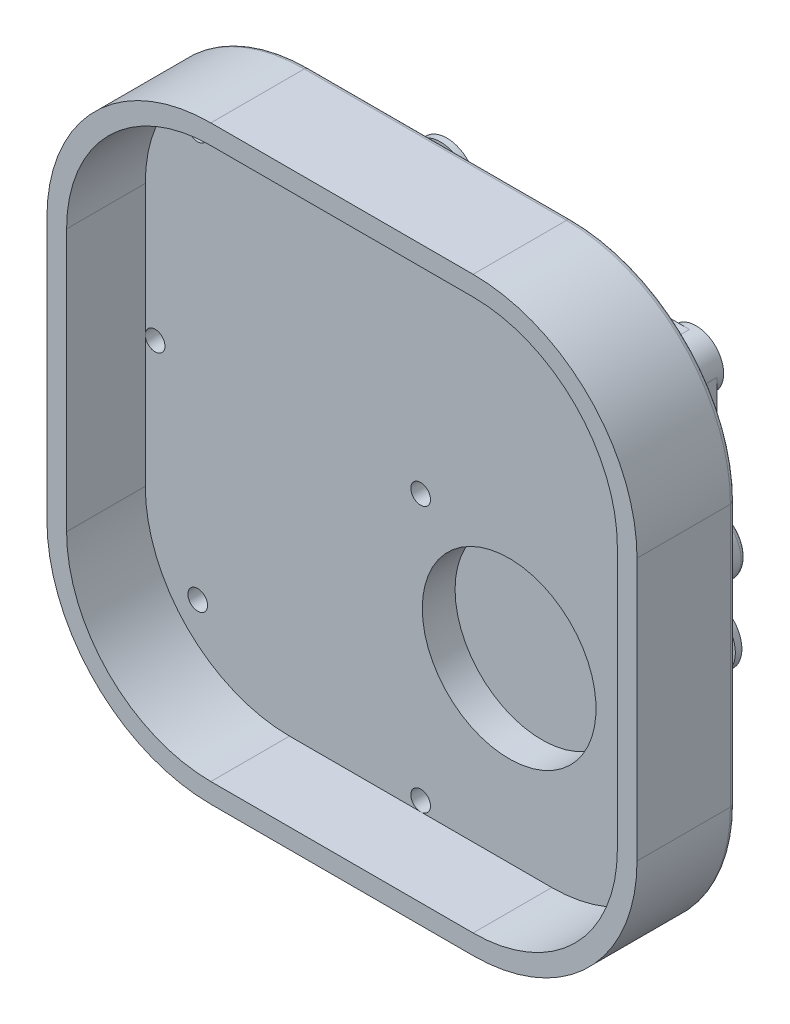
ISO-10303-21;
HEADER;
FILE_DESCRIPTION(('STEP AP214'),'2;1');
FILE_NAME('part.step','',(''),(''),'','','');
FILE_SCHEMA(('AUTOMOTIVE_DESIGN { 1 0 10303 214 1 1 1 1 }'));
ENDSEC;
DATA;
#1=APPLICATION_CONTEXT('core data for automotive mechanical design processes');
#2=APPLICATION_PROTOCOL_DEFINITION('international standard','automotive_design',2000,#1);
#3=PRODUCT_CONTEXT('',#1,'mechanical');
#4=PRODUCT('Part','Part','',(#3));
#5=PRODUCT_RELATED_PRODUCT_CATEGORY('part','',(#4));
#6=PRODUCT_DEFINITION_FORMATION('','',#4);
#7=PRODUCT_DEFINITION_CONTEXT('part definition',#1,'design');
#8=PRODUCT_DEFINITION('design','',#6,#7);
#9=PRODUCT_DEFINITION_SHAPE('','',#8);
#10=(LENGTH_UNIT() NAMED_UNIT(*) SI_UNIT(.MILLI.,.METRE.));
#11=(NAMED_UNIT(*) PLANE_ANGLE_UNIT() SI_UNIT($,.RADIAN.));
#12=(NAMED_UNIT(*) SI_UNIT($,.STERADIAN.) SOLID_ANGLE_UNIT());
#13=UNCERTAINTY_MEASURE_WITH_UNIT(LENGTH_MEASURE(1.E-05),#10,'distance_accuracy_value','');
#14=(GEOMETRIC_REPRESENTATION_CONTEXT(3) GLOBAL_UNCERTAINTY_ASSIGNED_CONTEXT((#13)) GLOBAL_UNIT_ASSIGNED_CONTEXT((#10,
#11,#12)) REPRESENTATION_CONTEXT('',''));
#15=CARTESIAN_POINT('',(0.,0.,0.));
#16=DIRECTION('',(0.,0.,1.));
#17=DIRECTION('',(1.,0.,0.));
#18=AXIS2_PLACEMENT_3D('',#15,#16,#17);
#19=CARTESIAN_POINT('',(100.,100.,0.));
#20=DIRECTION('',(0.,0.,-1.));
#21=DIRECTION('',(-1.,0.,0.));
#22=AXIS2_PLACEMENT_3D('',#19,#20,#21);
#23=PLANE('',#22);
#24=DIRECTION('',(-1.,0.,0.));
#25=VECTOR('',#24,1.);
#26=CARTESIAN_POINT('',(100.,2.99999999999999,0.));
#27=LINE('',#26,#25);
#28=CARTESIAN_POINT('',(260.,3.00000000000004,0.));
#29=VERTEX_POINT('',#28);
#30=CARTESIAN_POINT('',(189.949874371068,2.99999999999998,0.));
#31=VERTEX_POINT('',#30);
#32=EDGE_CURVE('E505',#29,#31,#27,.T.);
#33=ORIENTED_EDGE('',*,*,#32,.T.);
#34=CARTESIAN_POINT('',(180.000000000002,18.0000000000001,0.));
#35=DIRECTION('',(0.,0.,-1.));
#36=DIRECTION('',(0.,1.,0.));
#37=AXIS2_PLACEMENT_3D('',#34,#35,#36);
#38=CIRCLE('',#37,18.);
#39=CARTESIAN_POINT('',(170.050125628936,2.99999999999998,0.));
#40=VERTEX_POINT('',#39);
#41=EDGE_CURVE('E507',#40,#31,#38,.T.);
#42=ORIENTED_EDGE('',*,*,#41,.F.);
#43=CARTESIAN_POINT('',(100.,2.99999999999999,0.));
#44=VERTEX_POINT('',#43);
#45=EDGE_CURVE('E491',#40,#44,#27,.T.);
#46=ORIENTED_EDGE('',*,*,#45,.T.);
#47=CARTESIAN_POINT('',(100.,100.,0.));
#48=DIRECTION('',(0.,0.,-1.));
#49=DIRECTION('',(-1.,0.,0.));
#50=AXIS2_PLACEMENT_3D('',#47,#48,#49);
#51=CIRCLE('',#50,97.);
#52=CARTESIAN_POINT('',(3.00000000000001,100.000000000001,0.));
#53=VERTEX_POINT('',#52);
#54=EDGE_CURVE('E1015',#44,#53,#51,.T.);
#55=ORIENTED_EDGE('',*,*,#54,.T.);
#56=DIRECTION('',(0.,-1.,0.));
#57=VECTOR('',#56,1.);
#58=CARTESIAN_POINT('',(3.00000000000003,260.,0.));
#59=LINE('',#58,#57);
#60=CARTESIAN_POINT('',(3.00000000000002,170.050125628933,0.));
#61=VERTEX_POINT('',#60);
#62=EDGE_CURVE('E1018',#53,#61,#59,.F.);
#63=ORIENTED_EDGE('',*,*,#62,.T.);
#64=CARTESIAN_POINT('',(18.0000000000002,179.999999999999,0.));
#65=DIRECTION('',(0.,0.,-1.));
#66=DIRECTION('',(1.,0.,0.));
#67=AXIS2_PLACEMENT_3D('',#64,#65,#66);
#68=CIRCLE('',#67,18.);
#69=CARTESIAN_POINT('',(24.1460674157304,163.081789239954,0.));
#70=VERTEX_POINT('',#69);
#71=EDGE_CURVE('E524',#70,#61,#68,.T.);
#72=ORIENTED_EDGE('',*,*,#71,.F.);
#73=DIRECTION('',(0.,-1.,0.));
#74=VECTOR('',#73,1.);
#75=CARTESIAN_POINT('',(24.1460674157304,100.,0.));
#76=LINE('',#75,#74);
#77=CARTESIAN_POINT('',(24.1460674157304,56.,0.));
#78=VERTEX_POINT('',#77);
#79=EDGE_CURVE('E998',#70,#78,#76,.T.);
#80=ORIENTED_EDGE('',*,*,#79,.T.);
#81=CARTESIAN_POINT('',(44.,56.,0.));
#82=DIRECTION('',(0.,0.,-1.));
#83=DIRECTION('',(-1.,0.,0.));
#84=AXIS2_PLACEMENT_3D('',#81,#82,#83);
#85=CIRCLE('',#84,19.8539325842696);
#86=CARTESIAN_POINT('',(44.,36.1460674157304,0.));
#87=VERTEX_POINT('',#86);
#88=EDGE_CURVE('E1002',#78,#87,#85,.F.);
#89=ORIENTED_EDGE('',*,*,#88,.T.);
#90=DIRECTION('',(-1.,0.,0.));
#91=VECTOR('',#90,1.);
#92=CARTESIAN_POINT('',(100.,36.1460674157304,0.));
#93=LINE('',#92,#91);
#94=CARTESIAN_POINT('',(316.,36.1460674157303,0.));
#95=VERTEX_POINT('',#94);
#96=EDGE_CURVE('E1004',#87,#95,#93,.F.);
#97=ORIENTED_EDGE('',*,*,#96,.T.);
#98=CARTESIAN_POINT('',(316.,56.,0.));
#99=DIRECTION('',(0.,0.,-1.));
#100=DIRECTION('',(-1.,0.,0.));
#101=AXIS2_PLACEMENT_3D('',#98,#99,#100);
#102=CIRCLE('',#101,19.8539325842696);
#103=CARTESIAN_POINT('',(335.85393258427,56.,0.));
#104=VERTEX_POINT('',#103);
#105=EDGE_CURVE('E1006',#95,#104,#102,.F.);
#106=ORIENTED_EDGE('',*,*,#105,.T.);
#107=DIRECTION('',(0.,-1.,0.));
#108=VECTOR('',#107,1.);
#109=CARTESIAN_POINT('',(335.85393258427,100.,0.));
#110=LINE('',#109,#108);
#111=CARTESIAN_POINT('',(335.85393258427,163.081789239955,0.));
#112=VERTEX_POINT('',#111);
#113=EDGE_CURVE('E1009',#104,#112,#110,.F.);
#114=ORIENTED_EDGE('',*,*,#113,.T.);
#115=CARTESIAN_POINT('',(342.,180.,0.));
#116=DIRECTION('',(0.,0.,-1.));
#117=DIRECTION('',(-1.,0.,0.));
#118=AXIS2_PLACEMENT_3D('',#115,#116,#117);
#119=CIRCLE('',#118,18.);
#120=CARTESIAN_POINT('',(357.,170.050125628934,0.));
#121=VERTEX_POINT('',#120);
#122=EDGE_CURVE('E551',#121,#112,#119,.T.);
#123=ORIENTED_EDGE('',*,*,#122,.F.);
#124=DIRECTION('',(0.,1.,0.));
#125=VECTOR('',#124,1.);
#126=CARTESIAN_POINT('',(357.,100.000000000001,0.));
#127=LINE('',#126,#125);
#128=CARTESIAN_POINT('',(357.,100.000000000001,0.));
#129=VERTEX_POINT('',#128);
#130=EDGE_CURVE('E1030',#121,#129,#127,.F.);
#131=ORIENTED_EDGE('',*,*,#130,.T.);
#132=CARTESIAN_POINT('',(260.,100.,0.));
#133=DIRECTION('',(0.,0.,-1.));
#134=DIRECTION('',(-1.,0.,0.));
#135=AXIS2_PLACEMENT_3D('',#132,#133,#134);
#136=CIRCLE('',#135,96.9999999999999);
#137=EDGE_CURVE('E503',#129,#29,#136,.T.);
#138=ORIENTED_EDGE('',*,*,#137,.T.);
#139=EDGE_LOOP('',(#33,#42,#46,#55,#63,#72,#80,#89,#97,#106,#114,#123,#131,#138));
#140=FACE_BOUND('',#139,.T.);
#141=ADVANCED_FACE('F33',(#140),#23,.T.);
#142=CARTESIAN_POINT('',(24.1460674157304,304.,0.));
#143=VERTEX_POINT('',#142);
#144=CARTESIAN_POINT('',(24.1460674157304,196.918210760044,0.));
#145=VERTEX_POINT('',#144);
#146=EDGE_CURVE('E999',#143,#145,#76,.T.);
#147=ORIENTED_EDGE('',*,*,#146,.T.);
#148=CARTESIAN_POINT('',(3.00000000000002,189.949874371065,0.));
#149=VERTEX_POINT('',#148);
#150=EDGE_CURVE('E519',#149,#145,#68,.T.);
#151=ORIENTED_EDGE('',*,*,#150,.F.);
#152=CARTESIAN_POINT('',(3.00000000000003,260.,0.));
#153=VERTEX_POINT('',#152);
#154=EDGE_CURVE('E1017',#149,#153,#59,.F.);
#155=ORIENTED_EDGE('',*,*,#154,.T.);
#156=CARTESIAN_POINT('',(100.,260.,0.));
#157=DIRECTION('',(0.,0.,-1.));
#158=DIRECTION('',(-1.,0.,0.));
#159=AXIS2_PLACEMENT_3D('',#156,#157,#158);
#160=CIRCLE('',#159,97.);
#161=CARTESIAN_POINT('',(100.,357.,0.));
#162=VERTEX_POINT('',#161);
#163=EDGE_CURVE('E1021',#153,#162,#160,.T.);
#164=ORIENTED_EDGE('',*,*,#163,.T.);
#165=DIRECTION('',(1.,0.,0.));
#166=VECTOR('',#165,1.);
#167=CARTESIAN_POINT('',(100.,357.,0.));
#168=LINE('',#167,#166);
#169=CARTESIAN_POINT('',(170.050125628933,357.,0.));
#170=VERTEX_POINT('',#169);
#171=EDGE_CURVE('E1024',#162,#170,#168,.T.);
#172=ORIENTED_EDGE('',*,*,#171,.T.);
#173=CARTESIAN_POINT('',(179.999999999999,342.,0.));
#174=DIRECTION('',(0.,0.,-1.));
#175=DIRECTION('',(0.,-1.,0.));
#176=AXIS2_PLACEMENT_3D('',#173,#174,#175);
#177=CIRCLE('',#176,18.);
#178=CARTESIAN_POINT('',(189.949874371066,357.,0.));
#179=VERTEX_POINT('',#178);
#180=EDGE_CURVE('E538',#179,#170,#177,.T.);
#181=ORIENTED_EDGE('',*,*,#180,.F.);
#182=CARTESIAN_POINT('',(260.,357.,0.));
#183=VERTEX_POINT('',#182);
#184=EDGE_CURVE('E1023',#179,#183,#168,.T.);
#185=ORIENTED_EDGE('',*,*,#184,.T.);
#186=CARTESIAN_POINT('',(260.,260.,0.));
#187=DIRECTION('',(0.,0.,-1.));
#188=DIRECTION('',(-1.,0.,0.));
#189=AXIS2_PLACEMENT_3D('',#186,#187,#188);
#190=CIRCLE('',#189,97.);
#191=CARTESIAN_POINT('',(357.,260.,0.));
#192=VERTEX_POINT('',#191);
#193=EDGE_CURVE('E1027',#183,#192,#190,.T.);
#194=ORIENTED_EDGE('',*,*,#193,.T.);
#195=CARTESIAN_POINT('',(357.,189.949874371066,0.));
#196=VERTEX_POINT('',#195);
#197=EDGE_CURVE('E1031',#192,#196,#127,.F.);
#198=ORIENTED_EDGE('',*,*,#197,.T.);
#199=CARTESIAN_POINT('',(335.85393258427,196.918210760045,0.));
#200=VERTEX_POINT('',#199);
#201=EDGE_CURVE('E552',#200,#196,#119,.T.);
#202=ORIENTED_EDGE('',*,*,#201,.F.);
#203=CARTESIAN_POINT('',(335.85393258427,304.,0.));
#204=VERTEX_POINT('',#203);
#205=EDGE_CURVE('E1008',#200,#204,#110,.F.);
#206=ORIENTED_EDGE('',*,*,#205,.T.);
#207=CARTESIAN_POINT('',(316.,304.,0.));
#208=DIRECTION('',(0.,0.,-1.));
#209=DIRECTION('',(-1.,0.,0.));
#210=AXIS2_PLACEMENT_3D('',#207,#208,#209);
#211=CIRCLE('',#210,19.8539325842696);
#212=CARTESIAN_POINT('',(316.,323.85393258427,0.));
#213=VERTEX_POINT('',#212);
#214=EDGE_CURVE('E1012',#204,#213,#211,.F.);
#215=ORIENTED_EDGE('',*,*,#214,.T.);
#216=DIRECTION('',(-1.,0.,0.));
#217=VECTOR('',#216,1.);
#218=CARTESIAN_POINT('',(100.,323.85393258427,0.));
#219=LINE('',#218,#217);
#220=CARTESIAN_POINT('',(44.,323.85393258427,0.));
#221=VERTEX_POINT('',#220);
#222=EDGE_CURVE('E994',#213,#221,#219,.T.);
#223=ORIENTED_EDGE('',*,*,#222,.T.);
#224=CARTESIAN_POINT('',(44.,304.,0.));
#225=DIRECTION('',(0.,0.,-1.));
#226=DIRECTION('',(-1.,0.,0.));
#227=AXIS2_PLACEMENT_3D('',#224,#225,#226);
#228=CIRCLE('',#227,19.8539325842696);
#229=EDGE_CURVE('E996',#221,#143,#228,.F.);
#230=ORIENTED_EDGE('',*,*,#229,.T.);
#231=EDGE_LOOP('',(#147,#151,#155,#164,#172,#181,#185,#194,#198,#202,#206,#215,#223,#230));
#232=FACE_BOUND('',#231,.T.);
#233=ADVANCED_FACE('F1148',(#232),#23,.T.);
#234=CARTESIAN_POINT('',(27.1460674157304,304.,-16.));
#235=DIRECTION('',(-1.,0.,0.));
#236=DIRECTION('',(0.,0.,1.));
#237=AXIS2_PLACEMENT_3D('',#234,#235,#236);
#238=PLANE('',#237);
#239=DIRECTION('',(0.,-1.,0.));
#240=VECTOR('',#239,1.);
#241=CARTESIAN_POINT('',(27.1460674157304,100.,-3.));
#242=LINE('',#241,#240);
#243=CARTESIAN_POINT('',(27.1460674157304,56.,-3.));
#244=VERTEX_POINT('',#243);
#245=CARTESIAN_POINT('',(27.1460674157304,164.496792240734,-3.));
#246=VERTEX_POINT('',#245);
#247=EDGE_CURVE('E1066',#244,#246,#242,.F.);
#248=ORIENTED_EDGE('',*,*,#247,.T.);
#249=DIRECTION('',(0.,0.,1.));
#250=VECTOR('',#249,1.);
#251=CARTESIAN_POINT('',(27.1460674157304,164.496792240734,-4.));
#252=LINE('',#251,#250);
#253=CARTESIAN_POINT('',(27.1460674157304,164.496792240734,-4.));
#254=VERTEX_POINT('',#253);
#255=EDGE_CURVE('E536',#246,#254,#252,.F.);
#256=ORIENTED_EDGE('',*,*,#255,.T.);
#257=DIRECTION('',(0.,-1.,0.));
#258=VECTOR('',#257,1.);
#259=CARTESIAN_POINT('',(27.1460674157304,304.,-4.));
#260=LINE('',#259,#258);
#261=CARTESIAN_POINT('',(27.1460674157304,195.503207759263,-4.));
#262=VERTEX_POINT('',#261);
#263=EDGE_CURVE('E11',#262,#254,#260,.T.);
#264=ORIENTED_EDGE('',*,*,#263,.F.);
#265=DIRECTION('',(0.,0.,1.));
#266=VECTOR('',#265,1.);
#267=CARTESIAN_POINT('',(27.1460674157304,195.503207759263,-4.));
#268=LINE('',#267,#266);
#269=CARTESIAN_POINT('',(27.1460674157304,195.503207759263,-3.));
#270=VERTEX_POINT('',#269);
#271=EDGE_CURVE('E533',#262,#270,#268,.T.);
#272=ORIENTED_EDGE('',*,*,#271,.T.);
#273=CARTESIAN_POINT('',(27.1460674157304,304.,-3.));
#274=VERTEX_POINT('',#273);
#275=EDGE_CURVE('E1065',#270,#274,#242,.F.);
#276=ORIENTED_EDGE('',*,*,#275,.T.);
#277=DIRECTION('',(0.,0.,1.));
#278=VECTOR('',#277,1.);
#279=CARTESIAN_POINT('',(27.1460674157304,304.,-16.));
#280=LINE('',#279,#278);
#281=CARTESIAN_POINT('',(27.1460674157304,304.,-16.));
#282=VERTEX_POINT('',#281);
#283=EDGE_CURVE('E756',#282,#274,#280,.T.);
#284=ORIENTED_EDGE('',*,*,#283,.F.);
#285=DIRECTION('',(0.,-1.,0.));
#286=VECTOR('',#285,1.);
#287=CARTESIAN_POINT('',(27.1460674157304,304.,-16.));
#288=LINE('',#287,#286);
#289=CARTESIAN_POINT('',(27.1460674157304,56.,-16.));
#290=VERTEX_POINT('',#289);
#291=EDGE_CURVE('E753',#282,#290,#288,.T.);
#292=ORIENTED_EDGE('',*,*,#291,.T.);
#293=DIRECTION('',(0.,0.,1.));
#294=VECTOR('',#293,1.);
#295=CARTESIAN_POINT('',(27.1460674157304,56.,-16.));
#296=LINE('',#295,#294);
#297=EDGE_CURVE('E759',#290,#244,#296,.T.);
#298=ORIENTED_EDGE('',*,*,#297,.T.);
#299=EDGE_LOOP('',(#248,#256,#264,#272,#276,#284,#292,#298));
#300=FACE_BOUND('',#299,.T.);
#301=ADVANCED_FACE('F1154',(#300),#238,.T.);
#302=CARTESIAN_POINT('',(24.1460674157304,100.,-3.));
#303=DIRECTION('',(0.,1.,0.));
#304=DIRECTION('',(0.,0.,1.));
#305=AXIS2_PLACEMENT_3D('',#302,#303,#304);
#306=CYLINDRICAL_SURFACE('',#305,3.);
#307=CARTESIAN_POINT('',(24.1460674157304,163.081789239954,0.));
#308=CARTESIAN_POINT('',(23.9775669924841,163.020578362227,-4.32181105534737E-06));
#309=CARTESIAN_POINT('',(23.8080841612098,162.961881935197,-0.0142256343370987));
#310=CARTESIAN_POINT('',(23.4718698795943,162.850947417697,-0.0717664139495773));
#311=CARTESIAN_POINT('',(23.3051393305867,162.798711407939,-0.115095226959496));
#312=CARTESIAN_POINT('',(22.9793143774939,162.701578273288,-0.230772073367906));
#313=CARTESIAN_POINT('',(22.8202368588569,162.656696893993,-0.303181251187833));
#314=CARTESIAN_POINT('',(22.5156075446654,162.574897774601,-0.475674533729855));
#315=CARTESIAN_POINT('',(22.3700526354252,162.537978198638,-0.575752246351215));
#316=CARTESIAN_POINT('',(22.103307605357,162.473420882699,-0.796396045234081));
#317=CARTESIAN_POINT('',(21.9813672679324,162.44546668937,-0.915963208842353));
#318=CARTESIAN_POINT('',(21.7590012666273,162.396508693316,-1.17489064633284));
#319=CARTESIAN_POINT('',(21.6585726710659,162.375503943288,-1.31424821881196));
#320=CARTESIAN_POINT('',(21.4851288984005,162.340398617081,-1.60457395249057));
#321=CARTESIAN_POINT('',(21.411432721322,162.326123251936,-1.7551147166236));
#322=CARTESIAN_POINT('',(21.2900279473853,162.3031201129,-2.06672954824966));
#323=CARTESIAN_POINT('',(21.2423178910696,162.294392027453,-2.22780302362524));
#324=CARTESIAN_POINT('',(21.1746744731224,162.282138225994,-2.55453418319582));
#325=CARTESIAN_POINT('',(21.1545243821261,162.278571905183,-2.72014552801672));
#326=CARTESIAN_POINT('',(21.1419213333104,162.276332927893,-3.0524516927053));
#327=CARTESIAN_POINT('',(21.1494680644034,162.277660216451,-3.21914650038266));
#328=CARTESIAN_POINT('',(21.1920011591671,162.285272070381,-3.54869388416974));
#329=CARTESIAN_POINT('',(21.2269572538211,162.29155116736,-3.71155049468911));
#330=CARTESIAN_POINT('',(21.3231814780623,162.309357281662,-4.0289898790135));
#331=CARTESIAN_POINT('',(21.3844491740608,162.320884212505,-4.18357278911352));
#332=CARTESIAN_POINT('',(21.5313962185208,162.349650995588,-4.48016741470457));
#333=CARTESIAN_POINT('',(21.6170861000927,162.366893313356,-4.62217367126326));
#334=CARTESIAN_POINT('',(21.8101230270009,162.407596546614,-4.88959196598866));
#335=CARTESIAN_POINT('',(21.9174696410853,162.431057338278,-5.01500433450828));
#336=CARTESIAN_POINT('',(22.1509020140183,162.484738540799,-5.2464303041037));
#337=CARTESIAN_POINT('',(22.2770706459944,162.514989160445,-5.35235323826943));
#338=CARTESIAN_POINT('',(22.5437363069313,162.582383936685,-5.54150850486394));
#339=CARTESIAN_POINT('',(22.6842340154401,162.619528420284,-5.62473976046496));
#340=CARTESIAN_POINT('',(22.9779445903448,162.70133791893,-5.76815736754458));
#341=CARTESIAN_POINT('',(23.1313460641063,162.746130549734,-5.82788379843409));
#342=CARTESIAN_POINT('',(23.443930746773,162.842192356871,-5.92123774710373));
#343=CARTESIAN_POINT('',(23.6031150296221,162.893462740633,-5.95486039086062));
#344=CARTESIAN_POINT('',(23.9298960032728,163.003902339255,-5.99692758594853));
#345=CARTESIAN_POINT('',(24.0975576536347,163.063317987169,-6.00421449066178));
#346=CARTESIAN_POINT('',(24.4300805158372,163.186744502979,-5.9911619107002));
#347=CARTESIAN_POINT('',(24.5949408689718,163.250756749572,-5.97081410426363));
#348=CARTESIAN_POINT('',(24.9279916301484,163.38563418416,-5.90159942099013));
#349=CARTESIAN_POINT('',(25.0957606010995,163.456678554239,-5.85105145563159));
#350=CARTESIAN_POINT('',(25.4198112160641,163.599457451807,-5.72176901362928));
#351=CARTESIAN_POINT('',(25.5760882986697,163.671192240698,-5.64302341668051));
#352=CARTESIAN_POINT('',(25.8795742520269,163.815386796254,-5.45522602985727));
#353=CARTESIAN_POINT('',(26.0261314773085,163.887751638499,-5.34504552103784));
#354=CARTESIAN_POINT('',(26.2984263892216,164.026288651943,-5.0978774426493));
#355=CARTESIAN_POINT('',(26.4241627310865,164.092460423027,-4.96088814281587));
#356=CARTESIAN_POINT('',(26.5913053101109,164.182499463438,-4.74038426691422));
#357=CARTESIAN_POINT('',(26.6426629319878,164.210528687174,-4.66591484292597));
#358=CARTESIAN_POINT('',(26.7388405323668,164.263555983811,-4.51187164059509));
#359=CARTESIAN_POINT('',(26.7836642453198,164.288555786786,-4.4323008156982));
#360=CARTESIAN_POINT('',(26.866176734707,164.334970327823,-4.26862214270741));
#361=CARTESIAN_POINT('',(26.9038707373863,164.356387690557,-4.18451767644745));
#362=CARTESIAN_POINT('',(26.971602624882,164.395133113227,-4.01237350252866));
#363=CARTESIAN_POINT('',(27.0016418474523,164.412461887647,-3.92433448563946));
#364=CARTESIAN_POINT('',(27.0503186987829,164.4406805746,-3.75630300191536));
#365=CARTESIAN_POINT('',(27.0699108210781,164.452103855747,-3.67667553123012));
#366=CARTESIAN_POINT('',(27.1025597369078,164.471195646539,-3.51565485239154));
#367=CARTESIAN_POINT('',(27.1156174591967,164.47886468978,-3.43426189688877));
#368=CARTESIAN_POINT('',(27.1349889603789,164.49025769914,-3.27044821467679));
#369=CARTESIAN_POINT('',(27.1413069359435,164.493984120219,-3.18802815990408));
#370=CARTESIAN_POINT('',(27.1471195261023,164.497412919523,-3.0228904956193));
#371=CARTESIAN_POINT('',(27.1466146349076,164.497115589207,-2.94017290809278));
#372=CARTESIAN_POINT('',(27.1356834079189,164.490666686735,-2.71042494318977));
#373=CARTESIAN_POINT('',(27.1177934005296,164.480110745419,-2.563784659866));
#374=CARTESIAN_POINT('',(27.0611229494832,164.446958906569,-2.2761276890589));
#375=CARTESIAN_POINT('',(27.0223414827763,164.424362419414,-2.1351112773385));
#376=CARTESIAN_POINT('',(26.9251342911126,164.368457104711,-1.86061304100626));
#377=CARTESIAN_POINT('',(26.8665089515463,164.335039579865,-1.72722455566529));
#378=CARTESIAN_POINT('',(26.7319158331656,164.259619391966,-1.47218855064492));
#379=CARTESIAN_POINT('',(26.6559425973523,164.217614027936,-1.35054474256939));
#380=CARTESIAN_POINT('',(26.4799698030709,164.122306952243,-1.10854466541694));
#381=CARTESIAN_POINT('',(26.3782710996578,164.068278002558,-0.989712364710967));
#382=CARTESIAN_POINT('',(26.1592128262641,163.954986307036,-0.770357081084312));
#383=CARTESIAN_POINT('',(26.0418426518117,163.895720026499,-0.669846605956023));
#384=CARTESIAN_POINT('',(25.7789483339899,163.76695096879,-0.47742892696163));
#385=CARTESIAN_POINT('',(25.6317363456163,163.697081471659,-0.388067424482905));
#386=CARTESIAN_POINT('',(25.3245247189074,163.556769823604,-0.235834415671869));
#387=CARTESIAN_POINT('',(25.1645293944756,163.486327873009,-0.172954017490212));
#388=CARTESIAN_POINT('',(24.8624541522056,163.358814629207,-0.0832587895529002));
#389=CARTESIAN_POINT('',(24.7217407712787,163.301445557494,-0.052219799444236));
#390=CARTESIAN_POINT('',(24.4362845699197,163.189356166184,-0.0105894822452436));
#391=CARTESIAN_POINT('',(24.2915421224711,163.134635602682,3.7312321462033E-06));
#392=CARTESIAN_POINT('',(24.1460674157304,163.081789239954,0.));
#393=B_SPLINE_CURVE_WITH_KNOTS('',3,(#307,#308,#309,#310,#311,#312,#313,#314,#315,#316,#317,
#318,#319,#320,#321,#322,#323,#324,#325,#326,#327,#328,#329,#330,#331,#332,#333,#334,#335,#336,
#337,#338,#339,#340,#341,#342,#343,#344,#345,#346,#347,#348,#349,#350,#351,#352,#353,#354,#355,
#356,#357,#358,#359,#360,#361,#362,#363,#364,#365,#366,#367,#368,#369,#370,#371,#372,#373,#374,
#375,#376,#377,#378,#379,#380,#381,#382,#383,#384,#385,#386,#387,#388,#389,#390,#391,#392),
.UNSPECIFIED.,.T.,.F.,(4,2,2,2,2,2,2,2,2,2,2,2,2,2,2,2,2,2,2,2,2,2,2,2,2,2,2,2,2,2,2,2,2,2,2,2,
2,2,2,2,2,2,4),(0.,0.537309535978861,1.07479167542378,1.61340989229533,2.15190377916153,
2.66849472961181,3.18501523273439,3.68725869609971,4.18947394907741,4.68771666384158,
5.18595378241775,5.68364145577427,6.18132092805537,6.67921537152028,7.17709990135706,
7.67724510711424,8.17741404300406,8.68693376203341,9.19654859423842,9.72830949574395,
10.2602305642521,10.8249491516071,11.3898906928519,11.9784350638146,12.5670174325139,
12.8507970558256,13.1344138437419,13.4178219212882,13.7011804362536,13.9492166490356,
14.1972175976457,14.4450640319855,14.6928925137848,15.1348989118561,15.5769269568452,
16.0235405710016,16.4702948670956,16.9647454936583,17.4595324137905,18.0146848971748,
18.5696508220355,19.0335793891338,19.4974651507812),.UNSPECIFIED.);
#394=EDGE_CURVE('E41',#246,#70,#393,.T.);
#395=ORIENTED_EDGE('',*,*,#394,.F.);
#396=ORIENTED_EDGE('',*,*,#247,.F.);
#397=CARTESIAN_POINT('',(24.1460674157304,56.,-3.));
#398=DIRECTION('',(0.,-1.,0.));
#399=DIRECTION('',(0.,0.,-1.));
#400=AXIS2_PLACEMENT_3D('',#397,#398,#399);
#401=CIRCLE('',#400,3.);
#402=EDGE_CURVE('E615',#244,#78,#401,.T.);
#403=ORIENTED_EDGE('',*,*,#402,.T.);
#404=ORIENTED_EDGE('',*,*,#79,.F.);
#405=EDGE_LOOP('',(#395,#396,#403,#404));
#406=FACE_BOUND('',#405,.T.);
#407=ADVANCED_FACE('F1242',(#406),#306,.F.);
#408=CARTESIAN_POINT('',(24.1460674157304,196.918210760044,0.));
#409=CARTESIAN_POINT('',(24.3281268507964,196.852066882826,-7.43134057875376E-06));
#410=CARTESIAN_POINT('',(24.509253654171,196.782908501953,-0.0166187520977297));
#411=CARTESIAN_POINT('',(24.8643754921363,196.640826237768,-0.0816551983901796));
#412=CARTESIAN_POINT('',(25.0383578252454,196.567896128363,-0.130134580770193));
#413=CARTESIAN_POINT('',(25.3742633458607,196.421137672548,-0.257064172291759));
#414=CARTESIAN_POINT('',(25.5362055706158,196.347310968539,-0.33546581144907));
#415=CARTESIAN_POINT('',(25.8441941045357,196.201779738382,-0.520351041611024));
#416=CARTESIAN_POINT('',(25.9902421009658,196.130074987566,-0.626831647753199));
#417=CARTESIAN_POINT('',(26.2637602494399,195.991684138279,-0.867215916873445));
#418=CARTESIAN_POINT('',(26.3910389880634,195.925052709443,-1.00137256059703));
#419=CARTESIAN_POINT('',(26.5630587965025,195.832823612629,-1.22044678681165));
#420=CARTESIAN_POINT('',(26.6172706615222,195.803354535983,-1.29648584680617));
#421=CARTESIAN_POINT('',(26.7188001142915,195.747567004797,-1.45409725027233));
#422=CARTESIAN_POINT('',(26.7661219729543,195.721246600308,-1.53566611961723));
#423=CARTESIAN_POINT('',(26.849638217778,195.674374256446,-1.69683071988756));
#424=CARTESIAN_POINT('',(26.8864292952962,195.653525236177,-1.77603141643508));
#425=CARTESIAN_POINT('',(26.9531883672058,195.61543767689,-1.93804770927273));
#426=CARTESIAN_POINT('',(26.9831603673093,195.598197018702,-2.02086114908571));
#427=CARTESIAN_POINT('',(27.0358340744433,195.567743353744,-2.18942406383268));
#428=CARTESIAN_POINT('',(27.058541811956,195.554527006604,-2.27517103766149));
#429=CARTESIAN_POINT('',(27.0963446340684,195.532449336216,-2.44884169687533));
#430=CARTESIAN_POINT('',(27.1114408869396,195.523587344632,-2.5367650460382));
#431=CARTESIAN_POINT('',(27.1418750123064,195.505699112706,-2.77875819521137));
#432=CARTESIAN_POINT('',(27.1493466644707,195.501274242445,-2.9342668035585));
#433=CARTESIAN_POINT('',(27.1401334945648,195.506707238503,-3.24419608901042));
#434=CARTESIAN_POINT('',(27.1234554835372,195.516561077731,-3.39861706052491));
#435=CARTESIAN_POINT('',(27.068604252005,195.548676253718,-3.69269712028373));
#436=CARTESIAN_POINT('',(27.0317518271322,195.570174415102,-3.83269041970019));
#437=CARTESIAN_POINT('',(26.9391680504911,195.623511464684,-4.1041628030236));
#438=CARTESIAN_POINT('',(26.8834331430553,195.655352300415,-4.23564027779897));
#439=CARTESIAN_POINT('',(26.751072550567,195.72974332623,-4.49550482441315));
#440=CARTESIAN_POINT('',(26.6733504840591,195.772842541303,-4.62317327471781));
#441=CARTESIAN_POINT('',(26.5014131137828,195.866176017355,-4.86393675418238));
#442=CARTESIAN_POINT('',(26.4071902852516,195.916413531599,-4.97702509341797));
#443=CARTESIAN_POINT('',(26.1920162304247,196.028328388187,-5.20023015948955));
#444=CARTESIAN_POINT('',(26.0691978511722,196.090651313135,-5.30822454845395));
#445=CARTESIAN_POINT('',(25.8088424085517,196.218601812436,-5.50231412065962));
#446=CARTESIAN_POINT('',(25.6712977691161,196.284231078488,-5.58839795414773));
#447=CARTESIAN_POINT('',(25.3699850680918,196.422955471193,-5.74474804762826));
#448=CARTESIAN_POINT('',(25.2049710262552,196.496137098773,-5.81254970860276));
#449=CARTESIAN_POINT('',(24.8647581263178,196.640590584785,-5.91808362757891));
#450=CARTESIAN_POINT('',(24.6895572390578,196.711862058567,-5.95580987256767));
#451=CARTESIAN_POINT('',(24.3301494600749,196.851320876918,-5.99991424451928));
#452=CARTESIAN_POINT('',(24.1458353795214,196.9194255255,-6.00569240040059));
#453=CARTESIAN_POINT('',(23.7769386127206,197.04890473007,-5.98292785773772));
#454=CARTESIAN_POINT('',(23.5923560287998,197.110281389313,-5.95439591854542));
#455=CARTESIAN_POINT('',(23.2384637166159,197.221823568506,-5.86493796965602));
#456=CARTESIAN_POINT('',(23.0688530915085,197.272398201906,-5.80571694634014));
#457=CARTESIAN_POINT('',(22.7411229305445,197.365216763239,-5.65678135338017));
#458=CARTESIAN_POINT('',(22.5829990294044,197.407463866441,-5.56707844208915));
#459=CARTESIAN_POINT('',(22.2933791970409,197.481072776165,-5.36574304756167));
#460=CARTESIAN_POINT('',(22.1608468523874,197.512941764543,-5.25578423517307));
#461=CARTESIAN_POINT('',(21.9158228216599,197.569353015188,-5.01385901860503));
#462=CARTESIAN_POINT('',(21.8033270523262,197.593896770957,-4.88189710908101));
#463=CARTESIAN_POINT('',(21.6058663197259,197.635407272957,-4.6047801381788));
#464=CARTESIAN_POINT('',(21.5200775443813,197.652608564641,-4.46024625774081));
#465=CARTESIAN_POINT('',(21.3736687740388,197.681175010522,-4.15841780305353));
#466=CARTESIAN_POINT('',(21.313046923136,197.692540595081,-4.00112417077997));
#467=CARTESIAN_POINT('',(21.2194659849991,197.709807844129,-3.68017258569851));
#468=CARTESIAN_POINT('',(21.1862017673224,197.715769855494,-3.51660674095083));
#469=CARTESIAN_POINT('',(21.1472273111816,197.722735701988,-3.18612062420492));
#470=CARTESIAN_POINT('',(21.1415166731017,197.723739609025,-3.01920040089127));
#471=CARTESIAN_POINT('',(21.1578114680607,197.720843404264,-2.68708533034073));
#472=CARTESIAN_POINT('',(21.1797635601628,197.716952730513,-2.52188777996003));
#473=CARTESIAN_POINT('',(21.2506103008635,197.704090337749,-2.19758173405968));
#474=CARTESIAN_POINT('',(21.2995046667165,197.695118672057,-2.03847317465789));
#475=CARTESIAN_POINT('',(21.4227113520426,197.671699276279,-1.7308308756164));
#476=CARTESIAN_POINT('',(21.4970269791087,197.657250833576,-1.58229851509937));
#477=CARTESIAN_POINT('',(21.6687072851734,197.622378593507,-1.30000726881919));
#478=CARTESIAN_POINT('',(21.7660706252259,197.60195514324,-1.16624752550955));
#479=CARTESIAN_POINT('',(21.9810269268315,197.554587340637,-0.916784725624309));
#480=CARTESIAN_POINT('',(22.0986761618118,197.527624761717,-0.801133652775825));
#481=CARTESIAN_POINT('',(22.3502533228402,197.466883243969,-0.591288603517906));
#482=CARTESIAN_POINT('',(22.4841850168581,197.433102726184,-0.497099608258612));
#483=CARTESIAN_POINT('',(22.76611861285,197.358158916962,-0.331124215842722));
#484=CARTESIAN_POINT('',(22.9142966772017,197.316895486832,-0.259683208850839));
#485=CARTESIAN_POINT('',(23.2184114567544,197.227687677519,-0.142381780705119));
#486=CARTESIAN_POINT('',(23.3743415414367,197.179748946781,-0.0964998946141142));
#487=CARTESIAN_POINT('',(23.633578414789,197.096030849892,-0.0422694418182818));
#488=CARTESIAN_POINT('',(23.735935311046,197.06196888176,-0.0263805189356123));
#489=CARTESIAN_POINT('',(23.9409822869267,196.99165934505,-0.00524384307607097));
#490=CARTESIAN_POINT('',(24.0436723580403,196.955411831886,4.1795831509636E-06));
#491=CARTESIAN_POINT('',(24.1460674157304,196.918210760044,0.));
#492=B_SPLINE_CURVE_WITH_KNOTS('',3,(#408,#409,#410,#411,#412,#413,#414,#415,#416,#417,#418,
#419,#420,#421,#422,#423,#424,#425,#426,#427,#428,#429,#430,#431,#432,#433,#434,#435,#436,#437,
#438,#439,#440,#441,#442,#443,#444,#445,#446,#447,#448,#449,#450,#451,#452,#453,#454,#455,#456,
#457,#458,#459,#460,#461,#462,#463,#464,#465,#466,#467,#468,#469,#470,#471,#472,#473,#474,#475,
#476,#477,#478,#479,#480,#481,#482,#483,#484,#485,#486,#487,#488,#489,#490,#491),.UNSPECIFIED.,
.T.,.F.,(4,2,2,2,2,2,2,2,2,2,2,2,2,2,2,2,2,2,2,2,2,2,2,2,2,2,2,2,2,2,2,2,2,2,2,2,2,2,2,2,2,4),
(0.,0.580696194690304,1.16238362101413,1.74313083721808,2.32381634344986,2.91006573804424,
3.20347445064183,3.49670050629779,3.76566811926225,4.03447732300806,4.30306279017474,
4.57160702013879,5.03616155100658,5.50058508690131,5.93771607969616,6.37492943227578,
6.839733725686,7.3047505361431,7.82765409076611,8.35082796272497,8.92666709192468,
9.50262132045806,10.0893558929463,10.6759065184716,11.2328974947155,11.7896756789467,
12.3124534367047,12.8351245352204,13.3395542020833,13.8439466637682,14.342634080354,
14.8413142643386,15.339034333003,15.8367491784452,16.3345288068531,16.8322795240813,
17.3314339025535,17.8307040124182,18.3372284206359,18.8433267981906,19.1699340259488,
19.4965329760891),.UNSPECIFIED.);
#493=EDGE_CURVE('E1255',#145,#270,#492,.T.);
#494=ORIENTED_EDGE('',*,*,#493,.F.);
#495=ORIENTED_EDGE('',*,*,#146,.F.);
#496=CARTESIAN_POINT('',(24.1460674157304,304.,-3.));
#497=DIRECTION('',(0.,-1.,0.));
#498=DIRECTION('',(0.,0.,-1.));
#499=AXIS2_PLACEMENT_3D('',#496,#497,#498);
#500=CIRCLE('',#499,3.);
#501=EDGE_CURVE('E609',#274,#143,#500,.T.);
#502=ORIENTED_EDGE('',*,*,#501,.F.);
#503=ORIENTED_EDGE('',*,*,#275,.F.);
#504=EDGE_LOOP('',(#494,#495,#502,#503));
#505=FACE_BOUND('',#504,.T.);
#506=ADVANCED_FACE('F1365',(#505),#306,.F.);
#507=CARTESIAN_POINT('',(332.85393258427,304.,-16.));
#508=DIRECTION('',(-1.,0.,0.));
#509=DIRECTION('',(0.,0.,1.));
#510=AXIS2_PLACEMENT_3D('',#507,#508,#509);
#511=PLANE('',#510);
#512=DIRECTION('',(0.,0.,1.));
#513=VECTOR('',#512,1.);
#514=CARTESIAN_POINT('',(332.85393258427,164.496792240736,-4.));
#515=LINE('',#514,#513);
#516=CARTESIAN_POINT('',(332.85393258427,164.496792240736,-3.));
#517=VERTEX_POINT('',#516);
#518=CARTESIAN_POINT('',(332.85393258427,164.496792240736,-4.));
#519=VERTEX_POINT('',#518);
#520=EDGE_CURVE('E561',#517,#519,#515,.F.);
#521=ORIENTED_EDGE('',*,*,#520,.F.);
#522=DIRECTION('',(0.,-1.,0.));
#523=VECTOR('',#522,1.);
#524=CARTESIAN_POINT('',(332.85393258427,304.,-3.));
#525=LINE('',#524,#523);
#526=CARTESIAN_POINT('',(332.85393258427,56.,-3.));
#527=VERTEX_POINT('',#526);
#528=EDGE_CURVE('E1055',#517,#527,#525,.T.);
#529=ORIENTED_EDGE('',*,*,#528,.T.);
#530=DIRECTION('',(0.,0.,1.));
#531=VECTOR('',#530,1.);
#532=CARTESIAN_POINT('',(332.85393258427,56.,-16.));
#533=LINE('',#532,#531);
#534=CARTESIAN_POINT('',(332.85393258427,56.,-16.));
#535=VERTEX_POINT('',#534);
#536=EDGE_CURVE('E768',#535,#527,#533,.T.);
#537=ORIENTED_EDGE('',*,*,#536,.F.);
#538=DIRECTION('',(0.,-1.,0.));
#539=VECTOR('',#538,1.);
#540=CARTESIAN_POINT('',(332.85393258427,304.,-16.));
#541=LINE('',#540,#539);
#542=CARTESIAN_POINT('',(332.85393258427,304.,-16.));
#543=VERTEX_POINT('',#542);
#544=EDGE_CURVE('E747',#543,#535,#541,.T.);
#545=ORIENTED_EDGE('',*,*,#544,.F.);
#546=DIRECTION('',(0.,0.,1.));
#547=VECTOR('',#546,1.);
#548=CARTESIAN_POINT('',(332.85393258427,304.,-16.));
#549=LINE('',#548,#547);
#550=CARTESIAN_POINT('',(332.85393258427,304.,-3.));
#551=VERTEX_POINT('',#550);
#552=EDGE_CURVE('E771',#543,#551,#549,.T.);
#553=ORIENTED_EDGE('',*,*,#552,.T.);
#554=CARTESIAN_POINT('',(332.85393258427,195.503207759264,-3.));
#555=VERTEX_POINT('',#554);
#556=EDGE_CURVE('E1056',#551,#555,#525,.T.);
#557=ORIENTED_EDGE('',*,*,#556,.T.);
#558=DIRECTION('',(0.,0.,1.));
#559=VECTOR('',#558,1.);
#560=CARTESIAN_POINT('',(332.85393258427,195.503207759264,-4.));
#561=LINE('',#560,#559);
#562=CARTESIAN_POINT('',(332.85393258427,195.503207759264,-4.));
#563=VERTEX_POINT('',#562);
#564=EDGE_CURVE('E564',#563,#555,#561,.T.);
#565=ORIENTED_EDGE('',*,*,#564,.F.);
#566=DIRECTION('',(0.,-1.,0.));
#567=VECTOR('',#566,1.);
#568=CARTESIAN_POINT('',(332.85393258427,304.,-4.));
#569=LINE('',#568,#567);
#570=EDGE_CURVE('E1259',#563,#519,#569,.T.);
#571=ORIENTED_EDGE('',*,*,#570,.T.);
#572=EDGE_LOOP('',(#521,#529,#537,#545,#553,#557,#565,#571));
#573=FACE_BOUND('',#572,.T.);
#574=ADVANCED_FACE('F1566',(#573),#511,.F.);
#575=CARTESIAN_POINT('',(335.85393258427,304.,-3.));
#576=DIRECTION('',(0.,-1.,0.));
#577=DIRECTION('',(0.,0.,-1.));
#578=AXIS2_PLACEMENT_3D('',#575,#576,#577);
#579=CYLINDRICAL_SURFACE('',#578,3.);
#580=CARTESIAN_POINT('',(335.85393258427,196.918210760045,-6.));
#581=CARTESIAN_POINT('',(335.671873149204,196.852066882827,-5.99999256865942));
#582=CARTESIAN_POINT('',(335.490746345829,196.782908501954,-5.98338124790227));
#583=CARTESIAN_POINT('',(335.135624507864,196.64082623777,-5.91834480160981));
#584=CARTESIAN_POINT('',(334.961642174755,196.567896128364,-5.86986541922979));
#585=CARTESIAN_POINT('',(334.625736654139,196.421137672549,-5.74293582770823));
#586=CARTESIAN_POINT('',(334.463794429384,196.34731096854,-5.66453418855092));
#587=CARTESIAN_POINT('',(334.155805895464,196.201779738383,-5.47964895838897));
#588=CARTESIAN_POINT('',(334.009757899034,196.130074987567,-5.37316835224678));
#589=CARTESIAN_POINT('',(333.73623975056,195.99168413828,-5.13278408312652));
#590=CARTESIAN_POINT('',(333.608961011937,195.925052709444,-4.99862743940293));
#591=CARTESIAN_POINT('',(333.436941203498,195.83282361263,-4.77955321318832));
#592=CARTESIAN_POINT('',(333.382729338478,195.803354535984,-4.70351415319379));
#593=CARTESIAN_POINT('',(333.281199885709,195.747567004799,-4.54590274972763));
#594=CARTESIAN_POINT('',(333.233878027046,195.721246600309,-4.46433388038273));
#595=CARTESIAN_POINT('',(333.150361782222,195.674374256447,-4.3031692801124));
#596=CARTESIAN_POINT('',(333.113570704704,195.653525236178,-4.22396858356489));
#597=CARTESIAN_POINT('',(333.046811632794,195.615437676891,-4.06195229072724));
#598=CARTESIAN_POINT('',(333.016839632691,195.598197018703,-3.97913885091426));
#599=CARTESIAN_POINT('',(332.964165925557,195.567743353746,-3.81057593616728));
#600=CARTESIAN_POINT('',(332.941458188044,195.554527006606,-3.72482896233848));
#601=CARTESIAN_POINT('',(332.903655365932,195.532449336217,-3.55115830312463));
#602=CARTESIAN_POINT('',(332.888559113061,195.523587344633,-3.46323495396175));
#603=CARTESIAN_POINT('',(332.858124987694,195.505699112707,-3.22124180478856));
#604=CARTESIAN_POINT('',(332.850653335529,195.501274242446,-3.06573319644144));
#605=CARTESIAN_POINT('',(332.859866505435,195.506707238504,-2.75580391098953));
#606=CARTESIAN_POINT('',(332.876544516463,195.516561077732,-2.60138293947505));
#607=CARTESIAN_POINT('',(332.931395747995,195.548676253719,-2.30730287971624));
#608=CARTESIAN_POINT('',(332.968248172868,195.570174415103,-2.16730958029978));
#609=CARTESIAN_POINT('',(333.060831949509,195.623511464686,-1.89583719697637));
#610=CARTESIAN_POINT('',(333.116566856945,195.655352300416,-1.76435972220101));
#611=CARTESIAN_POINT('',(333.248927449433,195.729743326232,-1.50449517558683));
#612=CARTESIAN_POINT('',(333.326649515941,195.772842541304,-1.37682672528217));
#613=CARTESIAN_POINT('',(333.498586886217,195.866176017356,-1.1360632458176));
#614=CARTESIAN_POINT('',(333.592809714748,195.9164135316,-1.02297490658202));
#615=CARTESIAN_POINT('',(333.807983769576,196.028328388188,-0.799769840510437));
#616=CARTESIAN_POINT('',(333.930802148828,196.090651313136,-0.691775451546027));
#617=CARTESIAN_POINT('',(334.191157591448,196.218601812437,-0.497685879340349));
#618=CARTESIAN_POINT('',(334.328702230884,196.28423107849,-0.411602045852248));
#619=CARTESIAN_POINT('',(334.630014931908,196.422955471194,-0.255251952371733));
#620=CARTESIAN_POINT('',(334.795028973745,196.496137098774,-0.187450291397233));
#621=CARTESIAN_POINT('',(335.135241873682,196.640590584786,-0.081916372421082));
#622=CARTESIAN_POINT('',(335.310442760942,196.711862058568,-0.044190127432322));
#623=CARTESIAN_POINT('',(335.669850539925,196.851320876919,-8.57554807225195E-05));
#624=CARTESIAN_POINT('',(335.854164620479,196.919425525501,0.00569240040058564));
#625=CARTESIAN_POINT('',(336.223061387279,197.048904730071,-0.017072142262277));
#626=CARTESIAN_POINT('',(336.4076439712,197.110281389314,-0.0456040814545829));
#627=CARTESIAN_POINT('',(336.761536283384,197.221823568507,-0.135062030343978));
#628=CARTESIAN_POINT('',(336.931146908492,197.272398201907,-0.194283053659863));
#629=CARTESIAN_POINT('',(337.258877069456,197.36521676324,-0.343218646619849));
#630=CARTESIAN_POINT('',(337.417000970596,197.407463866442,-0.432921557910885));
#631=CARTESIAN_POINT('',(337.706620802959,197.481072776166,-0.634256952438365));
#632=CARTESIAN_POINT('',(337.839153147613,197.512941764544,-0.744215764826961));
#633=CARTESIAN_POINT('',(338.08417717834,197.569353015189,-0.986140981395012));
#634=CARTESIAN_POINT('',(338.196672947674,197.593896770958,-1.11810289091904));
#635=CARTESIAN_POINT('',(338.394133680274,197.635407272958,-1.39521986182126));
#636=CARTESIAN_POINT('',(338.479922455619,197.652608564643,-1.53975374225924));
#637=CARTESIAN_POINT('',(338.626331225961,197.681175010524,-1.84158219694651));
#638=CARTESIAN_POINT('',(338.686953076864,197.692540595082,-1.99887582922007));
#639=CARTESIAN_POINT('',(338.780534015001,197.70980784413,-2.31982741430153));
#640=CARTESIAN_POINT('',(338.813798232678,197.715769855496,-2.48339325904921));
#641=CARTESIAN_POINT('',(338.852772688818,197.72273570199,-2.81387937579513));
#642=CARTESIAN_POINT('',(338.858483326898,197.723739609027,-2.98079959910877));
#643=CARTESIAN_POINT('',(338.842188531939,197.720843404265,-3.31291466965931));
#644=CARTESIAN_POINT('',(338.820236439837,197.716952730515,-3.47811222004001));
#645=CARTESIAN_POINT('',(338.749389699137,197.70409033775,-3.80241826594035));
#646=CARTESIAN_POINT('',(338.700495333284,197.695118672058,-3.96152682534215));
#647=CARTESIAN_POINT('',(338.577288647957,197.67169927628,-4.26916912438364));
#648=CARTESIAN_POINT('',(338.502973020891,197.657250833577,-4.41770148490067));
#649=CARTESIAN_POINT('',(338.331292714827,197.622378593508,-4.69999273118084));
#650=CARTESIAN_POINT('',(338.233929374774,197.601955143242,-4.83375247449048));
#651=CARTESIAN_POINT('',(338.018973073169,197.554587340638,-5.0832152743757));
#652=CARTESIAN_POINT('',(337.901323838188,197.527624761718,-5.19886634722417));
#653=CARTESIAN_POINT('',(337.64974667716,197.46688324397,-5.40871139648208));
#654=CARTESIAN_POINT('',(337.515814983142,197.433102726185,-5.50290039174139));
#655=CARTESIAN_POINT('',(337.23388138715,197.358158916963,-5.66887578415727));
#656=CARTESIAN_POINT('',(337.085703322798,197.316895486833,-5.74031679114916));
#657=CARTESIAN_POINT('',(336.781588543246,197.22768767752,-5.85761821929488));
#658=CARTESIAN_POINT('',(336.625658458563,197.179748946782,-5.90350010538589));
#659=CARTESIAN_POINT('',(336.366421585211,197.096030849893,-5.95773055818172));
#660=CARTESIAN_POINT('',(336.264064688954,197.061968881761,-5.97361948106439));
#661=CARTESIAN_POINT('',(336.059017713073,196.991659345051,-5.99475615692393));
#662=CARTESIAN_POINT('',(335.95632764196,196.955411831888,-6.00000417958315));
#663=CARTESIAN_POINT('',(335.85393258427,196.918210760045,-6.));
#664=B_SPLINE_CURVE_WITH_KNOTS('',3,(#580,#581,#582,#583,#584,#585,#586,#587,#588,#589,#590,
#591,#592,#593,#594,#595,#596,#597,#598,#599,#600,#601,#602,#603,#604,#605,#606,#607,#608,#609,
#610,#611,#612,#613,#614,#615,#616,#617,#618,#619,#620,#621,#622,#623,#624,#625,#626,#627,#628,
#629,#630,#631,#632,#633,#634,#635,#636,#637,#638,#639,#640,#641,#642,#643,#644,#645,#646,#647,
#648,#649,#650,#651,#652,#653,#654,#655,#656,#657,#658,#659,#660,#661,#662,#663),.UNSPECIFIED.,
.T.,.F.,(4,2,2,2,2,2,2,2,2,2,2,2,2,2,2,2,2,2,2,2,2,2,2,2,2,2,2,2,2,2,2,2,2,2,2,2,2,2,2,2,2,4),
(0.,0.580696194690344,1.16238362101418,1.74313083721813,2.32381634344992,2.91006573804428,
3.20347445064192,3.49670050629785,3.76566811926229,4.03447732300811,4.30306279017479,
4.57160702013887,5.03616155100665,5.50058508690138,5.9377160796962,6.37492943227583,
6.83973372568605,7.30475053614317,7.82765409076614,8.35082796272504,8.92666709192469,
9.50262132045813,10.0893558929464,10.6759065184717,11.2328974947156,11.7896756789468,
12.3124534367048,12.8351245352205,13.3395542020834,13.8439466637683,14.342634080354,
14.8413142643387,15.3390343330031,15.8367491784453,16.3345288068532,16.8322795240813,
17.3314339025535,17.8307040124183,18.3372284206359,18.8433267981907,19.1699340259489,
19.4965329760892),.UNSPECIFIED.);
#665=EDGE_CURVE('E1096',#555,#200,#664,.T.);
#666=ORIENTED_EDGE('',*,*,#665,.F.);
#667=ORIENTED_EDGE('',*,*,#556,.F.);
#668=CARTESIAN_POINT('',(335.85393258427,304.,-3.));
#669=DIRECTION('',(0.,-1.,0.));
#670=DIRECTION('',(0.,0.,-1.));
#671=AXIS2_PLACEMENT_3D('',#668,#669,#670);
#672=CIRCLE('',#671,3.);
#673=EDGE_CURVE('E596',#204,#551,#672,.T.);
#674=ORIENTED_EDGE('',*,*,#673,.F.);
#675=ORIENTED_EDGE('',*,*,#205,.F.);
#676=EDGE_LOOP('',(#666,#667,#674,#675));
#677=FACE_BOUND('',#676,.T.);
#678=ADVANCED_FACE('F1101',(#677),#579,.F.);
#679=CARTESIAN_POINT('',(335.85393258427,163.081789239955,-6.));
#680=CARTESIAN_POINT('',(336.022433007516,163.020578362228,-5.99999567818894));
#681=CARTESIAN_POINT('',(336.19191583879,162.961881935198,-5.9857743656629));
#682=CARTESIAN_POINT('',(336.528130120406,162.850947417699,-5.92823358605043));
#683=CARTESIAN_POINT('',(336.694860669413,162.79871140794,-5.88490477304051));
#684=CARTESIAN_POINT('',(337.020685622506,162.701578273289,-5.7692279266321));
#685=CARTESIAN_POINT('',(337.179763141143,162.656696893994,-5.69681874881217));
#686=CARTESIAN_POINT('',(337.484392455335,162.574897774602,-5.52432546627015));
#687=CARTESIAN_POINT('',(337.629947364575,162.537978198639,-5.4242477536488));
#688=CARTESIAN_POINT('',(337.896692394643,162.4734208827,-5.20360395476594));
#689=CARTESIAN_POINT('',(338.018632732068,162.445466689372,-5.08403679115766));
#690=CARTESIAN_POINT('',(338.240998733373,162.396508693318,-4.82510935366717));
#691=CARTESIAN_POINT('',(338.341427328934,162.37550394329,-4.68575178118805));
#692=CARTESIAN_POINT('',(338.5148711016,162.340398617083,-4.39542604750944));
#693=CARTESIAN_POINT('',(338.588567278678,162.326123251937,-4.24488528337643));
#694=CARTESIAN_POINT('',(338.709972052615,162.303120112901,-3.93327045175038));
#695=CARTESIAN_POINT('',(338.75768210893,162.294392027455,-3.77219697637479));
#696=CARTESIAN_POINT('',(338.825325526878,162.282138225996,-3.4454658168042));
#697=CARTESIAN_POINT('',(338.845475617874,162.278571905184,-3.27985447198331));
#698=CARTESIAN_POINT('',(338.85807866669,162.276332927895,-2.94754830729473));
#699=CARTESIAN_POINT('',(338.850531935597,162.277660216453,-2.78085349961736));
#700=CARTESIAN_POINT('',(338.807998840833,162.285272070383,-2.45130611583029));
#701=CARTESIAN_POINT('',(338.773042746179,162.291551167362,-2.28844950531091));
#702=CARTESIAN_POINT('',(338.676818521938,162.309357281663,-1.97101012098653));
#703=CARTESIAN_POINT('',(338.615550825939,162.320884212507,-1.8164272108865));
#704=CARTESIAN_POINT('',(338.468603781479,162.349650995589,-1.51983258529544));
#705=CARTESIAN_POINT('',(338.382913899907,162.366893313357,-1.37782632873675));
#706=CARTESIAN_POINT('',(338.189876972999,162.407596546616,-1.11040803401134));
#707=CARTESIAN_POINT('',(338.082530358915,162.43105733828,-0.984995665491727));
#708=CARTESIAN_POINT('',(337.849097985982,162.4847385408,-0.753569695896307));
#709=CARTESIAN_POINT('',(337.722929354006,162.514989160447,-0.64764676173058));
#710=CARTESIAN_POINT('',(337.456263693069,162.582383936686,-0.458491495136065));
#711=CARTESIAN_POINT('',(337.31576598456,162.619528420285,-0.375260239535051));
#712=CARTESIAN_POINT('',(337.022055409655,162.701337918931,-0.231842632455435));
#713=CARTESIAN_POINT('',(336.868653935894,162.746130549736,-0.172116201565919));
#714=CARTESIAN_POINT('',(336.556069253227,162.842192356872,-0.0787622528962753));
#715=CARTESIAN_POINT('',(336.396884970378,162.893462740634,-0.0451396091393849));
#716=CARTESIAN_POINT('',(336.070103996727,163.003902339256,-0.00307241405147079));
#717=CARTESIAN_POINT('',(335.902442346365,163.06331798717,0.004214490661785));
#718=CARTESIAN_POINT('',(335.569919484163,163.186744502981,-0.00883808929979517));
#719=CARTESIAN_POINT('',(335.405059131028,163.250756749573,-0.0291858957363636));
#720=CARTESIAN_POINT('',(335.072008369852,163.385634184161,-0.0984005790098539));
#721=CARTESIAN_POINT('',(334.904239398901,163.456678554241,-0.148948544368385));
#722=CARTESIAN_POINT('',(334.580188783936,163.599457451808,-0.278230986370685));
#723=CARTESIAN_POINT('',(334.42391170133,163.671192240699,-0.356976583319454));
#724=CARTESIAN_POINT('',(334.120425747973,163.815386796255,-0.544773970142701));
#725=CARTESIAN_POINT('',(333.973868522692,163.887751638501,-0.654954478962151));
#726=CARTESIAN_POINT('',(333.701573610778,164.026288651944,-0.902122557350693));
#727=CARTESIAN_POINT('',(333.575837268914,164.092460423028,-1.03911185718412));
#728=CARTESIAN_POINT('',(333.408694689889,164.182499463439,-1.25961573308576));
#729=CARTESIAN_POINT('',(333.357337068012,164.210528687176,-1.33408515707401));
#730=CARTESIAN_POINT('',(333.261159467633,164.263555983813,-1.48812835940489));
#731=CARTESIAN_POINT('',(333.21633575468,164.288555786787,-1.56769918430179));
#732=CARTESIAN_POINT('',(333.133823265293,164.334970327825,-1.73137785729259));
#733=CARTESIAN_POINT('',(333.096129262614,164.356387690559,-1.81548232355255));
#734=CARTESIAN_POINT('',(333.028397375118,164.395133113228,-1.98762649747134));
#735=CARTESIAN_POINT('',(332.998358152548,164.412461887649,-2.07566551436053));
#736=CARTESIAN_POINT('',(332.949681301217,164.440680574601,-2.24369699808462));
#737=CARTESIAN_POINT('',(332.930089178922,164.452103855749,-2.32332446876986));
#738=CARTESIAN_POINT('',(332.897440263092,164.47119564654,-2.48434514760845));
#739=CARTESIAN_POINT('',(332.884382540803,164.478864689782,-2.56573810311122));
#740=CARTESIAN_POINT('',(332.865011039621,164.490257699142,-2.7295517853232));
#741=CARTESIAN_POINT('',(332.858693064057,164.49398412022,-2.8119718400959));
#742=CARTESIAN_POINT('',(332.852880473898,164.497412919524,-2.97710950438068));
#743=CARTESIAN_POINT('',(332.853385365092,164.497115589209,-3.05982709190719));
#744=CARTESIAN_POINT('',(332.864316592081,164.490666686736,-3.2895750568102));
#745=CARTESIAN_POINT('',(332.88220659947,164.48011074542,-3.43621534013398));
#746=CARTESIAN_POINT('',(332.938877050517,164.446958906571,-3.72387231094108));
#747=CARTESIAN_POINT('',(332.977658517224,164.424362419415,-3.86488872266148));
#748=CARTESIAN_POINT('',(333.074865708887,164.368457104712,-4.13938695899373));
#749=CARTESIAN_POINT('',(333.133491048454,164.335039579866,-4.27277544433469));
#750=CARTESIAN_POINT('',(333.268084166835,164.259619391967,-4.52781144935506));
#751=CARTESIAN_POINT('',(333.344057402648,164.217614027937,-4.64945525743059));
#752=CARTESIAN_POINT('',(333.520030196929,164.122306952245,-4.89145533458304));
#753=CARTESIAN_POINT('',(333.621728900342,164.06827800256,-5.01028763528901));
#754=CARTESIAN_POINT('',(333.840787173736,163.954986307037,-5.22964291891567));
#755=CARTESIAN_POINT('',(333.958157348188,163.8957200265,-5.33015339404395));
#756=CARTESIAN_POINT('',(334.22105166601,163.766950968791,-5.52257107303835));
#757=CARTESIAN_POINT('',(334.368263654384,163.69708147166,-5.61193257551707));
#758=CARTESIAN_POINT('',(334.675475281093,163.556769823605,-5.76416558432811));
#759=CARTESIAN_POINT('',(334.835470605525,163.48632787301,-5.82704598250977));
#760=CARTESIAN_POINT('',(335.137545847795,163.358814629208,-5.91674121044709));
#761=CARTESIAN_POINT('',(335.278259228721,163.301445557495,-5.94778020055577));
#762=CARTESIAN_POINT('',(335.56371543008,163.189356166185,-5.98941051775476));
#763=CARTESIAN_POINT('',(335.708457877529,163.134635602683,-6.00000373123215));
#764=CARTESIAN_POINT('',(335.85393258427,163.081789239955,-6.));
#765=B_SPLINE_CURVE_WITH_KNOTS('',3,(#679,#680,#681,#682,#683,#684,#685,#686,#687,#688,#689,
#690,#691,#692,#693,#694,#695,#696,#697,#698,#699,#700,#701,#702,#703,#704,#705,#706,#707,#708,
#709,#710,#711,#712,#713,#714,#715,#716,#717,#718,#719,#720,#721,#722,#723,#724,#725,#726,#727,
#728,#729,#730,#731,#732,#733,#734,#735,#736,#737,#738,#739,#740,#741,#742,#743,#744,#745,#746,
#747,#748,#749,#750,#751,#752,#753,#754,#755,#756,#757,#758,#759,#760,#761,#762,#763,#764),
.UNSPECIFIED.,.T.,.F.,(4,2,2,2,2,2,2,2,2,2,2,2,2,2,2,2,2,2,2,2,2,2,2,2,2,2,2,2,2,2,2,2,2,2,2,2,
2,2,2,2,2,2,4),(0.,0.537309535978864,1.07479167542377,1.6134098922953,2.15190377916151,
2.6684947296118,3.18501523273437,3.68725869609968,4.18947394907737,4.68771666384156,
5.18595378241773,5.68364145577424,6.18132092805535,6.67921537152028,7.17709990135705,
7.67724510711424,8.17741404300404,8.68693376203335,9.19654859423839,9.7283094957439,
10.2602305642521,10.824949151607,11.3898906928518,11.9784350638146,12.5670174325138,
12.8507970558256,13.1344138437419,13.4178219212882,13.7011804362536,13.9492166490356,
14.1972175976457,14.4450640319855,14.6928925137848,15.1348989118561,15.5769269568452,
16.0235405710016,16.4702948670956,16.9647454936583,17.4595324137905,18.0146848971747,
18.5696508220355,19.0335793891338,19.4974651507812),.UNSPECIFIED.);
#766=EDGE_CURVE('E1088',#112,#517,#765,.T.);
#767=ORIENTED_EDGE('',*,*,#766,.F.);
#768=ORIENTED_EDGE('',*,*,#113,.F.);
#769=CARTESIAN_POINT('',(335.85393258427,56.,-3.));
#770=DIRECTION('',(0.,-1.,0.));
#771=DIRECTION('',(0.,0.,-1.));
#772=AXIS2_PLACEMENT_3D('',#769,#770,#771);
#773=CIRCLE('',#772,3.);
#774=EDGE_CURVE('E600',#104,#527,#773,.T.);
#775=ORIENTED_EDGE('',*,*,#774,.T.);
#776=ORIENTED_EDGE('',*,*,#528,.F.);
#777=EDGE_LOOP('',(#767,#768,#775,#776));
#778=FACE_BOUND('',#777,.T.);
#779=ADVANCED_FACE('F1572',(#778),#579,.F.);
#780=DIRECTION('',(0.738955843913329,-0.673753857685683,0.));
#781=VECTOR('',#780,1.);
#782=CARTESIAN_POINT('',(48.0425231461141,308.43373506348,0.));
#783=LINE('',#782,#781);
#784=CARTESIAN_POINT('',(193.389657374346,175.911347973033,0.));
#785=VERTEX_POINT('',#784);
#786=CARTESIAN_POINT('',(195.730901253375,173.776684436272,0.));
#787=VERTEX_POINT('',#786);
#788=EDGE_CURVE('E668',#785,#787,#783,.T.);
#789=ORIENTED_EDGE('',*,*,#788,.F.);
#790=CARTESIAN_POINT('',(180.,180.,0.));
#791=DIRECTION('',(0.,0.,-1.));
#792=DIRECTION('',(-1.,0.,0.));
#793=AXIS2_PLACEMENT_3D('',#790,#791,#792);
#794=CIRCLE('',#793,14.);
#795=CARTESIAN_POINT('',(193.389657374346,184.088652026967,0.));
#796=VERTEX_POINT('',#795);
#797=EDGE_CURVE('E2403',#796,#785,#794,.T.);
#798=ORIENTED_EDGE('',*,*,#797,.F.);
#799=DIRECTION('',(-0.738955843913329,-0.673753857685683,0.));
#800=VECTOR('',#799,1.);
#801=CARTESIAN_POINT('',(320.042523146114,299.56626493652,0.));
#802=LINE('',#801,#800);
#803=CARTESIAN_POINT('',(308.404143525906,288.954801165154,0.));
#804=VERTEX_POINT('',#803);
#805=EDGE_CURVE('E702',#804,#796,#802,.T.);
#806=ORIENTED_EDGE('',*,*,#805,.F.);
#807=CARTESIAN_POINT('',(316.,304.,0.));
#808=DIRECTION('',(0.,0.,-1.));
#809=DIRECTION('',(-1.,0.,0.));
#810=AXIS2_PLACEMENT_3D('',#807,#808,#809);
#811=CIRCLE('',#810,16.8539325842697);
#812=CARTESIAN_POINT('',(320.85393258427,287.860161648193,0.));
#813=VERTEX_POINT('',#812);
#814=EDGE_CURVE('E817',#813,#804,#811,.T.);
#815=ORIENTED_EDGE('',*,*,#814,.F.);
#816=DIRECTION('',(0.,-1.,0.));
#817=VECTOR('',#816,1.);
#818=CARTESIAN_POINT('',(320.85393258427,304.,0.));
#819=LINE('',#818,#817);
#820=CARTESIAN_POINT('',(320.85393258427,72.1398383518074,0.));
#821=VERTEX_POINT('',#820);
#822=EDGE_CURVE('E724',#813,#821,#819,.T.);
#823=ORIENTED_EDGE('',*,*,#822,.T.);
#824=CARTESIAN_POINT('',(316.,56.,0.));
#825=DIRECTION('',(0.,0.,-1.));
#826=DIRECTION('',(-1.,0.,0.));
#827=AXIS2_PLACEMENT_3D('',#824,#825,#826);
#828=CIRCLE('',#827,16.8539325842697);
#829=CARTESIAN_POINT('',(308.404143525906,71.0451988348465,0.));
#830=VERTEX_POINT('',#829);
#831=EDGE_CURVE('E823',#830,#821,#828,.T.);
#832=ORIENTED_EDGE('',*,*,#831,.F.);
#833=DIRECTION('',(0.738955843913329,-0.673753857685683,0.));
#834=VECTOR('',#833,1.);
#835=CARTESIAN_POINT('',(291.073086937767,86.8470445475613,0.));
#836=LINE('',#835,#834);
#837=CARTESIAN_POINT('',(291.073086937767,86.8470445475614,0.));
#838=VERTEX_POINT('',#837);
#839=EDGE_CURVE('E643',#838,#830,#836,.T.);
#840=ORIENTED_EDGE('',*,*,#839,.F.);
#841=DIRECTION('',(-0.673753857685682,-0.738955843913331,0.));
#842=VECTOR('',#841,1.);
#843=CARTESIAN_POINT('',(291.073086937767,86.8470445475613,0.));
#844=LINE('',#843,#842);
#845=CARTESIAN_POINT('',(287.030563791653,82.4133094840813,0.));
#846=VERTEX_POINT('',#845);
#847=EDGE_CURVE('E639',#838,#846,#844,.T.);
#848=ORIENTED_EDGE('',*,*,#847,.T.);
#849=CARTESIAN_POINT('',(234.,120.,0.));
#850=DIRECTION('',(0.,0.,-1.));
#851=DIRECTION('',(-1.,0.,0.));
#852=AXIS2_PLACEMENT_3D('',#849,#850,#851);
#853=CIRCLE('',#852,65.);
#854=CARTESIAN_POINT('',(191.688378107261,169.342949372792,0.));
#855=VERTEX_POINT('',#854);
#856=EDGE_CURVE('E904',#855,#846,#853,.T.);
#857=ORIENTED_EDGE('',*,*,#856,.F.);
#858=DIRECTION('',(-0.673753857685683,-0.738955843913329,0.));
#859=VECTOR('',#858,1.);
#860=CARTESIAN_POINT('',(195.730901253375,173.776684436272,0.));
#861=LINE('',#860,#859);
#862=EDGE_CURVE('E666',#787,#855,#861,.T.);
#863=ORIENTED_EDGE('',*,*,#862,.F.);
#864=EDGE_LOOP('',(#789,#798,#806,#815,#823,#832,#840,#848,#857,#863));
#865=FACE_BOUND('',#864,.T.);
#866=ADVANCED_FACE('F1156',(#865),#23,.T.);
#867=CARTESIAN_POINT('',(174.695388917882,167.043877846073,0.));
#868=VERTEX_POINT('',#867);
#869=CARTESIAN_POINT('',(59.6809027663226,62.1777287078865,0.));
#870=VERTEX_POINT('',#869);
#871=EDGE_CURVE('E701',#868,#870,#802,.T.);
#872=ORIENTED_EDGE('',*,*,#871,.F.);
#873=CARTESIAN_POINT('',(185.304611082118,167.043877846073,0.));
#874=VERTEX_POINT('',#873);
#875=EDGE_CURVE('E569',#874,#868,#794,.T.);
#876=ORIENTED_EDGE('',*,*,#875,.F.);
#877=DIRECTION('',(0.738955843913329,-0.673753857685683,0.));
#878=VECTOR('',#877,1.);
#879=CARTESIAN_POINT('',(39.9574768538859,299.56626493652,0.));
#880=LINE('',#879,#878);
#881=CARTESIAN_POINT('',(187.306540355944,165.218589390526,0.));
#882=VERTEX_POINT('',#881);
#883=EDGE_CURVE('E663',#874,#882,#880,.T.);
#884=ORIENTED_EDGE('',*,*,#883,.T.);
#885=CARTESIAN_POINT('',(283.327355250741,77.6701993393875,0.));
#886=VERTEX_POINT('',#885);
#887=EDGE_CURVE('E908',#886,#882,#853,.T.);
#888=ORIENTED_EDGE('',*,*,#887,.F.);
#889=DIRECTION('',(0.738955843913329,-0.673753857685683,0.));
#890=VECTOR('',#889,1.);
#891=CARTESIAN_POINT('',(282.988040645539,77.9795744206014,0.));
#892=LINE('',#891,#890);
#893=CARTESIAN_POINT('',(300.319097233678,62.1777287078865,0.));
#894=VERTEX_POINT('',#893);
#895=EDGE_CURVE('E641',#886,#894,#892,.T.);
#896=ORIENTED_EDGE('',*,*,#895,.T.);
#897=CARTESIAN_POINT('',(299.860161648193,51.1460674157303,0.));
#898=VERTEX_POINT('',#897);
#899=EDGE_CURVE('E824',#898,#894,#828,.T.);
#900=ORIENTED_EDGE('',*,*,#899,.F.);
#901=DIRECTION('',(-1.,0.,0.));
#902=VECTOR('',#901,1.);
#903=CARTESIAN_POINT('',(316.,51.1460674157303,0.));
#904=LINE('',#903,#902);
#905=CARTESIAN_POINT('',(60.1398383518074,51.1460674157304,0.));
#906=VERTEX_POINT('',#905);
#907=EDGE_CURVE('E727',#898,#906,#904,.T.);
#908=ORIENTED_EDGE('',*,*,#907,.T.);
#909=CARTESIAN_POINT('',(44.,56.,0.));
#910=DIRECTION('',(0.,0.,-1.));
#911=DIRECTION('',(-1.,0.,0.));
#912=AXIS2_PLACEMENT_3D('',#909,#910,#911);
#913=CIRCLE('',#912,16.8539325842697);
#914=EDGE_CURVE('E810',#870,#906,#913,.T.);
#915=ORIENTED_EDGE('',*,*,#914,.F.);
#916=EDGE_LOOP('',(#872,#876,#884,#888,#896,#900,#908,#915));
#917=FACE_BOUND('',#916,.T.);
#918=ADVANCED_FACE('F1176',(#917),#23,.T.);
#919=DIRECTION('',(-0.738955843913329,-0.673753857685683,0.));
#920=VECTOR('',#919,1.);
#921=CARTESIAN_POINT('',(311.957476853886,308.43373506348,0.));
#922=LINE('',#921,#920);
#923=CARTESIAN_POINT('',(300.319097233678,297.822271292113,0.));
#924=VERTEX_POINT('',#923);
#925=CARTESIAN_POINT('',(185.304611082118,192.956122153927,0.));
#926=VERTEX_POINT('',#925);
#927=EDGE_CURVE('E698',#924,#926,#922,.T.);
#928=ORIENTED_EDGE('',*,*,#927,.T.);
#929=CARTESIAN_POINT('',(174.695388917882,192.956122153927,0.));
#930=VERTEX_POINT('',#929);
#931=EDGE_CURVE('E570',#930,#926,#794,.T.);
#932=ORIENTED_EDGE('',*,*,#931,.F.);
#933=CARTESIAN_POINT('',(59.6809027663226,297.822271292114,0.));
#934=VERTEX_POINT('',#933);
#935=EDGE_CURVE('E670',#934,#930,#783,.T.);
#936=ORIENTED_EDGE('',*,*,#935,.F.);
#937=CARTESIAN_POINT('',(44.,304.,0.));
#938=DIRECTION('',(0.,0.,-1.));
#939=DIRECTION('',(-1.,0.,0.));
#940=AXIS2_PLACEMENT_3D('',#937,#938,#939);
#941=CIRCLE('',#940,16.8539325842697);
#942=CARTESIAN_POINT('',(60.1398383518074,308.85393258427,0.));
#943=VERTEX_POINT('',#942);
#944=EDGE_CURVE('E806',#943,#934,#941,.T.);
#945=ORIENTED_EDGE('',*,*,#944,.F.);
#946=DIRECTION('',(-1.,0.,0.));
#947=VECTOR('',#946,1.);
#948=CARTESIAN_POINT('',(316.,308.85393258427,0.));
#949=LINE('',#948,#947);
#950=CARTESIAN_POINT('',(299.860161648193,308.85393258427,0.));
#951=VERTEX_POINT('',#950);
#952=EDGE_CURVE('E721',#951,#943,#949,.T.);
#953=ORIENTED_EDGE('',*,*,#952,.F.);
#954=EDGE_CURVE('E816',#924,#951,#811,.T.);
#955=ORIENTED_EDGE('',*,*,#954,.F.);
#956=EDGE_LOOP('',(#928,#932,#936,#945,#953,#955));
#957=FACE_BOUND('',#956,.T.);
#958=ADVANCED_FACE('F1163',(#957),#23,.T.);
#959=CARTESIAN_POINT('',(320.042523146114,299.56626493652,-16.));
#960=DIRECTION('',(-0.673753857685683,0.73895584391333,0.));
#961=DIRECTION('',(-0.738955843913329,-0.673753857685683,0.));
#962=AXIS2_PLACEMENT_3D('',#959,#960,#961);
#963=PLANE('',#962);
#964=DIRECTION('',(0.,0.,1.));
#965=VECTOR('',#964,1.);
#966=CARTESIAN_POINT('',(193.389657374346,184.088652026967,-20.));
#967=LINE('',#966,#965);
#968=CARTESIAN_POINT('',(193.389657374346,184.088652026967,-16.));
#969=VERTEX_POINT('',#968);
#970=EDGE_CURVE('E589',#969,#796,#967,.T.);
#971=ORIENTED_EDGE('',*,*,#970,.F.);
#972=DIRECTION('',(-0.738955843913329,-0.673753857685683,0.));
#973=VECTOR('',#972,1.);
#974=CARTESIAN_POINT('',(320.042523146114,299.56626493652,-16.));
#975=LINE('',#974,#973);
#976=CARTESIAN_POINT('',(308.404143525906,288.954801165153,-16.));
#977=VERTEX_POINT('',#976);
#978=EDGE_CURVE('E710',#977,#969,#975,.T.);
#979=ORIENTED_EDGE('',*,*,#978,.F.);
#980=DIRECTION('',(0.,0.,1.));
#981=VECTOR('',#980,1.);
#982=CARTESIAN_POINT('',(308.404143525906,288.954801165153,-20.));
#983=LINE('',#982,#981);
#984=EDGE_CURVE('E718',#977,#804,#983,.T.);
#985=ORIENTED_EDGE('',*,*,#984,.T.);
#986=ORIENTED_EDGE('',*,*,#805,.T.);
#987=EDGE_LOOP('',(#971,#979,#985,#986));
#988=FACE_BOUND('',#987,.T.);
#989=ADVANCED_FACE('F1171',(#988),#963,.F.);
#990=CARTESIAN_POINT('',(311.957476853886,308.43373506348,-16.));
#991=DIRECTION('',(-0.673753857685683,0.73895584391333,0.));
#992=DIRECTION('',(-0.738955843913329,-0.673753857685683,0.));
#993=AXIS2_PLACEMENT_3D('',#990,#991,#992);
#994=PLANE('',#993);
#995=DIRECTION('',(-0.738955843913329,-0.673753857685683,0.));
#996=VECTOR('',#995,1.);
#997=CARTESIAN_POINT('',(311.957476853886,308.43373506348,-16.));
#998=LINE('',#997,#996);
#999=CARTESIAN_POINT('',(300.319097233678,297.822271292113,-16.));
#1000=VERTEX_POINT('',#999);
#1001=CARTESIAN_POINT('',(185.304611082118,192.956122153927,-16.));
#1002=VERTEX_POINT('',#1001);
#1003=EDGE_CURVE('E706',#1000,#1002,#998,.T.);
#1004=ORIENTED_EDGE('',*,*,#1003,.T.);
#1005=DIRECTION('',(0.,0.,1.));
#1006=VECTOR('',#1005,1.);
#1007=CARTESIAN_POINT('',(185.304611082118,192.956122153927,-20.));
#1008=LINE('',#1007,#1006);
#1009=EDGE_CURVE('E586',#1002,#926,#1008,.T.);
#1010=ORIENTED_EDGE('',*,*,#1009,.T.);
#1011=ORIENTED_EDGE('',*,*,#927,.F.);
#1012=DIRECTION('',(0.,0.,1.));
#1013=VECTOR('',#1012,1.);
#1014=CARTESIAN_POINT('',(300.319097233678,297.822271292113,-20.));
#1015=LINE('',#1014,#1013);
#1016=EDGE_CURVE('E716',#1000,#924,#1015,.T.);
#1017=ORIENTED_EDGE('',*,*,#1016,.F.);
#1018=EDGE_LOOP('',(#1004,#1010,#1011,#1017));
#1019=FACE_BOUND('',#1018,.T.);
#1020=ADVANCED_FACE('F1161',(#1019),#994,.T.);
#1021=CARTESIAN_POINT('',(51.5958564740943,288.954801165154,0.));
#1022=VERTEX_POINT('',#1021);
#1023=CARTESIAN_POINT('',(166.610342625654,184.088652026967,0.));
#1024=VERTEX_POINT('',#1023);
#1025=EDGE_CURVE('E665',#1022,#1024,#880,.T.);
#1026=ORIENTED_EDGE('',*,*,#1025,.T.);
#1027=CARTESIAN_POINT('',(166.610342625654,175.911347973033,0.));
#1028=VERTEX_POINT('',#1027);
#1029=EDGE_CURVE('E567',#1028,#1024,#794,.T.);
#1030=ORIENTED_EDGE('',*,*,#1029,.F.);
#1031=CARTESIAN_POINT('',(51.5958564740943,71.0451988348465,0.));
#1032=VERTEX_POINT('',#1031);
#1033=EDGE_CURVE('E697',#1028,#1032,#922,.T.);
#1034=ORIENTED_EDGE('',*,*,#1033,.T.);
#1035=CARTESIAN_POINT('',(39.1460674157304,72.1398383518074,0.));
#1036=VERTEX_POINT('',#1035);
#1037=EDGE_CURVE('E812',#1036,#1032,#913,.T.);
#1038=ORIENTED_EDGE('',*,*,#1037,.F.);
#1039=DIRECTION('',(0.,-1.,0.));
#1040=VECTOR('',#1039,1.);
#1041=CARTESIAN_POINT('',(39.1460674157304,304.,0.));
#1042=LINE('',#1041,#1040);
#1043=CARTESIAN_POINT('',(39.1460674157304,287.860161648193,0.));
#1044=VERTEX_POINT('',#1043);
#1045=EDGE_CURVE('E730',#1044,#1036,#1042,.T.);
#1046=ORIENTED_EDGE('',*,*,#1045,.F.);
#1047=EDGE_CURVE('E804',#1022,#1044,#941,.T.);
#1048=ORIENTED_EDGE('',*,*,#1047,.F.);
#1049=EDGE_LOOP('',(#1026,#1030,#1034,#1038,#1046,#1048));
#1050=FACE_BOUND('',#1049,.T.);
#1051=ADVANCED_FACE('F1150',(#1050),#23,.T.);
#1052=DIRECTION('',(0.,0.,1.));
#1053=VECTOR('',#1052,1.);
#1054=CARTESIAN_POINT('',(174.695388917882,167.043877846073,-20.));
#1055=LINE('',#1054,#1053);
#1056=CARTESIAN_POINT('',(174.695388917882,167.043877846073,-16.));
#1057=VERTEX_POINT('',#1056);
#1058=EDGE_CURVE('E594',#868,#1057,#1055,.F.);
#1059=ORIENTED_EDGE('',*,*,#1058,.F.);
#1060=ORIENTED_EDGE('',*,*,#871,.T.);
#1061=DIRECTION('',(0.,0.,1.));
#1062=VECTOR('',#1061,1.);
#1063=CARTESIAN_POINT('',(59.6809027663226,62.1777287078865,-20.));
#1064=LINE('',#1063,#1062);
#1065=CARTESIAN_POINT('',(59.6809027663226,62.1777287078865,-16.));
#1066=VERTEX_POINT('',#1065);
#1067=EDGE_CURVE('E979',#870,#1066,#1064,.F.);
#1068=ORIENTED_EDGE('',*,*,#1067,.T.);
#1069=EDGE_CURVE('E709',#1057,#1066,#975,.T.);
#1070=ORIENTED_EDGE('',*,*,#1069,.F.);
#1071=EDGE_LOOP('',(#1059,#1060,#1068,#1070));
#1072=FACE_BOUND('',#1071,.T.);
#1073=ADVANCED_FACE('F1160',(#1072),#963,.F.);
#1074=ORIENTED_EDGE('',*,*,#1033,.F.);
#1075=DIRECTION('',(0.,0.,1.));
#1076=VECTOR('',#1075,1.);
#1077=CARTESIAN_POINT('',(166.610342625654,175.911347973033,-20.));
#1078=LINE('',#1077,#1076);
#1079=CARTESIAN_POINT('',(166.610342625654,175.911347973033,-16.));
#1080=VERTEX_POINT('',#1079);
#1081=EDGE_CURVE('E591',#1028,#1080,#1078,.F.);
#1082=ORIENTED_EDGE('',*,*,#1081,.T.);
#1083=CARTESIAN_POINT('',(51.5958564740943,71.0451988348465,-16.));
#1084=VERTEX_POINT('',#1083);
#1085=EDGE_CURVE('E705',#1080,#1084,#998,.T.);
#1086=ORIENTED_EDGE('',*,*,#1085,.T.);
#1087=DIRECTION('',(0.,0.,1.));
#1088=VECTOR('',#1087,1.);
#1089=CARTESIAN_POINT('',(51.5958564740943,71.0451988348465,-20.));
#1090=LINE('',#1089,#1088);
#1091=EDGE_CURVE('E976',#1032,#1084,#1090,.F.);
#1092=ORIENTED_EDGE('',*,*,#1091,.F.);
#1093=EDGE_LOOP('',(#1074,#1082,#1086,#1092));
#1094=FACE_BOUND('',#1093,.T.);
#1095=ADVANCED_FACE('F1168',(#1094),#994,.T.);
#1096=CARTESIAN_POINT('',(311.957476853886,308.43373506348,-16.));
#1097=DIRECTION('',(0.,0.,1.));
#1098=DIRECTION('',(1.,0.,0.));
#1099=AXIS2_PLACEMENT_3D('',#1096,#1097,#1098);
#1100=PLANE('',#1099);
#1101=CARTESIAN_POINT('',(180.,180.,-16.));
#1102=DIRECTION('',(0.,0.,1.));
#1103=DIRECTION('',(1.,0.,0.));
#1104=AXIS2_PLACEMENT_3D('',#1101,#1102,#1103);
#1105=CIRCLE('',#1104,14.);
#1106=CARTESIAN_POINT('',(193.389657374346,175.911347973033,-16.));
#1107=VERTEX_POINT('',#1106);
#1108=CARTESIAN_POINT('',(185.304611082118,167.043877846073,-16.));
#1109=VERTEX_POINT('',#1108);
#1110=EDGE_CURVE('E574',#1107,#1109,#1105,.F.);
#1111=ORIENTED_EDGE('',*,*,#1110,.F.);
#1112=DIRECTION('',(0.738955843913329,-0.673753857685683,0.));
#1113=VECTOR('',#1112,1.);
#1114=CARTESIAN_POINT('',(48.0425231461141,308.43373506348,-16.));
#1115=LINE('',#1114,#1113);
#1116=CARTESIAN_POINT('',(195.730901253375,173.776684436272,-16.));
#1117=VERTEX_POINT('',#1116);
#1118=EDGE_CURVE('E677',#1107,#1117,#1115,.T.);
#1119=ORIENTED_EDGE('',*,*,#1118,.T.);
#1120=DIRECTION('',(-0.673753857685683,-0.738955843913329,0.));
#1121=VECTOR('',#1120,1.);
#1122=CARTESIAN_POINT('',(195.730901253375,173.776684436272,-16.));
#1123=LINE('',#1122,#1121);
#1124=CARTESIAN_POINT('',(191.688378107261,169.342949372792,-16.));
#1125=VERTEX_POINT('',#1124);
#1126=EDGE_CURVE('E674',#1117,#1125,#1123,.T.);
#1127=ORIENTED_EDGE('',*,*,#1126,.T.);
#1128=CARTESIAN_POINT('',(234.,120.,-16.));
#1129=DIRECTION('',(0.,0.,1.));
#1130=DIRECTION('',(1.,0.,0.));
#1131=AXIS2_PLACEMENT_3D('',#1128,#1129,#1130);
#1132=CIRCLE('',#1131,65.);
#1133=CARTESIAN_POINT('',(187.306540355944,165.218589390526,-16.));
#1134=VERTEX_POINT('',#1133);
#1135=EDGE_CURVE('E694',#1125,#1134,#1132,.T.);
#1136=ORIENTED_EDGE('',*,*,#1135,.T.);
#1137=DIRECTION('',(0.738955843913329,-0.673753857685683,0.));
#1138=VECTOR('',#1137,1.);
#1139=CARTESIAN_POINT('',(39.9574768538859,299.56626493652,-16.));
#1140=LINE('',#1139,#1138);
#1141=EDGE_CURVE('E671',#1109,#1134,#1140,.T.);
#1142=ORIENTED_EDGE('',*,*,#1141,.F.);
#1143=EDGE_LOOP('',(#1111,#1119,#1127,#1136,#1142));
#1144=FACE_BOUND('',#1143,.T.);
#1145=ADVANCED_FACE('F2202',(#1144),#1100,.F.);
#1146=EDGE_CURVE('E577',#1057,#1080,#1105,.F.);
#1147=ORIENTED_EDGE('',*,*,#1146,.F.);
#1148=ORIENTED_EDGE('',*,*,#1069,.T.);
#1149=CARTESIAN_POINT('',(44.,56.,-16.));
#1150=DIRECTION('',(0.,0.,1.));
#1151=DIRECTION('',(1.,0.,0.));
#1152=AXIS2_PLACEMENT_3D('',#1149,#1150,#1151);
#1153=CIRCLE('',#1152,16.8539325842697);
#1154=EDGE_CURVE('E973',#1066,#1084,#1153,.T.);
#1155=ORIENTED_EDGE('',*,*,#1154,.T.);
#1156=ORIENTED_EDGE('',*,*,#1085,.F.);
#1157=EDGE_LOOP('',(#1147,#1148,#1155,#1156));
#1158=FACE_BOUND('',#1157,.T.);
#1159=ADVANCED_FACE('F1206',(#1158),#1100,.F.);
#1160=CARTESIAN_POINT('',(166.610342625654,184.088652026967,-16.));
#1161=VERTEX_POINT('',#1160);
#1162=CARTESIAN_POINT('',(174.695388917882,192.956122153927,-16.));
#1163=VERTEX_POINT('',#1162);
#1164=EDGE_CURVE('E578',#1161,#1163,#1105,.F.);
#1165=ORIENTED_EDGE('',*,*,#1164,.F.);
#1166=CARTESIAN_POINT('',(51.5958564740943,288.954801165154,-16.));
#1167=VERTEX_POINT('',#1166);
#1168=EDGE_CURVE('E673',#1167,#1161,#1140,.T.);
#1169=ORIENTED_EDGE('',*,*,#1168,.F.);
#1170=CARTESIAN_POINT('',(44.,304.,-16.));
#1171=DIRECTION('',(0.,0.,1.));
#1172=DIRECTION('',(1.,0.,0.));
#1173=AXIS2_PLACEMENT_3D('',#1170,#1171,#1172);
#1174=CIRCLE('',#1173,16.8539325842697);
#1175=CARTESIAN_POINT('',(59.6809027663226,297.822271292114,-16.));
#1176=VERTEX_POINT('',#1175);
#1177=EDGE_CURVE('E691',#1167,#1176,#1174,.T.);
#1178=ORIENTED_EDGE('',*,*,#1177,.T.);
#1179=EDGE_CURVE('E679',#1176,#1163,#1115,.T.);
#1180=ORIENTED_EDGE('',*,*,#1179,.T.);
#1181=EDGE_LOOP('',(#1165,#1169,#1178,#1180));
#1182=FACE_BOUND('',#1181,.T.);
#1183=ADVANCED_FACE('F1349',(#1182),#1100,.F.);
#1184=EDGE_CURVE('E585',#1002,#969,#1105,.F.);
#1185=ORIENTED_EDGE('',*,*,#1184,.F.);
#1186=ORIENTED_EDGE('',*,*,#1003,.F.);
#1187=CARTESIAN_POINT('',(316.,304.,-16.));
#1188=DIRECTION('',(0.,0.,1.));
#1189=DIRECTION('',(1.,0.,0.));
#1190=AXIS2_PLACEMENT_3D('',#1187,#1188,#1189);
#1191=CIRCLE('',#1190,16.8539325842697);
#1192=EDGE_CURVE('E713',#1000,#977,#1191,.T.);
#1193=ORIENTED_EDGE('',*,*,#1192,.T.);
#1194=ORIENTED_EDGE('',*,*,#978,.T.);
#1195=EDGE_LOOP('',(#1185,#1186,#1193,#1194));
#1196=FACE_BOUND('',#1195,.T.);
#1197=ADVANCED_FACE('F1195',(#1196),#1100,.F.);
#1198=CARTESIAN_POINT('',(39.9574768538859,299.56626493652,-16.));
#1199=DIRECTION('',(-0.673753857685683,-0.738955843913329,0.));
#1200=DIRECTION('',(0.738955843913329,-0.673753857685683,0.));
#1201=AXIS2_PLACEMENT_3D('',#1198,#1199,#1200);
#1202=PLANE('',#1201);
#1203=ORIENTED_EDGE('',*,*,#1168,.T.);
#1204=DIRECTION('',(0.,0.,1.));
#1205=VECTOR('',#1204,1.);
#1206=CARTESIAN_POINT('',(166.610342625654,184.088652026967,-20.));
#1207=LINE('',#1206,#1205);
#1208=EDGE_CURVE('E582',#1161,#1024,#1207,.T.);
#1209=ORIENTED_EDGE('',*,*,#1208,.T.);
#1210=ORIENTED_EDGE('',*,*,#1025,.F.);
#1211=DIRECTION('',(0.,0.,1.));
#1212=VECTOR('',#1211,1.);
#1213=CARTESIAN_POINT('',(51.5958564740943,288.954801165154,-20.));
#1214=LINE('',#1213,#1212);
#1215=EDGE_CURVE('E683',#1167,#1022,#1214,.T.);
#1216=ORIENTED_EDGE('',*,*,#1215,.F.);
#1217=EDGE_LOOP('',(#1203,#1209,#1210,#1216));
#1218=FACE_BOUND('',#1217,.T.);
#1219=ADVANCED_FACE('F1352',(#1218),#1202,.T.);
#1220=CARTESIAN_POINT('',(48.0425231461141,308.43373506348,-16.));
#1221=DIRECTION('',(-0.673753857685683,-0.738955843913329,0.));
#1222=DIRECTION('',(0.738955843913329,-0.673753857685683,0.));
#1223=AXIS2_PLACEMENT_3D('',#1220,#1221,#1222);
#1224=PLANE('',#1223);
#1225=DIRECTION('',(0.,0.,1.));
#1226=VECTOR('',#1225,1.);
#1227=CARTESIAN_POINT('',(174.695388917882,192.956122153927,-20.));
#1228=LINE('',#1227,#1226);
#1229=EDGE_CURVE('E580',#1163,#930,#1228,.T.);
#1230=ORIENTED_EDGE('',*,*,#1229,.F.);
#1231=ORIENTED_EDGE('',*,*,#1179,.F.);
#1232=DIRECTION('',(0.,0.,1.));
#1233=VECTOR('',#1232,1.);
#1234=CARTESIAN_POINT('',(59.6809027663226,297.822271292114,-20.));
#1235=LINE('',#1234,#1233);
#1236=EDGE_CURVE('E688',#1176,#934,#1235,.T.);
#1237=ORIENTED_EDGE('',*,*,#1236,.T.);
#1238=ORIENTED_EDGE('',*,*,#935,.T.);
#1239=EDGE_LOOP('',(#1230,#1231,#1237,#1238));
#1240=FACE_BOUND('',#1239,.T.);
#1241=ADVANCED_FACE('F1342',(#1240),#1224,.F.);
#1242=DIRECTION('',(0.,0.,1.));
#1243=VECTOR('',#1242,1.);
#1244=CARTESIAN_POINT('',(193.389657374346,175.911347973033,-20.));
#1245=LINE('',#1244,#1243);
#1246=EDGE_CURVE('E576',#785,#1107,#1245,.F.);
#1247=ORIENTED_EDGE('',*,*,#1246,.F.);
#1248=ORIENTED_EDGE('',*,*,#788,.T.);
#1249=DIRECTION('',(0.,0.,1.));
#1250=VECTOR('',#1249,1.);
#1251=CARTESIAN_POINT('',(195.730901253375,173.776684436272,-16.));
#1252=LINE('',#1251,#1250);
#1253=EDGE_CURVE('E680',#1117,#787,#1252,.T.);
#1254=ORIENTED_EDGE('',*,*,#1253,.F.);
#1255=ORIENTED_EDGE('',*,*,#1118,.F.);
#1256=EDGE_LOOP('',(#1247,#1248,#1254,#1255));
#1257=FACE_BOUND('',#1256,.T.);
#1258=ADVANCED_FACE('F2167',(#1257),#1224,.F.);
#1259=ORIENTED_EDGE('',*,*,#883,.F.);
#1260=DIRECTION('',(0.,0.,1.));
#1261=VECTOR('',#1260,1.);
#1262=CARTESIAN_POINT('',(185.304611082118,167.043877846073,-20.));
#1263=LINE('',#1262,#1261);
#1264=EDGE_CURVE('E1085',#874,#1109,#1263,.F.);
#1265=ORIENTED_EDGE('',*,*,#1264,.T.);
#1266=ORIENTED_EDGE('',*,*,#1141,.T.);
#1267=DIRECTION('',(0.,0.,1.));
#1268=VECTOR('',#1267,1.);
#1269=CARTESIAN_POINT('',(187.306540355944,165.218589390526,-20.));
#1270=LINE('',#1269,#1268);
#1271=EDGE_CURVE('E685',#882,#1134,#1270,.F.);
#1272=ORIENTED_EDGE('',*,*,#1271,.F.);
#1273=EDGE_LOOP('',(#1259,#1265,#1266,#1272));
#1274=FACE_BOUND('',#1273,.T.);
#1275=ADVANCED_FACE('F1485',(#1274),#1202,.T.);
#1276=CARTESIAN_POINT('',(316.,56.,-20.));
#1277=DIRECTION('',(0.,0.,1.));
#1278=DIRECTION('',(1.,0.,0.));
#1279=AXIS2_PLACEMENT_3D('',#1276,#1277,#1278);
#1280=CYLINDRICAL_SURFACE('',#1279,16.8539325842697);
#1281=CARTESIAN_POINT('',(316.,56.,-20.));
#1282=DIRECTION('',(0.,0.,-1.));
#1283=DIRECTION('',(-1.,0.,0.));
#1284=AXIS2_PLACEMENT_3D('',#1281,#1282,#1283);
#1285=CIRCLE('',#1284,16.8539325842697);
#1286=CARTESIAN_POINT('',(299.14606741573,56.,-20.));
#1287=VERTEX_POINT('',#1286);
#1288=EDGE_CURVE('E827',#1287,#1287,#1285,.T.);
#1289=ORIENTED_EDGE('',*,*,#1288,.F.);
#1290=EDGE_LOOP('',(#1289));
#1291=FACE_BOUND('',#1290,.T.);
#1292=ORIENTED_EDGE('',*,*,#536,.T.);
#1293=CARTESIAN_POINT('',(316.,56.,-3.));
#1294=DIRECTION('',(0.,0.,-1.));
#1295=DIRECTION('',(-1.,0.,0.));
#1296=AXIS2_PLACEMENT_3D('',#1293,#1294,#1295);
#1297=CIRCLE('',#1296,16.8539325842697);
#1298=CARTESIAN_POINT('',(316.,39.1460674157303,-3.));
#1299=VERTEX_POINT('',#1298);
#1300=EDGE_CURVE('E1059',#527,#1299,#1297,.T.);
#1301=ORIENTED_EDGE('',*,*,#1300,.T.);
#1302=DIRECTION('',(0.,0.,1.));
#1303=VECTOR('',#1302,1.);
#1304=CARTESIAN_POINT('',(316.,39.1460674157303,-16.));
#1305=LINE('',#1304,#1303);
#1306=CARTESIAN_POINT('',(316.,39.1460674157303,-16.));
#1307=VERTEX_POINT('',#1306);
#1308=EDGE_CURVE('E765',#1307,#1299,#1305,.T.);
#1309=ORIENTED_EDGE('',*,*,#1308,.F.);
#1310=CARTESIAN_POINT('',(316.,56.,-16.));
#1311=DIRECTION('',(0.,0.,-1.));
#1312=DIRECTION('',(-1.,0.,0.));
#1313=AXIS2_PLACEMENT_3D('',#1310,#1311,#1312);
#1314=CIRCLE('',#1313,16.8539325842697);
#1315=CARTESIAN_POINT('',(299.860161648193,51.1460674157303,-16.));
#1316=VERTEX_POINT('',#1315);
#1317=EDGE_CURVE('E794',#1307,#1316,#1314,.T.);
#1318=ORIENTED_EDGE('',*,*,#1317,.T.);
#1319=DIRECTION('',(0.,0.,1.));
#1320=VECTOR('',#1319,1.);
#1321=CARTESIAN_POINT('',(299.860161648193,51.1460674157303,-20.));
#1322=LINE('',#1321,#1320);
#1323=EDGE_CURVE('E798',#1316,#898,#1322,.T.);
#1324=ORIENTED_EDGE('',*,*,#1323,.T.);
#1325=ORIENTED_EDGE('',*,*,#899,.T.);
#1326=DIRECTION('',(0.,0.,1.));
#1327=VECTOR('',#1326,1.);
#1328=CARTESIAN_POINT('',(300.319097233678,62.1777287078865,-20.));
#1329=LINE('',#1328,#1327);
#1330=CARTESIAN_POINT('',(300.319097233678,62.1777287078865,-16.));
#1331=VERTEX_POINT('',#1330);
#1332=EDGE_CURVE('E987',#894,#1331,#1329,.F.);
#1333=ORIENTED_EDGE('',*,*,#1332,.T.);
#1334=CARTESIAN_POINT('',(316.,56.,-16.));
#1335=DIRECTION('',(0.,0.,1.));
#1336=DIRECTION('',(1.,0.,0.));
#1337=AXIS2_PLACEMENT_3D('',#1334,#1335,#1336);
#1338=CIRCLE('',#1337,16.8539325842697);
#1339=CARTESIAN_POINT('',(308.404143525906,71.0451988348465,-16.));
#1340=VERTEX_POINT('',#1339);
#1341=EDGE_CURVE('E984',#1340,#1331,#1338,.T.);
#1342=ORIENTED_EDGE('',*,*,#1341,.F.);
#1343=DIRECTION('',(0.,0.,1.));
#1344=VECTOR('',#1343,1.);
#1345=CARTESIAN_POINT('',(308.404143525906,71.0451988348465,-20.));
#1346=LINE('',#1345,#1344);
#1347=EDGE_CURVE('E989',#830,#1340,#1346,.F.);
#1348=ORIENTED_EDGE('',*,*,#1347,.F.);
#1349=ORIENTED_EDGE('',*,*,#831,.T.);
#1350=DIRECTION('',(0.,0.,1.));
#1351=VECTOR('',#1350,1.);
#1352=CARTESIAN_POINT('',(320.85393258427,72.1398383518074,-20.));
#1353=LINE('',#1352,#1351);
#1354=CARTESIAN_POINT('',(320.85393258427,72.1398383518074,-16.));
#1355=VERTEX_POINT('',#1354);
#1356=EDGE_CURVE('E801',#821,#1355,#1353,.F.);
#1357=ORIENTED_EDGE('',*,*,#1356,.T.);
#1358=EDGE_CURVE('E797',#1355,#535,#1314,.T.);
#1359=ORIENTED_EDGE('',*,*,#1358,.T.);
#1360=EDGE_LOOP('',(#1292,#1301,#1309,#1318,#1324,#1325,#1333,#1342,#1348,#1349,#1357,#1359));
#1361=FACE_BOUND('',#1360,.T.);
#1362=ADVANCED_FACE('F1481',(#1291,#1361),#1280,.T.);
#1363=CARTESIAN_POINT('',(234.,120.,-20.));
#1364=DIRECTION('',(0.,0.,1.));
#1365=DIRECTION('',(1.,0.,0.));
#1366=AXIS2_PLACEMENT_3D('',#1363,#1364,#1365);
#1367=CYLINDRICAL_SURFACE('',#1366,65.);
#1368=ORIENTED_EDGE('',*,*,#856,.T.);
#1369=DIRECTION('',(0.,0.,1.));
#1370=VECTOR('',#1369,1.);
#1371=CARTESIAN_POINT('',(287.030563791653,82.4133094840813,-20.));
#1372=LINE('',#1371,#1370);
#1373=CARTESIAN_POINT('',(287.030563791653,82.4133094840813,-16.));
#1374=VERTEX_POINT('',#1373);
#1375=EDGE_CURVE('E992',#846,#1374,#1372,.F.);
#1376=ORIENTED_EDGE('',*,*,#1375,.T.);
#1377=CARTESIAN_POINT('',(234.,120.,-16.));
#1378=DIRECTION('',(0.,0.,1.));
#1379=DIRECTION('',(1.,0.,0.));
#1380=AXIS2_PLACEMENT_3D('',#1377,#1378,#1379);
#1381=CIRCLE('',#1380,65.);
#1382=CARTESIAN_POINT('',(283.327355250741,77.6701993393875,-16.));
#1383=VERTEX_POINT('',#1382);
#1384=EDGE_CURVE('E658',#1383,#1374,#1381,.T.);
#1385=ORIENTED_EDGE('',*,*,#1384,.F.);
#1386=DIRECTION('',(0.,0.,1.));
#1387=VECTOR('',#1386,1.);
#1388=CARTESIAN_POINT('',(283.327355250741,77.6701993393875,-20.));
#1389=LINE('',#1388,#1387);
#1390=EDGE_CURVE('E661',#1383,#886,#1389,.T.);
#1391=ORIENTED_EDGE('',*,*,#1390,.T.);
#1392=ORIENTED_EDGE('',*,*,#887,.T.);
#1393=ORIENTED_EDGE('',*,*,#1271,.T.);
#1394=ORIENTED_EDGE('',*,*,#1135,.F.);
#1395=DIRECTION('',(0.,0.,1.));
#1396=VECTOR('',#1395,1.);
#1397=CARTESIAN_POINT('',(191.688378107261,169.342949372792,-20.));
#1398=LINE('',#1397,#1396);
#1399=EDGE_CURVE('E982',#855,#1125,#1398,.F.);
#1400=ORIENTED_EDGE('',*,*,#1399,.F.);
#1401=EDGE_LOOP('',(#1368,#1376,#1385,#1391,#1392,#1393,#1394,#1400));
#1402=FACE_BOUND('',#1401,.T.);
#1403=CARTESIAN_POINT('',(234.,120.,-20.));
#1404=DIRECTION('',(0.,0.,-1.));
#1405=DIRECTION('',(-1.,0.,0.));
#1406=AXIS2_PLACEMENT_3D('',#1403,#1404,#1405);
#1407=CIRCLE('',#1406,65.);
#1408=CARTESIAN_POINT('',(169.,120.,-20.));
#1409=VERTEX_POINT('',#1408);
#1410=EDGE_CURVE('E884',#1409,#1409,#1407,.T.);
#1411=ORIENTED_EDGE('',*,*,#1410,.F.);
#1412=EDGE_LOOP('',(#1411));
#1413=FACE_BOUND('',#1412,.T.);
#1414=ADVANCED_FACE('F1484',(#1402,#1413),#1367,.T.);
#1415=CARTESIAN_POINT('',(44.,304.,-20.));
#1416=DIRECTION('',(0.,0.,1.));
#1417=DIRECTION('',(1.,0.,0.));
#1418=AXIS2_PLACEMENT_3D('',#1415,#1416,#1417);
#1419=CYLINDRICAL_SURFACE('',#1418,16.8539325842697);
#1420=CARTESIAN_POINT('',(44.,304.,-20.));
#1421=DIRECTION('',(0.,0.,-1.));
#1422=DIRECTION('',(-1.,0.,0.));
#1423=AXIS2_PLACEMENT_3D('',#1420,#1421,#1422);
#1424=CIRCLE('',#1423,16.8539325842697);
#1425=CARTESIAN_POINT('',(27.1460674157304,304.,-20.));
#1426=VERTEX_POINT('',#1425);
#1427=EDGE_CURVE('E807',#1426,#1426,#1424,.T.);
#1428=ORIENTED_EDGE('',*,*,#1427,.F.);
#1429=EDGE_LOOP('',(#1428));
#1430=FACE_BOUND('',#1429,.T.);
#1431=ORIENTED_EDGE('',*,*,#283,.T.);
#1432=CARTESIAN_POINT('',(44.,304.,-3.));
#1433=DIRECTION('',(0.,0.,-1.));
#1434=DIRECTION('',(-1.,0.,0.));
#1435=AXIS2_PLACEMENT_3D('',#1432,#1433,#1434);
#1436=CIRCLE('',#1435,16.8539325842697);
#1437=CARTESIAN_POINT('',(44.,320.85393258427,-3.));
#1438=VERTEX_POINT('',#1437);
#1439=EDGE_CURVE('E1069',#274,#1438,#1436,.T.);
#1440=ORIENTED_EDGE('',*,*,#1439,.T.);
#1441=DIRECTION('',(0.,0.,1.));
#1442=VECTOR('',#1441,1.);
#1443=CARTESIAN_POINT('',(44.,320.85393258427,-16.));
#1444=LINE('',#1443,#1442);
#1445=CARTESIAN_POINT('',(44.,320.85393258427,-16.));
#1446=VERTEX_POINT('',#1445);
#1447=EDGE_CURVE('E777',#1446,#1438,#1444,.T.);
#1448=ORIENTED_EDGE('',*,*,#1447,.F.);
#1449=CARTESIAN_POINT('',(44.,304.,-16.));
#1450=DIRECTION('',(0.,0.,-1.));
#1451=DIRECTION('',(-1.,0.,0.));
#1452=AXIS2_PLACEMENT_3D('',#1449,#1450,#1451);
#1453=CIRCLE('',#1452,16.8539325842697);
#1454=CARTESIAN_POINT('',(60.1398383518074,308.85393258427,-16.));
#1455=VERTEX_POINT('',#1454);
#1456=EDGE_CURVE('E964',#1446,#1455,#1453,.T.);
#1457=ORIENTED_EDGE('',*,*,#1456,.T.);
#1458=DIRECTION('',(0.,0.,1.));
#1459=VECTOR('',#1458,1.);
#1460=CARTESIAN_POINT('',(60.1398383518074,308.85393258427,-20.));
#1461=LINE('',#1460,#1459);
#1462=EDGE_CURVE('E963',#943,#1455,#1461,.F.);
#1463=ORIENTED_EDGE('',*,*,#1462,.F.);
#1464=ORIENTED_EDGE('',*,*,#944,.T.);
#1465=ORIENTED_EDGE('',*,*,#1236,.F.);
#1466=ORIENTED_EDGE('',*,*,#1177,.F.);
#1467=ORIENTED_EDGE('',*,*,#1215,.T.);
#1468=ORIENTED_EDGE('',*,*,#1047,.T.);
#1469=DIRECTION('',(0.,0.,1.));
#1470=VECTOR('',#1469,1.);
#1471=CARTESIAN_POINT('',(39.1460674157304,287.860161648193,-20.));
#1472=LINE('',#1471,#1470);
#1473=CARTESIAN_POINT('',(39.1460674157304,287.860161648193,-16.));
#1474=VERTEX_POINT('',#1473);
#1475=EDGE_CURVE('E907',#1474,#1044,#1472,.T.);
#1476=ORIENTED_EDGE('',*,*,#1475,.F.);
#1477=EDGE_CURVE('E961',#1474,#282,#1453,.T.);
#1478=ORIENTED_EDGE('',*,*,#1477,.T.);
#1479=EDGE_LOOP('',(#1431,#1440,#1448,#1457,#1463,#1464,#1465,#1466,#1467,#1468,#1476,#1478));
#1480=FACE_BOUND('',#1479,.T.);
#1481=ADVANCED_FACE('F1339',(#1430,#1480),#1419,.T.);
#1482=CARTESIAN_POINT('',(316.,304.,-20.));
#1483=DIRECTION('',(0.,0.,1.));
#1484=DIRECTION('',(1.,0.,0.));
#1485=AXIS2_PLACEMENT_3D('',#1482,#1483,#1484);
#1486=CYLINDRICAL_SURFACE('',#1485,16.8539325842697);
#1487=CARTESIAN_POINT('',(316.,304.,-20.));
#1488=DIRECTION('',(0.,0.,-1.));
#1489=DIRECTION('',(-1.,0.,0.));
#1490=AXIS2_PLACEMENT_3D('',#1487,#1488,#1489);
#1491=CIRCLE('',#1490,16.8539325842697);
#1492=CARTESIAN_POINT('',(299.14606741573,304.,-20.));
#1493=VERTEX_POINT('',#1492);
#1494=EDGE_CURVE('E820',#1493,#1493,#1491,.T.);
#1495=ORIENTED_EDGE('',*,*,#1494,.F.);
#1496=EDGE_LOOP('',(#1495));
#1497=FACE_BOUND('',#1496,.T.);
#1498=DIRECTION('',(0.,0.,1.));
#1499=VECTOR('',#1498,1.);
#1500=CARTESIAN_POINT('',(316.,320.85393258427,-16.));
#1501=LINE('',#1500,#1499);
#1502=CARTESIAN_POINT('',(316.,320.85393258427,-16.));
#1503=VERTEX_POINT('',#1502);
#1504=CARTESIAN_POINT('',(316.,320.85393258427,-3.));
#1505=VERTEX_POINT('',#1504);
#1506=EDGE_CURVE('E774',#1503,#1505,#1501,.T.);
#1507=ORIENTED_EDGE('',*,*,#1506,.T.);
#1508=CARTESIAN_POINT('',(316.,304.,-3.));
#1509=DIRECTION('',(0.,0.,-1.));
#1510=DIRECTION('',(-1.,0.,0.));
#1511=AXIS2_PLACEMENT_3D('',#1508,#1509,#1510);
#1512=CIRCLE('',#1511,16.8539325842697);
#1513=EDGE_CURVE('E1052',#1505,#551,#1512,.T.);
#1514=ORIENTED_EDGE('',*,*,#1513,.T.);
#1515=ORIENTED_EDGE('',*,*,#552,.F.);
#1516=CARTESIAN_POINT('',(316.,304.,-16.));
#1517=DIRECTION('',(0.,0.,-1.));
#1518=DIRECTION('',(-1.,0.,0.));
#1519=AXIS2_PLACEMENT_3D('',#1516,#1517,#1518);
#1520=CIRCLE('',#1519,16.8539325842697);
#1521=CARTESIAN_POINT('',(320.85393258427,287.860161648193,-16.));
#1522=VERTEX_POINT('',#1521);
#1523=EDGE_CURVE('E790',#543,#1522,#1520,.T.);
#1524=ORIENTED_EDGE('',*,*,#1523,.T.);
#1525=DIRECTION('',(0.,0.,1.));
#1526=VECTOR('',#1525,1.);
#1527=CARTESIAN_POINT('',(320.85393258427,287.860161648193,-20.));
#1528=LINE('',#1527,#1526);
#1529=EDGE_CURVE('E970',#1522,#813,#1528,.T.);
#1530=ORIENTED_EDGE('',*,*,#1529,.T.);
#1531=ORIENTED_EDGE('',*,*,#814,.T.);
#1532=ORIENTED_EDGE('',*,*,#984,.F.);
#1533=ORIENTED_EDGE('',*,*,#1192,.F.);
#1534=ORIENTED_EDGE('',*,*,#1016,.T.);
#1535=ORIENTED_EDGE('',*,*,#954,.T.);
#1536=DIRECTION('',(0.,0.,1.));
#1537=VECTOR('',#1536,1.);
#1538=CARTESIAN_POINT('',(299.860161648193,308.85393258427,-20.));
#1539=LINE('',#1538,#1537);
#1540=CARTESIAN_POINT('',(299.860161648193,308.85393258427,-16.));
#1541=VERTEX_POINT('',#1540);
#1542=EDGE_CURVE('E783',#1541,#951,#1539,.T.);
#1543=ORIENTED_EDGE('',*,*,#1542,.F.);
#1544=EDGE_CURVE('E793',#1541,#1503,#1520,.T.);
#1545=ORIENTED_EDGE('',*,*,#1544,.T.);
#1546=EDGE_LOOP('',(#1507,#1514,#1515,#1524,#1530,#1531,#1532,#1533,#1534,#1535,#1543,#1545));
#1547=FACE_BOUND('',#1546,.T.);
#1548=ADVANCED_FACE('F1327',(#1497,#1547),#1486,.T.);
#1549=CARTESIAN_POINT('',(44.,56.,-20.));
#1550=DIRECTION('',(0.,0.,1.));
#1551=DIRECTION('',(1.,0.,0.));
#1552=AXIS2_PLACEMENT_3D('',#1549,#1550,#1551);
#1553=CYLINDRICAL_SURFACE('',#1552,16.8539325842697);
#1554=CARTESIAN_POINT('',(44.,56.,-20.));
#1555=DIRECTION('',(0.,0.,-1.));
#1556=DIRECTION('',(-1.,0.,0.));
#1557=AXIS2_PLACEMENT_3D('',#1554,#1555,#1556);
#1558=CIRCLE('',#1557,16.8539325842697);
#1559=CARTESIAN_POINT('',(27.1460674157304,56.,-20.));
#1560=VERTEX_POINT('',#1559);
#1561=EDGE_CURVE('E813',#1560,#1560,#1558,.T.);
#1562=ORIENTED_EDGE('',*,*,#1561,.F.);
#1563=EDGE_LOOP('',(#1562));
#1564=FACE_BOUND('',#1563,.T.);
#1565=DIRECTION('',(0.,0.,1.));
#1566=VECTOR('',#1565,1.);
#1567=CARTESIAN_POINT('',(44.,39.1460674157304,-16.));
#1568=LINE('',#1567,#1566);
#1569=CARTESIAN_POINT('',(44.,39.1460674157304,-16.));
#1570=VERTEX_POINT('',#1569);
#1571=CARTESIAN_POINT('',(44.,39.1460674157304,-3.));
#1572=VERTEX_POINT('',#1571);
#1573=EDGE_CURVE('E762',#1570,#1572,#1568,.T.);
#1574=ORIENTED_EDGE('',*,*,#1573,.T.);
#1575=CARTESIAN_POINT('',(44.,56.,-3.));
#1576=DIRECTION('',(0.,0.,-1.));
#1577=DIRECTION('',(-1.,0.,0.));
#1578=AXIS2_PLACEMENT_3D('',#1575,#1576,#1577);
#1579=CIRCLE('',#1578,16.8539325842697);
#1580=EDGE_CURVE('E1063',#1572,#244,#1579,.T.);
#1581=ORIENTED_EDGE('',*,*,#1580,.T.);
#1582=ORIENTED_EDGE('',*,*,#297,.F.);
#1583=CARTESIAN_POINT('',(44.,56.,-16.));
#1584=DIRECTION('',(0.,0.,-1.));
#1585=DIRECTION('',(-1.,0.,0.));
#1586=AXIS2_PLACEMENT_3D('',#1583,#1584,#1585);
#1587=CIRCLE('',#1586,16.8539325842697);
#1588=CARTESIAN_POINT('',(39.1460674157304,72.1398383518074,-16.));
#1589=VERTEX_POINT('',#1588);
#1590=EDGE_CURVE('E789',#290,#1589,#1587,.T.);
#1591=ORIENTED_EDGE('',*,*,#1590,.T.);
#1592=DIRECTION('',(0.,0.,1.));
#1593=VECTOR('',#1592,1.);
#1594=CARTESIAN_POINT('',(39.1460674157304,72.1398383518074,-20.));
#1595=LINE('',#1594,#1593);
#1596=EDGE_CURVE('E780',#1036,#1589,#1595,.F.);
#1597=ORIENTED_EDGE('',*,*,#1596,.F.);
#1598=ORIENTED_EDGE('',*,*,#1037,.T.);
#1599=ORIENTED_EDGE('',*,*,#1091,.T.);
#1600=ORIENTED_EDGE('',*,*,#1154,.F.);
#1601=ORIENTED_EDGE('',*,*,#1067,.F.);
#1602=ORIENTED_EDGE('',*,*,#914,.T.);
#1603=DIRECTION('',(0.,0.,1.));
#1604=VECTOR('',#1603,1.);
#1605=CARTESIAN_POINT('',(60.1398383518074,51.1460674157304,-20.));
#1606=LINE('',#1605,#1604);
#1607=CARTESIAN_POINT('',(60.1398383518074,51.1460674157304,-16.));
#1608=VERTEX_POINT('',#1607);
#1609=EDGE_CURVE('E967',#906,#1608,#1606,.F.);
#1610=ORIENTED_EDGE('',*,*,#1609,.T.);
#1611=EDGE_CURVE('E786',#1608,#1570,#1587,.T.);
#1612=ORIENTED_EDGE('',*,*,#1611,.T.);
#1613=EDGE_LOOP('',(#1574,#1581,#1582,#1591,#1597,#1598,#1599,#1600,#1601,#1602,#1610,#1612));
#1614=FACE_BOUND('',#1613,.T.);
#1615=ADVANCED_FACE('F1210',(#1564,#1614),#1553,.T.);
#1616=CARTESIAN_POINT('',(100.,100.,60.));
#1617=DIRECTION('',(0.,0.,-1.));
#1618=DIRECTION('',(-1.,0.,0.));
#1619=AXIS2_PLACEMENT_3D('',#1616,#1617,#1618);
#1620=CYLINDRICAL_SURFACE('',#1619,100.);
#1621=DIRECTION('',(0.,0.,-1.));
#1622=VECTOR('',#1621,1.);
#1623=CARTESIAN_POINT('',(0.,100.000000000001,60.));
#1624=LINE('',#1623,#1622);
#1625=CARTESIAN_POINT('',(0.,100.000000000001,60.));
#1626=VERTEX_POINT('',#1625);
#1627=CARTESIAN_POINT('',(0.,100.000000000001,3.));
#1628=VERTEX_POINT('',#1627);
#1629=EDGE_CURVE('E935',#1626,#1628,#1624,.T.);
#1630=ORIENTED_EDGE('',*,*,#1629,.T.);
#1631=CARTESIAN_POINT('',(100.,100.,3.));
#1632=DIRECTION('',(0.,0.,-1.));
#1633=DIRECTION('',(-1.,0.,0.));
#1634=AXIS2_PLACEMENT_3D('',#1631,#1632,#1633);
#1635=CIRCLE('',#1634,100.);
#1636=CARTESIAN_POINT('',(100.,0.,3.));
#1637=VERTEX_POINT('',#1636);
#1638=EDGE_CURVE('E1050',#1628,#1637,#1635,.F.);
#1639=ORIENTED_EDGE('',*,*,#1638,.T.);
#1640=DIRECTION('',(0.,0.,-1.));
#1641=VECTOR('',#1640,1.);
#1642=CARTESIAN_POINT('',(100.,0.,60.));
#1643=LINE('',#1642,#1641);
#1644=CARTESIAN_POINT('',(100.,0.,60.));
#1645=VERTEX_POINT('',#1644);
#1646=EDGE_CURVE('E956',#1645,#1637,#1643,.T.);
#1647=ORIENTED_EDGE('',*,*,#1646,.F.);
#1648=CARTESIAN_POINT('',(100.,100.,60.));
#1649=DIRECTION('',(0.,0.,-1.));
#1650=DIRECTION('',(-1.,0.,0.));
#1651=AXIS2_PLACEMENT_3D('',#1648,#1649,#1650);
#1652=CIRCLE('',#1651,100.);
#1653=EDGE_CURVE('E911',#1645,#1626,#1652,.T.);
#1654=ORIENTED_EDGE('',*,*,#1653,.T.);
#1655=EDGE_LOOP('',(#1630,#1639,#1647,#1654));
#1656=FACE_BOUND('',#1655,.T.);
#1657=ADVANCED_FACE('F1381',(#1656),#1620,.T.);
#1658=CARTESIAN_POINT('',(260.,0.,60.));
#1659=DIRECTION('',(0.,-1.,0.));
#1660=DIRECTION('',(1.,0.,0.));
#1661=AXIS2_PLACEMENT_3D('',#1658,#1659,#1660);
#1662=PLANE('',#1661);
#1663=ORIENTED_EDGE('',*,*,#1646,.T.);
#1664=DIRECTION('',(-1.,0.,0.));
#1665=VECTOR('',#1664,1.);
#1666=CARTESIAN_POINT('',(260.,0.,3.));
#1667=LINE('',#1666,#1665);
#1668=CARTESIAN_POINT('',(260.,0.,3.));
#1669=VERTEX_POINT('',#1668);
#1670=EDGE_CURVE('E1035',#1637,#1669,#1667,.F.);
#1671=ORIENTED_EDGE('',*,*,#1670,.T.);
#1672=DIRECTION('',(0.,0.,-1.));
#1673=VECTOR('',#1672,1.);
#1674=CARTESIAN_POINT('',(260.,0.,60.));
#1675=LINE('',#1674,#1673);
#1676=CARTESIAN_POINT('',(260.,0.,60.));
#1677=VERTEX_POINT('',#1676);
#1678=EDGE_CURVE('E953',#1677,#1669,#1675,.T.);
#1679=ORIENTED_EDGE('',*,*,#1678,.F.);
#1680=DIRECTION('',(-1.,0.,0.));
#1681=VECTOR('',#1680,1.);
#1682=CARTESIAN_POINT('',(260.,0.,60.));
#1683=LINE('',#1682,#1681);
#1684=EDGE_CURVE('E932',#1677,#1645,#1683,.T.);
#1685=ORIENTED_EDGE('',*,*,#1684,.T.);
#1686=EDGE_LOOP('',(#1663,#1671,#1679,#1685));
#1687=FACE_BOUND('',#1686,.T.);
#1688=ADVANCED_FACE('F35',(#1687),#1662,.T.);
#1689=CARTESIAN_POINT('',(260.,100.,60.));
#1690=DIRECTION('',(0.,0.,-1.));
#1691=DIRECTION('',(-1.,0.,0.));
#1692=AXIS2_PLACEMENT_3D('',#1689,#1690,#1691);
#1693=CYLINDRICAL_SURFACE('',#1692,99.9999999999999);
#1694=ORIENTED_EDGE('',*,*,#1678,.T.);
#1695=CARTESIAN_POINT('',(260.,100.,3.));
#1696=DIRECTION('',(0.,0.,-1.));
#1697=DIRECTION('',(-1.,0.,0.));
#1698=AXIS2_PLACEMENT_3D('',#1695,#1696,#1697);
#1699=CIRCLE('',#1698,99.9999999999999);
#1700=CARTESIAN_POINT('',(360.,100.000000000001,3.));
#1701=VERTEX_POINT('',#1700);
#1702=EDGE_CURVE('E1038',#1669,#1701,#1699,.F.);
#1703=ORIENTED_EDGE('',*,*,#1702,.T.);
#1704=DIRECTION('',(0.,0.,-1.));
#1705=VECTOR('',#1704,1.);
#1706=CARTESIAN_POINT('',(360.,100.000000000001,60.));
#1707=LINE('',#1706,#1705);
#1708=CARTESIAN_POINT('',(360.,100.000000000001,60.));
#1709=VERTEX_POINT('',#1708);
#1710=EDGE_CURVE('E950',#1709,#1701,#1707,.T.);
#1711=ORIENTED_EDGE('',*,*,#1710,.F.);
#1712=CARTESIAN_POINT('',(260.,100.,60.));
#1713=DIRECTION('',(0.,0.,1.));
#1714=DIRECTION('',(1.,0.,0.));
#1715=AXIS2_PLACEMENT_3D('',#1712,#1713,#1714);
#1716=CIRCLE('',#1715,99.9999999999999);
#1717=EDGE_CURVE('E929',#1677,#1709,#1716,.T.);
#1718=ORIENTED_EDGE('',*,*,#1717,.F.);
#1719=EDGE_LOOP('',(#1694,#1703,#1711,#1718));
#1720=FACE_BOUND('',#1719,.T.);
#1721=ADVANCED_FACE('F1392',(#1720),#1693,.T.);
#1722=CARTESIAN_POINT('',(360.,100.000000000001,60.));
#1723=DIRECTION('',(-1.,0.,0.));
#1724=DIRECTION('',(0.,0.,1.));
#1725=AXIS2_PLACEMENT_3D('',#1722,#1723,#1724);
#1726=PLANE('',#1725);
#1727=ORIENTED_EDGE('',*,*,#1710,.T.);
#1728=DIRECTION('',(0.,1.,0.));
#1729=VECTOR('',#1728,1.);
#1730=CARTESIAN_POINT('',(360.,100.000000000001,3.));
#1731=LINE('',#1730,#1729);
#1732=CARTESIAN_POINT('',(360.,260.,3.));
#1733=VERTEX_POINT('',#1732);
#1734=EDGE_CURVE('E1040',#1701,#1733,#1731,.T.);
#1735=ORIENTED_EDGE('',*,*,#1734,.T.);
#1736=DIRECTION('',(0.,0.,-1.));
#1737=VECTOR('',#1736,1.);
#1738=CARTESIAN_POINT('',(360.,260.,60.));
#1739=LINE('',#1738,#1737);
#1740=CARTESIAN_POINT('',(360.,260.,60.));
#1741=VERTEX_POINT('',#1740);
#1742=EDGE_CURVE('E947',#1741,#1733,#1739,.T.);
#1743=ORIENTED_EDGE('',*,*,#1742,.F.);
#1744=DIRECTION('',(0.,1.,0.));
#1745=VECTOR('',#1744,1.);
#1746=CARTESIAN_POINT('',(360.,100.000000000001,60.));
#1747=LINE('',#1746,#1745);
#1748=EDGE_CURVE('E926',#1709,#1741,#1747,.T.);
#1749=ORIENTED_EDGE('',*,*,#1748,.F.);
#1750=EDGE_LOOP('',(#1727,#1735,#1743,#1749));
#1751=FACE_BOUND('',#1750,.T.);
#1752=ADVANCED_FACE('F1397',(#1751),#1726,.F.);
#1753=CARTESIAN_POINT('',(260.,260.,60.));
#1754=DIRECTION('',(0.,0.,-1.));
#1755=DIRECTION('',(-1.,0.,0.));
#1756=AXIS2_PLACEMENT_3D('',#1753,#1754,#1755);
#1757=CYLINDRICAL_SURFACE('',#1756,100.);
#1758=ORIENTED_EDGE('',*,*,#1742,.T.);
#1759=CARTESIAN_POINT('',(260.,260.,3.));
#1760=DIRECTION('',(0.,0.,-1.));
#1761=DIRECTION('',(-1.,0.,0.));
#1762=AXIS2_PLACEMENT_3D('',#1759,#1760,#1761);
#1763=CIRCLE('',#1762,100.);
#1764=CARTESIAN_POINT('',(260.,360.,3.));
#1765=VERTEX_POINT('',#1764);
#1766=EDGE_CURVE('E1042',#1733,#1765,#1763,.F.);
#1767=ORIENTED_EDGE('',*,*,#1766,.T.);
#1768=DIRECTION('',(0.,0.,-1.));
#1769=VECTOR('',#1768,1.);
#1770=CARTESIAN_POINT('',(260.,360.,60.));
#1771=LINE('',#1770,#1769);
#1772=CARTESIAN_POINT('',(260.,360.,60.));
#1773=VERTEX_POINT('',#1772);
#1774=EDGE_CURVE('E944',#1773,#1765,#1771,.T.);
#1775=ORIENTED_EDGE('',*,*,#1774,.F.);
#1776=CARTESIAN_POINT('',(260.,260.,60.));
#1777=DIRECTION('',(0.,0.,1.));
#1778=DIRECTION('',(1.,0.,0.));
#1779=AXIS2_PLACEMENT_3D('',#1776,#1777,#1778);
#1780=CIRCLE('',#1779,100.);
#1781=EDGE_CURVE('E923',#1741,#1773,#1780,.T.);
#1782=ORIENTED_EDGE('',*,*,#1781,.F.);
#1783=EDGE_LOOP('',(#1758,#1767,#1775,#1782));
#1784=FACE_BOUND('',#1783,.T.);
#1785=ADVANCED_FACE('F1406',(#1784),#1757,.T.);
#1786=CARTESIAN_POINT('',(100.,360.,60.));
#1787=DIRECTION('',(0.,1.,0.));
#1788=DIRECTION('',(-1.,0.,0.));
#1789=AXIS2_PLACEMENT_3D('',#1786,#1787,#1788);
#1790=PLANE('',#1789);
#1791=ORIENTED_EDGE('',*,*,#1774,.T.);
#1792=DIRECTION('',(1.,0.,0.));
#1793=VECTOR('',#1792,1.);
#1794=CARTESIAN_POINT('',(100.,360.,3.));
#1795=LINE('',#1794,#1793);
#1796=CARTESIAN_POINT('',(100.,360.,3.));
#1797=VERTEX_POINT('',#1796);
#1798=EDGE_CURVE('E1044',#1765,#1797,#1795,.F.);
#1799=ORIENTED_EDGE('',*,*,#1798,.T.);
#1800=DIRECTION('',(0.,0.,-1.));
#1801=VECTOR('',#1800,1.);
#1802=CARTESIAN_POINT('',(100.,360.,60.));
#1803=LINE('',#1802,#1801);
#1804=CARTESIAN_POINT('',(100.,360.,60.));
#1805=VERTEX_POINT('',#1804);
#1806=EDGE_CURVE('E941',#1805,#1797,#1803,.T.);
#1807=ORIENTED_EDGE('',*,*,#1806,.F.);
#1808=DIRECTION('',(1.,0.,0.));
#1809=VECTOR('',#1808,1.);
#1810=CARTESIAN_POINT('',(100.,360.,60.));
#1811=LINE('',#1810,#1809);
#1812=EDGE_CURVE('E920',#1805,#1773,#1811,.T.);
#1813=ORIENTED_EDGE('',*,*,#1812,.T.);
#1814=EDGE_LOOP('',(#1791,#1799,#1807,#1813));
#1815=FACE_BOUND('',#1814,.T.);
#1816=ADVANCED_FACE('F1410',(#1815),#1790,.T.);
#1817=CARTESIAN_POINT('',(100.,260.,60.));
#1818=DIRECTION('',(0.,0.,-1.));
#1819=DIRECTION('',(-1.,0.,0.));
#1820=AXIS2_PLACEMENT_3D('',#1817,#1818,#1819);
#1821=CYLINDRICAL_SURFACE('',#1820,100.);
#1822=ORIENTED_EDGE('',*,*,#1806,.T.);
#1823=CARTESIAN_POINT('',(100.,260.,3.));
#1824=DIRECTION('',(0.,0.,-1.));
#1825=DIRECTION('',(-1.,0.,0.));
#1826=AXIS2_PLACEMENT_3D('',#1823,#1824,#1825);
#1827=CIRCLE('',#1826,100.);
#1828=CARTESIAN_POINT('',(0.,260.,3.));
#1829=VERTEX_POINT('',#1828);
#1830=EDGE_CURVE('E1046',#1797,#1829,#1827,.F.);
#1831=ORIENTED_EDGE('',*,*,#1830,.T.);
#1832=DIRECTION('',(0.,0.,-1.));
#1833=VECTOR('',#1832,1.);
#1834=CARTESIAN_POINT('',(0.,260.,60.));
#1835=LINE('',#1834,#1833);
#1836=CARTESIAN_POINT('',(0.,260.,60.));
#1837=VERTEX_POINT('',#1836);
#1838=EDGE_CURVE('E938',#1837,#1829,#1835,.T.);
#1839=ORIENTED_EDGE('',*,*,#1838,.F.);
#1840=CARTESIAN_POINT('',(100.,260.,60.));
#1841=DIRECTION('',(0.,0.,1.));
#1842=DIRECTION('',(1.,0.,0.));
#1843=AXIS2_PLACEMENT_3D('',#1840,#1841,#1842);
#1844=CIRCLE('',#1843,100.);
#1845=EDGE_CURVE('E917',#1805,#1837,#1844,.T.);
#1846=ORIENTED_EDGE('',*,*,#1845,.F.);
#1847=EDGE_LOOP('',(#1822,#1831,#1839,#1846));
#1848=FACE_BOUND('',#1847,.T.);
#1849=ADVANCED_FACE('F1420',(#1848),#1821,.T.);
#1850=CARTESIAN_POINT('',(0.,260.,60.));
#1851=DIRECTION('',(1.,0.,0.));
#1852=DIRECTION('',(0.,1.,0.));
#1853=AXIS2_PLACEMENT_3D('',#1850,#1851,#1852);
#1854=PLANE('',#1853);
#1855=ORIENTED_EDGE('',*,*,#1838,.T.);
#1856=DIRECTION('',(0.,-1.,0.));
#1857=VECTOR('',#1856,1.);
#1858=CARTESIAN_POINT('',(0.,260.,3.));
#1859=LINE('',#1858,#1857);
#1860=EDGE_CURVE('E1048',#1829,#1628,#1859,.T.);
#1861=ORIENTED_EDGE('',*,*,#1860,.T.);
#1862=ORIENTED_EDGE('',*,*,#1629,.F.);
#1863=DIRECTION('',(0.,-1.,0.));
#1864=VECTOR('',#1863,1.);
#1865=CARTESIAN_POINT('',(0.,260.,60.));
#1866=LINE('',#1865,#1864);
#1867=EDGE_CURVE('E914',#1837,#1626,#1866,.T.);
#1868=ORIENTED_EDGE('',*,*,#1867,.F.);
#1869=EDGE_LOOP('',(#1855,#1861,#1862,#1868));
#1870=FACE_BOUND('',#1869,.T.);
#1871=ADVANCED_FACE('F1424',(#1870),#1854,.F.);
#1872=CARTESIAN_POINT('',(100.,100.,60.));
#1873=DIRECTION('',(0.,0.,-1.));
#1874=DIRECTION('',(-1.,0.,0.));
#1875=AXIS2_PLACEMENT_3D('',#1872,#1873,#1874);
#1876=PLANE('',#1875);
#1877=DIRECTION('',(-1.,0.,0.));
#1878=VECTOR('',#1877,1.);
#1879=CARTESIAN_POINT('',(100.,12.,60.));
#1880=LINE('',#1879,#1878);
#1881=CARTESIAN_POINT('',(260.,12.,60.));
#1882=VERTEX_POINT('',#1881);
#1883=CARTESIAN_POINT('',(100.,12.,60.));
#1884=VERTEX_POINT('',#1883);
#1885=EDGE_CURVE('E840',#1882,#1884,#1880,.T.);
#1886=ORIENTED_EDGE('',*,*,#1885,.T.);
#1887=CARTESIAN_POINT('',(100.,100.,60.));
#1888=DIRECTION('',(0.,0.,-1.));
#1889=DIRECTION('',(-1.,0.,0.));
#1890=AXIS2_PLACEMENT_3D('',#1887,#1888,#1889);
#1891=CIRCLE('',#1890,88.);
#1892=CARTESIAN_POINT('',(12.,100.000000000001,60.));
#1893=VERTEX_POINT('',#1892);
#1894=EDGE_CURVE('E850',#1884,#1893,#1891,.T.);
#1895=ORIENTED_EDGE('',*,*,#1894,.T.);
#1896=DIRECTION('',(0.,-1.,0.));
#1897=VECTOR('',#1896,1.);
#1898=CARTESIAN_POINT('',(12.,100.,60.));
#1899=LINE('',#1898,#1897);
#1900=CARTESIAN_POINT('',(12.,260.,60.));
#1901=VERTEX_POINT('',#1900);
#1902=EDGE_CURVE('E889',#1901,#1893,#1899,.T.);
#1903=ORIENTED_EDGE('',*,*,#1902,.F.);
#1904=CARTESIAN_POINT('',(100.,260.,60.));
#1905=DIRECTION('',(0.,0.,-1.));
#1906=DIRECTION('',(-1.,0.,0.));
#1907=AXIS2_PLACEMENT_3D('',#1904,#1905,#1906);
#1908=CIRCLE('',#1907,88.);
#1909=CARTESIAN_POINT('',(100.,348.,60.));
#1910=VERTEX_POINT('',#1909);
#1911=EDGE_CURVE('E901',#1910,#1901,#1908,.F.);
#1912=ORIENTED_EDGE('',*,*,#1911,.F.);
#1913=DIRECTION('',(1.,0.,0.));
#1914=VECTOR('',#1913,1.);
#1915=CARTESIAN_POINT('',(100.,348.,60.));
#1916=LINE('',#1915,#1914);
#1917=CARTESIAN_POINT('',(260.,348.,60.));
#1918=VERTEX_POINT('',#1917);
#1919=EDGE_CURVE('E899',#1910,#1918,#1916,.T.);
#1920=ORIENTED_EDGE('',*,*,#1919,.T.);
#1921=CARTESIAN_POINT('',(260.,260.,60.));
#1922=DIRECTION('',(0.,0.,-1.));
#1923=DIRECTION('',(-1.,0.,0.));
#1924=AXIS2_PLACEMENT_3D('',#1921,#1922,#1923);
#1925=CIRCLE('',#1924,88.);
#1926=CARTESIAN_POINT('',(348.,260.,60.));
#1927=VERTEX_POINT('',#1926);
#1928=EDGE_CURVE('E896',#1927,#1918,#1925,.F.);
#1929=ORIENTED_EDGE('',*,*,#1928,.F.);
#1930=DIRECTION('',(0.,1.,0.));
#1931=VECTOR('',#1930,1.);
#1932=CARTESIAN_POINT('',(348.,100.,60.));
#1933=LINE('',#1932,#1931);
#1934=CARTESIAN_POINT('',(348.,100.000000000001,60.));
#1935=VERTEX_POINT('',#1934);
#1936=EDGE_CURVE('E894',#1935,#1927,#1933,.T.);
#1937=ORIENTED_EDGE('',*,*,#1936,.F.);
#1938=CARTESIAN_POINT('',(260.,100.,60.));
#1939=DIRECTION('',(0.,0.,-1.));
#1940=DIRECTION('',(-1.,0.,0.));
#1941=AXIS2_PLACEMENT_3D('',#1938,#1939,#1940);
#1942=CIRCLE('',#1941,87.9999999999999);
#1943=EDGE_CURVE('E891',#1882,#1935,#1942,.F.);
#1944=ORIENTED_EDGE('',*,*,#1943,.F.);
#1945=EDGE_LOOP('',(#1886,#1895,#1903,#1912,#1920,#1929,#1937,#1944));
#1946=FACE_BOUND('',#1945,.T.);
#1947=ORIENTED_EDGE('',*,*,#1653,.F.);
#1948=ORIENTED_EDGE('',*,*,#1684,.F.);
#1949=ORIENTED_EDGE('',*,*,#1717,.T.);
#1950=ORIENTED_EDGE('',*,*,#1748,.T.);
#1951=ORIENTED_EDGE('',*,*,#1781,.T.);
#1952=ORIENTED_EDGE('',*,*,#1812,.F.);
#1953=ORIENTED_EDGE('',*,*,#1845,.T.);
#1954=ORIENTED_EDGE('',*,*,#1867,.T.);
#1955=EDGE_LOOP('',(#1947,#1948,#1949,#1950,#1951,#1952,#1953,#1954));
#1956=FACE_BOUND('',#1955,.T.);
#1957=ADVANCED_FACE('F1426',(#1946,#1956),#1876,.F.);
#1958=CARTESIAN_POINT('',(234.,120.,-20.));
#1959=DIRECTION('',(0.,0.,-1.));
#1960=DIRECTION('',(-1.,0.,0.));
#1961=AXIS2_PLACEMENT_3D('',#1958,#1959,#1960);
#1962=PLANE('',#1961);
#1963=CARTESIAN_POINT('',(234.,120.,-20.));
#1964=DIRECTION('',(0.,0.,-1.));
#1965=DIRECTION('',(-1.,0.,0.));
#1966=AXIS2_PLACEMENT_3D('',#1963,#1964,#1965);
#1967=CIRCLE('',#1966,21.5);
#1968=CARTESIAN_POINT('',(212.5,120.,-20.));
#1969=VERTEX_POINT('',#1968);
#1970=EDGE_CURVE('E1079',#1969,#1969,#1967,.F.);
#1971=ORIENTED_EDGE('',*,*,#1970,.T.);
#1972=EDGE_LOOP('',(#1971));
#1973=FACE_BOUND('',#1972,.T.);
#1974=ORIENTED_EDGE('',*,*,#1410,.T.);
#1975=EDGE_LOOP('',(#1974));
#1976=FACE_BOUND('',#1975,.T.);
#1977=ADVANCED_FACE('F1428',(#1973,#1976),#1962,.T.);
#1978=CARTESIAN_POINT('',(100.,100.,60.));
#1979=DIRECTION('',(0.,0.,-1.));
#1980=DIRECTION('',(-1.,0.,0.));
#1981=AXIS2_PLACEMENT_3D('',#1978,#1979,#1980);
#1982=CYLINDRICAL_SURFACE('',#1981,88.);
#1983=DIRECTION('',(0.,0.,1.));
#1984=VECTOR('',#1983,1.);
#1985=CARTESIAN_POINT('',(100.,12.,60.));
#1986=LINE('',#1985,#1984);
#1987=CARTESIAN_POINT('',(100.,12.,12.));
#1988=VERTEX_POINT('',#1987);
#1989=EDGE_CURVE('E831',#1884,#1988,#1986,.F.);
#1990=ORIENTED_EDGE('',*,*,#1989,.T.);
#1991=CARTESIAN_POINT('',(100.,100.,12.));
#1992=DIRECTION('',(0.,0.,-1.));
#1993=DIRECTION('',(-1.,0.,0.));
#1994=AXIS2_PLACEMENT_3D('',#1991,#1992,#1993);
#1995=CIRCLE('',#1994,88.);
#1996=CARTESIAN_POINT('',(12.,100.000000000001,12.));
#1997=VERTEX_POINT('',#1996);
#1998=EDGE_CURVE('E841',#1988,#1997,#1995,.T.);
#1999=ORIENTED_EDGE('',*,*,#1998,.T.);
#2000=DIRECTION('',(0.,0.,-1.));
#2001=VECTOR('',#2000,1.);
#2002=CARTESIAN_POINT('',(12.,100.000000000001,60.));
#2003=LINE('',#2002,#2001);
#2004=EDGE_CURVE('E836',#1893,#1997,#2003,.T.);
#2005=ORIENTED_EDGE('',*,*,#2004,.F.);
#2006=ORIENTED_EDGE('',*,*,#1894,.F.);
#2007=EDGE_LOOP('',(#1990,#1999,#2005,#2006));
#2008=FACE_BOUND('',#2007,.T.);
#2009=ADVANCED_FACE('F1434',(#2008),#1982,.F.);
#2010=CARTESIAN_POINT('',(260.,12.,60.));
#2011=DIRECTION('',(0.,-1.,0.));
#2012=DIRECTION('',(1.,0.,0.));
#2013=AXIS2_PLACEMENT_3D('',#2010,#2011,#2012);
#2014=PLANE('',#2013);
#2015=ORIENTED_EDGE('',*,*,#1989,.F.);
#2016=ORIENTED_EDGE('',*,*,#1885,.F.);
#2017=DIRECTION('',(0.,0.,-1.));
#2018=VECTOR('',#2017,1.);
#2019=CARTESIAN_POINT('',(260.,12.,60.));
#2020=LINE('',#2019,#2018);
#2021=CARTESIAN_POINT('',(260.,12.,12.));
#2022=VERTEX_POINT('',#2021);
#2023=EDGE_CURVE('E835',#1882,#2022,#2020,.T.);
#2024=ORIENTED_EDGE('',*,*,#2023,.T.);
#2025=DIRECTION('',(-1.,0.,0.));
#2026=VECTOR('',#2025,1.);
#2027=CARTESIAN_POINT('',(100.,12.,12.));
#2028=LINE('',#2027,#2026);
#2029=CARTESIAN_POINT('',(180.000000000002,12.,12.));
#2030=VERTEX_POINT('',#2029);
#2031=EDGE_CURVE('E847',#2022,#2030,#2028,.T.);
#2032=ORIENTED_EDGE('',*,*,#2031,.T.);
#2033=EDGE_CURVE('E851',#2030,#1988,#2028,.T.);
#2034=ORIENTED_EDGE('',*,*,#2033,.T.);
#2035=EDGE_LOOP('',(#2015,#2016,#2024,#2032,#2034));
#2036=FACE_BOUND('',#2035,.T.);
#2037=ADVANCED_FACE('F1489',(#2036),#2014,.F.);
#2038=CARTESIAN_POINT('',(260.,100.,60.));
#2039=DIRECTION('',(0.,0.,-1.));
#2040=DIRECTION('',(-1.,0.,0.));
#2041=AXIS2_PLACEMENT_3D('',#2038,#2039,#2040);
#2042=CYLINDRICAL_SURFACE('',#2041,87.9999999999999);
#2043=DIRECTION('',(0.,0.,1.));
#2044=VECTOR('',#2043,1.);
#2045=CARTESIAN_POINT('',(348.,100.000000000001,60.));
#2046=LINE('',#2045,#2044);
#2047=CARTESIAN_POINT('',(348.,100.000000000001,12.));
#2048=VERTEX_POINT('',#2047);
#2049=EDGE_CURVE('E846',#1935,#2048,#2046,.F.);
#2050=ORIENTED_EDGE('',*,*,#2049,.T.);
#2051=CARTESIAN_POINT('',(260.,100.,12.));
#2052=DIRECTION('',(0.,0.,-1.));
#2053=DIRECTION('',(-1.,0.,0.));
#2054=AXIS2_PLACEMENT_3D('',#2051,#2052,#2053);
#2055=CIRCLE('',#2054,87.9999999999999);
#2056=EDGE_CURVE('E854',#2022,#2048,#2055,.F.);
#2057=ORIENTED_EDGE('',*,*,#2056,.F.);
#2058=ORIENTED_EDGE('',*,*,#2023,.F.);
#2059=ORIENTED_EDGE('',*,*,#1943,.T.);
#2060=EDGE_LOOP('',(#2050,#2057,#2058,#2059));
#2061=FACE_BOUND('',#2060,.T.);
#2062=ADVANCED_FACE('F1493',(#2061),#2042,.F.);
#2063=CARTESIAN_POINT('',(348.,100.000000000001,60.));
#2064=DIRECTION('',(-1.,0.,0.));
#2065=DIRECTION('',(0.,0.,1.));
#2066=AXIS2_PLACEMENT_3D('',#2063,#2064,#2065);
#2067=PLANE('',#2066);
#2068=DIRECTION('',(0.,1.,0.));
#2069=VECTOR('',#2068,1.);
#2070=CARTESIAN_POINT('',(348.,100.,12.));
#2071=LINE('',#2070,#2069);
#2072=CARTESIAN_POINT('',(348.,180.,12.));
#2073=VERTEX_POINT('',#2072);
#2074=CARTESIAN_POINT('',(348.,260.,12.));
#2075=VERTEX_POINT('',#2074);
#2076=EDGE_CURVE('E863',#2073,#2075,#2071,.T.);
#2077=ORIENTED_EDGE('',*,*,#2076,.F.);
#2078=EDGE_CURVE('E857',#2048,#2073,#2071,.T.);
#2079=ORIENTED_EDGE('',*,*,#2078,.F.);
#2080=ORIENTED_EDGE('',*,*,#2049,.F.);
#2081=ORIENTED_EDGE('',*,*,#1936,.T.);
#2082=DIRECTION('',(0.,0.,-1.));
#2083=VECTOR('',#2082,1.);
#2084=CARTESIAN_POINT('',(348.,260.,60.));
#2085=LINE('',#2084,#2083);
#2086=EDGE_CURVE('E853',#1927,#2075,#2085,.T.);
#2087=ORIENTED_EDGE('',*,*,#2086,.T.);
#2088=EDGE_LOOP('',(#2077,#2079,#2080,#2081,#2087));
#2089=FACE_BOUND('',#2088,.T.);
#2090=ADVANCED_FACE('F1497',(#2089),#2067,.T.);
#2091=CARTESIAN_POINT('',(260.,260.,60.));
#2092=DIRECTION('',(0.,0.,-1.));
#2093=DIRECTION('',(-1.,0.,0.));
#2094=AXIS2_PLACEMENT_3D('',#2091,#2092,#2093);
#2095=CYLINDRICAL_SURFACE('',#2094,88.);
#2096=DIRECTION('',(0.,0.,1.));
#2097=VECTOR('',#2096,1.);
#2098=CARTESIAN_POINT('',(260.,348.,60.));
#2099=LINE('',#2098,#2097);
#2100=CARTESIAN_POINT('',(260.,348.,12.));
#2101=VERTEX_POINT('',#2100);
#2102=EDGE_CURVE('E860',#1918,#2101,#2099,.F.);
#2103=ORIENTED_EDGE('',*,*,#2102,.T.);
#2104=CARTESIAN_POINT('',(260.,260.,12.));
#2105=DIRECTION('',(0.,0.,-1.));
#2106=DIRECTION('',(-1.,0.,0.));
#2107=AXIS2_PLACEMENT_3D('',#2104,#2105,#2106);
#2108=CIRCLE('',#2107,88.);
#2109=EDGE_CURVE('E867',#2075,#2101,#2108,.F.);
#2110=ORIENTED_EDGE('',*,*,#2109,.F.);
#2111=ORIENTED_EDGE('',*,*,#2086,.F.);
#2112=ORIENTED_EDGE('',*,*,#1928,.T.);
#2113=EDGE_LOOP('',(#2103,#2110,#2111,#2112));
#2114=FACE_BOUND('',#2113,.T.);
#2115=ADVANCED_FACE('F1501',(#2114),#2095,.F.);
#2116=CARTESIAN_POINT('',(100.,348.,60.));
#2117=DIRECTION('',(0.,1.,0.));
#2118=DIRECTION('',(-1.,0.,0.));
#2119=AXIS2_PLACEMENT_3D('',#2116,#2117,#2118);
#2120=PLANE('',#2119);
#2121=ORIENTED_EDGE('',*,*,#2102,.F.);
#2122=ORIENTED_EDGE('',*,*,#1919,.F.);
#2123=DIRECTION('',(0.,0.,-1.));
#2124=VECTOR('',#2123,1.);
#2125=CARTESIAN_POINT('',(100.,348.,60.));
#2126=LINE('',#2125,#2124);
#2127=CARTESIAN_POINT('',(100.,348.,12.));
#2128=VERTEX_POINT('',#2127);
#2129=EDGE_CURVE('E866',#1910,#2128,#2126,.T.);
#2130=ORIENTED_EDGE('',*,*,#2129,.T.);
#2131=DIRECTION('',(1.,0.,0.));
#2132=VECTOR('',#2131,1.);
#2133=CARTESIAN_POINT('',(100.,348.,12.));
#2134=LINE('',#2133,#2132);
#2135=CARTESIAN_POINT('',(179.999999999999,348.,12.));
#2136=VERTEX_POINT('',#2135);
#2137=EDGE_CURVE('E870',#2128,#2136,#2134,.T.);
#2138=ORIENTED_EDGE('',*,*,#2137,.T.);
#2139=EDGE_CURVE('E874',#2136,#2101,#2134,.T.);
#2140=ORIENTED_EDGE('',*,*,#2139,.T.);
#2141=EDGE_LOOP('',(#2121,#2122,#2130,#2138,#2140));
#2142=FACE_BOUND('',#2141,.T.);
#2143=ADVANCED_FACE('F1505',(#2142),#2120,.F.);
#2144=CARTESIAN_POINT('',(100.,260.,60.));
#2145=DIRECTION('',(0.,0.,-1.));
#2146=DIRECTION('',(-1.,0.,0.));
#2147=AXIS2_PLACEMENT_3D('',#2144,#2145,#2146);
#2148=CYLINDRICAL_SURFACE('',#2147,88.);
#2149=DIRECTION('',(0.,0.,1.));
#2150=VECTOR('',#2149,1.);
#2151=CARTESIAN_POINT('',(12.,260.,60.));
#2152=LINE('',#2151,#2150);
#2153=CARTESIAN_POINT('',(12.,260.,12.));
#2154=VERTEX_POINT('',#2153);
#2155=EDGE_CURVE('E839',#1901,#2154,#2152,.F.);
#2156=ORIENTED_EDGE('',*,*,#2155,.T.);
#2157=CARTESIAN_POINT('',(100.,260.,12.));
#2158=DIRECTION('',(0.,0.,-1.));
#2159=DIRECTION('',(-1.,0.,0.));
#2160=AXIS2_PLACEMENT_3D('',#2157,#2158,#2159);
#2161=CIRCLE('',#2160,88.);
#2162=EDGE_CURVE('E876',#2128,#2154,#2161,.F.);
#2163=ORIENTED_EDGE('',*,*,#2162,.F.);
#2164=ORIENTED_EDGE('',*,*,#2129,.F.);
#2165=ORIENTED_EDGE('',*,*,#1911,.T.);
#2166=EDGE_LOOP('',(#2156,#2163,#2164,#2165));
#2167=FACE_BOUND('',#2166,.T.);
#2168=ADVANCED_FACE('F1509',(#2167),#2148,.F.);
#2169=CARTESIAN_POINT('',(12.,260.,60.));
#2170=DIRECTION('',(1.,0.,0.));
#2171=DIRECTION('',(0.,1.,0.));
#2172=AXIS2_PLACEMENT_3D('',#2169,#2170,#2171);
#2173=PLANE('',#2172);
#2174=DIRECTION('',(0.,-1.,0.));
#2175=VECTOR('',#2174,1.);
#2176=CARTESIAN_POINT('',(12.,100.,12.));
#2177=LINE('',#2176,#2175);
#2178=CARTESIAN_POINT('',(12.,179.999999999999,12.));
#2179=VERTEX_POINT('',#2178);
#2180=EDGE_CURVE('E844',#2179,#1997,#2177,.T.);
#2181=ORIENTED_EDGE('',*,*,#2180,.F.);
#2182=EDGE_CURVE('E879',#2154,#2179,#2177,.T.);
#2183=ORIENTED_EDGE('',*,*,#2182,.F.);
#2184=ORIENTED_EDGE('',*,*,#2155,.F.);
#2185=ORIENTED_EDGE('',*,*,#1902,.T.);
#2186=ORIENTED_EDGE('',*,*,#2004,.T.);
#2187=EDGE_LOOP('',(#2181,#2183,#2184,#2185,#2186));
#2188=FACE_BOUND('',#2187,.T.);
#2189=ADVANCED_FACE('F1513',(#2188),#2173,.T.);
#2190=CARTESIAN_POINT('',(100.,100.,12.));
#2191=DIRECTION('',(0.,0.,-1.));
#2192=DIRECTION('',(-1.,0.,0.));
#2193=AXIS2_PLACEMENT_3D('',#2190,#2191,#2192);
#2194=PLANE('',#2193);
#2195=CARTESIAN_POINT('',(180.,180.,12.));
#2196=DIRECTION('',(0.,0.,-1.));
#2197=DIRECTION('',(-1.,0.,0.));
#2198=AXIS2_PLACEMENT_3D('',#2195,#2196,#2197);
#2199=CIRCLE('',#2198,6.00000000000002);
#2200=CARTESIAN_POINT('',(174.,180.,12.));
#2201=VERTEX_POINT('',#2200);
#2202=EDGE_CURVE('E1625',#2201,#2201,#2199,.T.);
#2203=ORIENTED_EDGE('',*,*,#2202,.T.);
#2204=EDGE_LOOP('',(#2203));
#2205=FACE_BOUND('',#2204,.T.);
#2206=CARTESIAN_POINT('',(44.,304.,12.));
#2207=DIRECTION('',(0.,0.,-1.));
#2208=DIRECTION('',(-1.,0.,0.));
#2209=AXIS2_PLACEMENT_3D('',#2206,#2207,#2208);
#2210=CIRCLE('',#2209,6.);
#2211=CARTESIAN_POINT('',(38.,304.,12.));
#2212=VERTEX_POINT('',#2211);
#2213=EDGE_CURVE('E1619',#2212,#2212,#2210,.T.);
#2214=ORIENTED_EDGE('',*,*,#2213,.T.);
#2215=EDGE_LOOP('',(#2214));
#2216=FACE_BOUND('',#2215,.T.);
#2217=CARTESIAN_POINT('',(44.,56.,12.));
#2218=DIRECTION('',(0.,0.,-1.));
#2219=DIRECTION('',(-1.,0.,0.));
#2220=AXIS2_PLACEMENT_3D('',#2217,#2218,#2219);
#2221=CIRCLE('',#2220,6.);
#2222=CARTESIAN_POINT('',(38.,56.,12.));
#2223=VERTEX_POINT('',#2222);
#2224=EDGE_CURVE('E1613',#2223,#2223,#2221,.T.);
#2225=ORIENTED_EDGE('',*,*,#2224,.T.);
#2226=EDGE_LOOP('',(#2225));
#2227=FACE_BOUND('',#2226,.T.);
#2228=CARTESIAN_POINT('',(234.,120.,12.));
#2229=DIRECTION('',(0.,0.,-1.));
#2230=DIRECTION('',(-1.,0.,0.));
#2231=AXIS2_PLACEMENT_3D('',#2228,#2229,#2230);
#2232=CIRCLE('',#2231,53.);
#2233=CARTESIAN_POINT('',(181.,120.,12.));
#2234=VERTEX_POINT('',#2233);
#2235=EDGE_CURVE('E834',#2234,#2234,#2232,.T.);
#2236=ORIENTED_EDGE('',*,*,#2235,.T.);
#2237=EDGE_LOOP('',(#2236));
#2238=FACE_BOUND('',#2237,.T.);
#2239=ORIENTED_EDGE('',*,*,#2033,.F.);
#2240=CARTESIAN_POINT('',(180.000000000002,18.0000000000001,12.));
#2241=DIRECTION('',(0.,0.,-1.));
#2242=DIRECTION('',(-1.,0.,0.));
#2243=AXIS2_PLACEMENT_3D('',#2240,#2241,#2242);
#2244=CIRCLE('',#2243,5.99999999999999);
#2245=EDGE_CURVE('E46',#2030,#2030,#2244,.T.);
#2246=ORIENTED_EDGE('',*,*,#2245,.T.);
#2247=ORIENTED_EDGE('',*,*,#2031,.F.);
#2248=ORIENTED_EDGE('',*,*,#2056,.T.);
#2249=ORIENTED_EDGE('',*,*,#2078,.T.);
#2250=CARTESIAN_POINT('',(342.,180.,12.));
#2251=DIRECTION('',(0.,0.,-1.));
#2252=DIRECTION('',(-1.,0.,0.));
#2253=AXIS2_PLACEMENT_3D('',#2250,#2251,#2252);
#2254=CIRCLE('',#2253,5.99999999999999);
#2255=EDGE_CURVE('E548',#2073,#2073,#2254,.T.);
#2256=ORIENTED_EDGE('',*,*,#2255,.T.);
#2257=ORIENTED_EDGE('',*,*,#2076,.T.);
#2258=ORIENTED_EDGE('',*,*,#2109,.T.);
#2259=ORIENTED_EDGE('',*,*,#2139,.F.);
#2260=CARTESIAN_POINT('',(179.999999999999,342.,12.));
#2261=DIRECTION('',(0.,0.,-1.));
#2262=DIRECTION('',(-1.,0.,0.));
#2263=AXIS2_PLACEMENT_3D('',#2260,#2261,#2262);
#2264=CIRCLE('',#2263,5.99999999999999);
#2265=EDGE_CURVE('E512',#2136,#2136,#2264,.T.);
#2266=ORIENTED_EDGE('',*,*,#2265,.T.);
#2267=ORIENTED_EDGE('',*,*,#2137,.F.);
#2268=ORIENTED_EDGE('',*,*,#2162,.T.);
#2269=ORIENTED_EDGE('',*,*,#2182,.T.);
#2270=CARTESIAN_POINT('',(18.0000000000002,179.999999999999,12.));
#2271=DIRECTION('',(0.,0.,-1.));
#2272=DIRECTION('',(-1.,0.,0.));
#2273=AXIS2_PLACEMENT_3D('',#2270,#2271,#2272);
#2274=CIRCLE('',#2273,5.99999999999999);
#2275=EDGE_CURVE('E51',#2179,#2179,#2274,.T.);
#2276=ORIENTED_EDGE('',*,*,#2275,.T.);
#2277=ORIENTED_EDGE('',*,*,#2180,.T.);
#2278=ORIENTED_EDGE('',*,*,#1998,.F.);
#2279=EDGE_LOOP('',(#2239,#2246,#2247,#2248,#2249,#2256,#2257,#2258,#2259,#2266,#2267,#2268,
#2269,#2276,#2277,#2278));
#2280=FACE_BOUND('',#2279,.T.);
#2281=ADVANCED_FACE('F1517',(#2205,#2216,#2227,#2238,#2280),#2194,.F.);
#2282=CARTESIAN_POINT('',(234.,120.,-20.));
#2283=DIRECTION('',(0.,0.,1.));
#2284=DIRECTION('',(1.,0.,0.));
#2285=AXIS2_PLACEMENT_3D('',#2282,#2283,#2284);
#2286=CYLINDRICAL_SURFACE('',#2285,53.);
#2287=CARTESIAN_POINT('',(234.,120.,-8.));
#2288=DIRECTION('',(0.,0.,-1.));
#2289=DIRECTION('',(-1.,0.,0.));
#2290=AXIS2_PLACEMENT_3D('',#2287,#2288,#2289);
#2291=CIRCLE('',#2290,53.);
#2292=CARTESIAN_POINT('',(181.,120.,-8.));
#2293=VERTEX_POINT('',#2292);
#2294=EDGE_CURVE('E830',#2293,#2293,#2291,.T.);
#2295=ORIENTED_EDGE('',*,*,#2294,.T.);
#2296=EDGE_LOOP('',(#2295));
#2297=FACE_BOUND('',#2296,.T.);
#2298=ORIENTED_EDGE('',*,*,#2235,.F.);
#2299=EDGE_LOOP('',(#2298));
#2300=FACE_BOUND('',#2299,.T.);
#2301=ADVANCED_FACE('F1480',(#2297,#2300),#2286,.F.);
#2302=CARTESIAN_POINT('',(234.,120.,-8.));
#2303=DIRECTION('',(0.,0.,-1.));
#2304=DIRECTION('',(-1.,0.,0.));
#2305=AXIS2_PLACEMENT_3D('',#2302,#2303,#2304);
#2306=PLANE('',#2305);
#2307=ORIENTED_EDGE('',*,*,#2294,.F.);
#2308=EDGE_LOOP('',(#2307));
#2309=FACE_BOUND('',#2308,.T.);
#2310=ADVANCED_FACE('F1478',(#2309),#2306,.F.);
#2311=CARTESIAN_POINT('',(316.,56.,-20.));
#2312=DIRECTION('',(0.,0.,-1.));
#2313=DIRECTION('',(-1.,0.,0.));
#2314=AXIS2_PLACEMENT_3D('',#2311,#2312,#2313);
#2315=PLANE('',#2314);
#2316=ORIENTED_EDGE('',*,*,#1288,.T.);
#2317=EDGE_LOOP('',(#2316));
#2318=FACE_BOUND('',#2317,.T.);
#2319=ADVANCED_FACE('F1473',(#2318),#2315,.T.);
#2320=CARTESIAN_POINT('',(316.,304.,-20.));
#2321=DIRECTION('',(0.,0.,-1.));
#2322=DIRECTION('',(-1.,0.,0.));
#2323=AXIS2_PLACEMENT_3D('',#2320,#2321,#2322);
#2324=PLANE('',#2323);
#2325=ORIENTED_EDGE('',*,*,#1494,.T.);
#2326=EDGE_LOOP('',(#2325));
#2327=FACE_BOUND('',#2326,.T.);
#2328=ADVANCED_FACE('F1471',(#2327),#2324,.T.);
#2329=CARTESIAN_POINT('',(44.,56.,-20.));
#2330=DIRECTION('',(0.,0.,-1.));
#2331=DIRECTION('',(-1.,0.,0.));
#2332=AXIS2_PLACEMENT_3D('',#2329,#2330,#2331);
#2333=PLANE('',#2332);
#2334=CARTESIAN_POINT('',(44.,56.,-20.));
#2335=DIRECTION('',(0.,0.,-1.));
#2336=DIRECTION('',(-1.,0.,0.));
#2337=AXIS2_PLACEMENT_3D('',#2334,#2335,#2336);
#2338=CIRCLE('',#2337,6.);
#2339=CARTESIAN_POINT('',(38.,56.,-20.));
#2340=VERTEX_POINT('',#2339);
#2341=EDGE_CURVE('E1616',#2340,#2340,#2338,.T.);
#2342=ORIENTED_EDGE('',*,*,#2341,.F.);
#2343=EDGE_LOOP('',(#2342));
#2344=FACE_BOUND('',#2343,.T.);
#2345=ORIENTED_EDGE('',*,*,#1561,.T.);
#2346=EDGE_LOOP('',(#2345));
#2347=FACE_BOUND('',#2346,.T.);
#2348=ADVANCED_FACE('F1469',(#2344,#2347),#2333,.T.);
#2349=CARTESIAN_POINT('',(44.,304.,-20.));
#2350=DIRECTION('',(0.,0.,-1.));
#2351=DIRECTION('',(-1.,0.,0.));
#2352=AXIS2_PLACEMENT_3D('',#2349,#2350,#2351);
#2353=PLANE('',#2352);
#2354=CARTESIAN_POINT('',(44.,304.,-20.));
#2355=DIRECTION('',(0.,0.,-1.));
#2356=DIRECTION('',(-1.,0.,0.));
#2357=AXIS2_PLACEMENT_3D('',#2354,#2355,#2356);
#2358=CIRCLE('',#2357,6.);
#2359=CARTESIAN_POINT('',(38.,304.,-20.));
#2360=VERTEX_POINT('',#2359);
#2361=EDGE_CURVE('E1622',#2360,#2360,#2358,.T.);
#2362=ORIENTED_EDGE('',*,*,#2361,.F.);
#2363=EDGE_LOOP('',(#2362));
#2364=FACE_BOUND('',#2363,.T.);
#2365=ORIENTED_EDGE('',*,*,#1427,.T.);
#2366=EDGE_LOOP('',(#2365));
#2367=FACE_BOUND('',#2366,.T.);
#2368=ADVANCED_FACE('F1991',(#2364,#2367),#2353,.T.);
#2369=CARTESIAN_POINT('',(39.1460674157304,304.,-16.));
#2370=DIRECTION('',(-1.,0.,0.));
#2371=DIRECTION('',(0.,0.,1.));
#2372=AXIS2_PLACEMENT_3D('',#2369,#2370,#2371);
#2373=PLANE('',#2372);
#2374=ORIENTED_EDGE('',*,*,#1045,.T.);
#2375=ORIENTED_EDGE('',*,*,#1596,.T.);
#2376=DIRECTION('',(0.,-1.,0.));
#2377=VECTOR('',#2376,1.);
#2378=CARTESIAN_POINT('',(39.1460674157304,304.,-16.));
#2379=LINE('',#2378,#2377);
#2380=EDGE_CURVE('E741',#1474,#1589,#2379,.T.);
#2381=ORIENTED_EDGE('',*,*,#2380,.F.);
#2382=ORIENTED_EDGE('',*,*,#1475,.T.);
#2383=EDGE_LOOP('',(#2374,#2375,#2381,#2382));
#2384=FACE_BOUND('',#2383,.T.);
#2385=ADVANCED_FACE('F1359',(#2384),#2373,.F.);
#2386=CARTESIAN_POINT('',(44.,304.,-16.));
#2387=DIRECTION('',(0.,0.,-1.));
#2388=DIRECTION('',(-1.,0.,0.));
#2389=AXIS2_PLACEMENT_3D('',#2386,#2387,#2388);
#2390=PLANE('',#2389);
#2391=ORIENTED_EDGE('',*,*,#1590,.F.);
#2392=ORIENTED_EDGE('',*,*,#291,.F.);
#2393=ORIENTED_EDGE('',*,*,#1477,.F.);
#2394=ORIENTED_EDGE('',*,*,#2380,.T.);
#2395=EDGE_LOOP('',(#2391,#2392,#2393,#2394));
#2396=FACE_BOUND('',#2395,.T.);
#2397=ADVANCED_FACE('F1364',(#2396),#2390,.T.);
#2398=CARTESIAN_POINT('',(316.,320.85393258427,-16.));
#2399=DIRECTION('',(0.,1.,0.));
#2400=DIRECTION('',(-1.,0.,0.));
#2401=AXIS2_PLACEMENT_3D('',#2398,#2399,#2400);
#2402=PLANE('',#2401);
#2403=ORIENTED_EDGE('',*,*,#1447,.T.);
#2404=DIRECTION('',(-1.,0.,0.));
#2405=VECTOR('',#2404,1.);
#2406=CARTESIAN_POINT('',(100.,320.85393258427,-3.));
#2407=LINE('',#2406,#2405);
#2408=EDGE_CURVE('E1071',#1438,#1505,#2407,.F.);
#2409=ORIENTED_EDGE('',*,*,#2408,.T.);
#2410=ORIENTED_EDGE('',*,*,#1506,.F.);
#2411=DIRECTION('',(-1.,0.,0.));
#2412=VECTOR('',#2411,1.);
#2413=CARTESIAN_POINT('',(316.,320.85393258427,-16.));
#2414=LINE('',#2413,#2412);
#2415=EDGE_CURVE('E744',#1503,#1446,#2414,.T.);
#2416=ORIENTED_EDGE('',*,*,#2415,.T.);
#2417=EDGE_LOOP('',(#2403,#2409,#2410,#2416));
#2418=FACE_BOUND('',#2417,.T.);
#2419=ADVANCED_FACE('F1324',(#2418),#2402,.T.);
#2420=CARTESIAN_POINT('',(316.,308.85393258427,-16.));
#2421=DIRECTION('',(0.,1.,0.));
#2422=DIRECTION('',(-1.,0.,0.));
#2423=AXIS2_PLACEMENT_3D('',#2420,#2421,#2422);
#2424=PLANE('',#2423);
#2425=DIRECTION('',(-1.,0.,0.));
#2426=VECTOR('',#2425,1.);
#2427=CARTESIAN_POINT('',(316.,308.85393258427,-16.));
#2428=LINE('',#2427,#2426);
#2429=EDGE_CURVE('E733',#1541,#1455,#2428,.T.);
#2430=ORIENTED_EDGE('',*,*,#2429,.F.);
#2431=ORIENTED_EDGE('',*,*,#1542,.T.);
#2432=ORIENTED_EDGE('',*,*,#952,.T.);
#2433=ORIENTED_EDGE('',*,*,#1462,.T.);
#2434=EDGE_LOOP('',(#2430,#2431,#2432,#2433));
#2435=FACE_BOUND('',#2434,.T.);
#2436=ADVANCED_FACE('F1335',(#2435),#2424,.F.);
#2437=ORIENTED_EDGE('',*,*,#1544,.F.);
#2438=ORIENTED_EDGE('',*,*,#2429,.T.);
#2439=ORIENTED_EDGE('',*,*,#1456,.F.);
#2440=ORIENTED_EDGE('',*,*,#2415,.F.);
#2441=EDGE_LOOP('',(#2437,#2438,#2439,#2440));
#2442=FACE_BOUND('',#2441,.T.);
#2443=ADVANCED_FACE('F1332',(#2442),#2390,.T.);
#2444=CARTESIAN_POINT('',(316.,51.1460674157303,-16.));
#2445=DIRECTION('',(0.,1.,0.));
#2446=DIRECTION('',(-1.,0.,0.));
#2447=AXIS2_PLACEMENT_3D('',#2444,#2445,#2446);
#2448=PLANE('',#2447);
#2449=ORIENTED_EDGE('',*,*,#1323,.F.);
#2450=DIRECTION('',(-1.,0.,0.));
#2451=VECTOR('',#2450,1.);
#2452=CARTESIAN_POINT('',(316.,51.1460674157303,-16.));
#2453=LINE('',#2452,#2451);
#2454=EDGE_CURVE('E739',#1316,#1608,#2453,.T.);
#2455=ORIENTED_EDGE('',*,*,#2454,.T.);
#2456=ORIENTED_EDGE('',*,*,#1609,.F.);
#2457=ORIENTED_EDGE('',*,*,#907,.F.);
#2458=EDGE_LOOP('',(#2449,#2455,#2456,#2457));
#2459=FACE_BOUND('',#2458,.T.);
#2460=ADVANCED_FACE('F1219',(#2459),#2448,.T.);
#2461=CARTESIAN_POINT('',(316.,39.1460674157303,-16.));
#2462=DIRECTION('',(0.,1.,0.));
#2463=DIRECTION('',(-1.,0.,0.));
#2464=AXIS2_PLACEMENT_3D('',#2461,#2462,#2463);
#2465=PLANE('',#2464);
#2466=ORIENTED_EDGE('',*,*,#1308,.T.);
#2467=DIRECTION('',(-1.,0.,0.));
#2468=VECTOR('',#2467,1.);
#2469=CARTESIAN_POINT('',(316.,39.1460674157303,-3.));
#2470=LINE('',#2469,#2468);
#2471=EDGE_CURVE('E1061',#1299,#1572,#2470,.T.);
#2472=ORIENTED_EDGE('',*,*,#2471,.T.);
#2473=ORIENTED_EDGE('',*,*,#1573,.F.);
#2474=DIRECTION('',(-1.,0.,0.));
#2475=VECTOR('',#2474,1.);
#2476=CARTESIAN_POINT('',(316.,39.1460674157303,-16.));
#2477=LINE('',#2476,#2475);
#2478=EDGE_CURVE('E750',#1307,#1570,#2477,.T.);
#2479=ORIENTED_EDGE('',*,*,#2478,.F.);
#2480=EDGE_LOOP('',(#2466,#2472,#2473,#2479));
#2481=FACE_BOUND('',#2480,.T.);
#2482=ADVANCED_FACE('F1937',(#2481),#2465,.F.);
#2483=ORIENTED_EDGE('',*,*,#1317,.F.);
#2484=ORIENTED_EDGE('',*,*,#2478,.T.);
#2485=ORIENTED_EDGE('',*,*,#1611,.F.);
#2486=ORIENTED_EDGE('',*,*,#2454,.F.);
#2487=EDGE_LOOP('',(#2483,#2484,#2485,#2486));
#2488=FACE_BOUND('',#2487,.T.);
#2489=ADVANCED_FACE('F1223',(#2488),#2390,.T.);
#2490=CARTESIAN_POINT('',(320.85393258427,304.,-16.));
#2491=DIRECTION('',(-1.,0.,0.));
#2492=DIRECTION('',(0.,0.,1.));
#2493=AXIS2_PLACEMENT_3D('',#2490,#2491,#2492);
#2494=PLANE('',#2493);
#2495=ORIENTED_EDGE('',*,*,#1356,.F.);
#2496=ORIENTED_EDGE('',*,*,#822,.F.);
#2497=ORIENTED_EDGE('',*,*,#1529,.F.);
#2498=DIRECTION('',(0.,-1.,0.));
#2499=VECTOR('',#2498,1.);
#2500=CARTESIAN_POINT('',(320.85393258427,304.,-16.));
#2501=LINE('',#2500,#2499);
#2502=EDGE_CURVE('E736',#1522,#1355,#2501,.T.);
#2503=ORIENTED_EDGE('',*,*,#2502,.T.);
#2504=EDGE_LOOP('',(#2495,#2496,#2497,#2503));
#2505=FACE_BOUND('',#2504,.T.);
#2506=ADVANCED_FACE('F1558',(#2505),#2494,.T.);
#2507=ORIENTED_EDGE('',*,*,#1358,.F.);
#2508=ORIENTED_EDGE('',*,*,#2502,.F.);
#2509=ORIENTED_EDGE('',*,*,#1523,.F.);
#2510=ORIENTED_EDGE('',*,*,#544,.T.);
#2511=EDGE_LOOP('',(#2507,#2508,#2509,#2510));
#2512=FACE_BOUND('',#2511,.T.);
#2513=ADVANCED_FACE('F1562',(#2512),#2390,.T.);
#2514=CARTESIAN_POINT('',(195.730901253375,173.776684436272,-16.));
#2515=DIRECTION('',(-0.738955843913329,0.673753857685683,0.));
#2516=DIRECTION('',(-0.673753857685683,-0.738955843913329,0.));
#2517=AXIS2_PLACEMENT_3D('',#2514,#2515,#2516);
#2518=PLANE('',#2517);
#2519=ORIENTED_EDGE('',*,*,#862,.T.);
#2520=ORIENTED_EDGE('',*,*,#1399,.T.);
#2521=ORIENTED_EDGE('',*,*,#1126,.F.);
#2522=ORIENTED_EDGE('',*,*,#1253,.T.);
#2523=EDGE_LOOP('',(#2519,#2520,#2521,#2522));
#2524=FACE_BOUND('',#2523,.T.);
#2525=ADVANCED_FACE('F1900',(#2524),#2518,.F.);
#2526=CARTESIAN_POINT('',(291.073086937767,86.8470445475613,-16.));
#2527=DIRECTION('',(-0.738955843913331,0.673753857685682,0.));
#2528=DIRECTION('',(-0.673753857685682,-0.738955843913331,0.));
#2529=AXIS2_PLACEMENT_3D('',#2526,#2527,#2528);
#2530=PLANE('',#2529);
#2531=ORIENTED_EDGE('',*,*,#1375,.F.);
#2532=ORIENTED_EDGE('',*,*,#847,.F.);
#2533=DIRECTION('',(0.,0.,1.));
#2534=VECTOR('',#2533,1.);
#2535=CARTESIAN_POINT('',(291.073086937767,86.8470445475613,-16.));
#2536=LINE('',#2535,#2534);
#2537=CARTESIAN_POINT('',(291.073086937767,86.8470445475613,-16.));
#2538=VERTEX_POINT('',#2537);
#2539=EDGE_CURVE('E655',#2538,#838,#2536,.T.);
#2540=ORIENTED_EDGE('',*,*,#2539,.F.);
#2541=DIRECTION('',(-0.673753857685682,-0.738955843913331,0.));
#2542=VECTOR('',#2541,1.);
#2543=CARTESIAN_POINT('',(291.073086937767,86.8470445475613,-16.));
#2544=LINE('',#2543,#2542);
#2545=EDGE_CURVE('E646',#2538,#1374,#2544,.T.);
#2546=ORIENTED_EDGE('',*,*,#2545,.T.);
#2547=EDGE_LOOP('',(#2531,#2532,#2540,#2546));
#2548=FACE_BOUND('',#2547,.T.);
#2549=ADVANCED_FACE('F1544',(#2548),#2530,.T.);
#2550=CARTESIAN_POINT('',(291.073086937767,86.8470445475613,-16.));
#2551=DIRECTION('',(-0.673753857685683,-0.738955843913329,0.));
#2552=DIRECTION('',(0.738955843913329,-0.673753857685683,0.));
#2553=AXIS2_PLACEMENT_3D('',#2550,#2551,#2552);
#2554=PLANE('',#2553);
#2555=ORIENTED_EDGE('',*,*,#839,.T.);
#2556=ORIENTED_EDGE('',*,*,#1347,.T.);
#2557=DIRECTION('',(0.738955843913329,-0.673753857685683,0.));
#2558=VECTOR('',#2557,1.);
#2559=CARTESIAN_POINT('',(291.073086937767,86.8470445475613,-16.));
#2560=LINE('',#2559,#2558);
#2561=EDGE_CURVE('E652',#2538,#1340,#2560,.T.);
#2562=ORIENTED_EDGE('',*,*,#2561,.F.);
#2563=ORIENTED_EDGE('',*,*,#2539,.T.);
#2564=EDGE_LOOP('',(#2555,#2556,#2562,#2563));
#2565=FACE_BOUND('',#2564,.T.);
#2566=ADVANCED_FACE('F1551',(#2565),#2554,.F.);
#2567=CARTESIAN_POINT('',(282.988040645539,77.9795744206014,-16.));
#2568=DIRECTION('',(-0.673753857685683,-0.738955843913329,0.));
#2569=DIRECTION('',(0.738955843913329,-0.673753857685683,0.));
#2570=AXIS2_PLACEMENT_3D('',#2567,#2568,#2569);
#2571=PLANE('',#2570);
#2572=ORIENTED_EDGE('',*,*,#1390,.F.);
#2573=DIRECTION('',(0.738955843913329,-0.673753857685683,0.));
#2574=VECTOR('',#2573,1.);
#2575=CARTESIAN_POINT('',(282.988040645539,77.9795744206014,-16.));
#2576=LINE('',#2575,#2574);
#2577=EDGE_CURVE('E649',#1383,#1331,#2576,.T.);
#2578=ORIENTED_EDGE('',*,*,#2577,.T.);
#2579=ORIENTED_EDGE('',*,*,#1332,.F.);
#2580=ORIENTED_EDGE('',*,*,#895,.F.);
#2581=EDGE_LOOP('',(#2572,#2578,#2579,#2580));
#2582=FACE_BOUND('',#2581,.T.);
#2583=ADVANCED_FACE('F1874',(#2582),#2571,.T.);
#2584=CARTESIAN_POINT('',(282.988040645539,77.9795744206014,-16.));
#2585=DIRECTION('',(0.,0.,1.));
#2586=DIRECTION('',(1.,0.,0.));
#2587=AXIS2_PLACEMENT_3D('',#2584,#2585,#2586);
#2588=PLANE('',#2587);
#2589=ORIENTED_EDGE('',*,*,#2577,.F.);
#2590=ORIENTED_EDGE('',*,*,#1384,.T.);
#2591=ORIENTED_EDGE('',*,*,#2545,.F.);
#2592=ORIENTED_EDGE('',*,*,#2561,.T.);
#2593=ORIENTED_EDGE('',*,*,#1341,.T.);
#2594=EDGE_LOOP('',(#2589,#2590,#2591,#2592,#2593));
#2595=FACE_BOUND('',#2594,.T.);
#2596=ADVANCED_FACE('F1549',(#2595),#2588,.F.);
#2597=CARTESIAN_POINT('',(100.,357.,3.));
#2598=DIRECTION('',(1.,0.,0.));
#2599=DIRECTION('',(0.,1.,0.));
#2600=AXIS2_PLACEMENT_3D('',#2597,#2598,#2599);
#2601=CYLINDRICAL_SURFACE('',#2600,3.);
#2602=CARTESIAN_POINT('',(100.,357.,3.));
#2603=DIRECTION('',(-1.,0.,0.));
#2604=DIRECTION('',(0.,0.,1.));
#2605=AXIS2_PLACEMENT_3D('',#2602,#2603,#2604);
#2606=CIRCLE('',#2605,3.);
#2607=EDGE_CURVE('E633',#1797,#162,#2606,.T.);
#2608=ORIENTED_EDGE('',*,*,#2607,.F.);
#2609=ORIENTED_EDGE('',*,*,#1798,.F.);
#2610=CARTESIAN_POINT('',(260.,357.,3.));
#2611=DIRECTION('',(1.,0.,0.));
#2612=DIRECTION('',(0.,0.,-1.));
#2613=AXIS2_PLACEMENT_3D('',#2610,#2611,#2612);
#2614=CIRCLE('',#2613,3.);
#2615=EDGE_CURVE('E636',#183,#1765,#2614,.T.);
#2616=ORIENTED_EDGE('',*,*,#2615,.F.);
#2617=ORIENTED_EDGE('',*,*,#184,.F.);
#2618=EDGE_CURVE('E1028',#170,#179,#168,.T.);
#2619=ORIENTED_EDGE('',*,*,#2618,.F.);
#2620=ORIENTED_EDGE('',*,*,#171,.F.);
#2621=EDGE_LOOP('',(#2608,#2609,#2616,#2617,#2619,#2620));
#2622=FACE_BOUND('',#2621,.T.);
#2623=ADVANCED_FACE('F1414',(#2622),#2601,.T.);
#2624=CARTESIAN_POINT('',(260.,260.,3.));
#2625=DIRECTION('',(0.,0.,-1.));
#2626=DIRECTION('',(-1.,0.,0.));
#2627=AXIS2_PLACEMENT_3D('',#2624,#2625,#2626);
#2628=TOROIDAL_SURFACE('',#2627,97.,3.);
#2629=ORIENTED_EDGE('',*,*,#2615,.T.);
#2630=ORIENTED_EDGE('',*,*,#1766,.F.);
#2631=CARTESIAN_POINT('',(357.,260.,3.));
#2632=DIRECTION('',(0.,-1.,0.));
#2633=DIRECTION('',(0.,0.,-1.));
#2634=AXIS2_PLACEMENT_3D('',#2631,#2632,#2633);
#2635=CIRCLE('',#2634,3.);
#2636=EDGE_CURVE('E630',#192,#1733,#2635,.T.);
#2637=ORIENTED_EDGE('',*,*,#2636,.F.);
#2638=ORIENTED_EDGE('',*,*,#193,.F.);
#2639=EDGE_LOOP('',(#2629,#2630,#2637,#2638));
#2640=FACE_BOUND('',#2639,.T.);
#2641=ADVANCED_FACE('F1403',(#2640),#2628,.T.);
#2642=CARTESIAN_POINT('',(100.,260.,3.));
#2643=DIRECTION('',(0.,0.,-1.));
#2644=DIRECTION('',(-1.,0.,0.));
#2645=AXIS2_PLACEMENT_3D('',#2642,#2643,#2644);
#2646=TOROIDAL_SURFACE('',#2645,97.,3.);
#2647=ORIENTED_EDGE('',*,*,#2607,.T.);
#2648=ORIENTED_EDGE('',*,*,#163,.F.);
#2649=CARTESIAN_POINT('',(3.00000000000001,260.,3.));
#2650=DIRECTION('',(0.,-1.,0.));
#2651=DIRECTION('',(0.,0.,-1.));
#2652=AXIS2_PLACEMENT_3D('',#2649,#2650,#2651);
#2653=CIRCLE('',#2652,3.);
#2654=EDGE_CURVE('E627',#1829,#153,#2653,.T.);
#2655=ORIENTED_EDGE('',*,*,#2654,.F.);
#2656=ORIENTED_EDGE('',*,*,#1830,.F.);
#2657=EDGE_LOOP('',(#2647,#2648,#2655,#2656));
#2658=FACE_BOUND('',#2657,.T.);
#2659=ADVANCED_FACE('F1418',(#2658),#2646,.T.);
#2660=CARTESIAN_POINT('',(357.,100.000000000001,3.));
#2661=DIRECTION('',(0.,-1.,0.));
#2662=DIRECTION('',(0.,0.,-1.));
#2663=AXIS2_PLACEMENT_3D('',#2660,#2661,#2662);
#2664=CYLINDRICAL_SURFACE('',#2663,3.);
#2665=ORIENTED_EDGE('',*,*,#2636,.T.);
#2666=ORIENTED_EDGE('',*,*,#1734,.F.);
#2667=CARTESIAN_POINT('',(357.,100.000000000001,3.));
#2668=DIRECTION('',(0.,-1.,0.));
#2669=DIRECTION('',(1.,0.,0.));
#2670=AXIS2_PLACEMENT_3D('',#2667,#2668,#2669);
#2671=CIRCLE('',#2670,3.);
#2672=EDGE_CURVE('E624',#129,#1701,#2671,.T.);
#2673=ORIENTED_EDGE('',*,*,#2672,.F.);
#2674=ORIENTED_EDGE('',*,*,#130,.F.);
#2675=DIRECTION('',(0.,-1.,0.));
#2676=VECTOR('',#2675,1.);
#2677=CARTESIAN_POINT('',(357.,100.000000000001,0.));
#2678=LINE('',#2677,#2676);
#2679=EDGE_CURVE('E559',#121,#196,#2678,.F.);
#2680=ORIENTED_EDGE('',*,*,#2679,.T.);
#2681=ORIENTED_EDGE('',*,*,#197,.F.);
#2682=EDGE_LOOP('',(#2665,#2666,#2673,#2674,#2680,#2681));
#2683=FACE_BOUND('',#2682,.T.);
#2684=ADVANCED_FACE('F1398',(#2683),#2664,.T.);
#2685=CARTESIAN_POINT('',(3.00000000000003,260.,3.));
#2686=DIRECTION('',(0.,1.,0.));
#2687=DIRECTION('',(-1.,0.,0.));
#2688=AXIS2_PLACEMENT_3D('',#2685,#2686,#2687);
#2689=CYLINDRICAL_SURFACE('',#2688,3.);
#2690=ORIENTED_EDGE('',*,*,#2654,.T.);
#2691=ORIENTED_EDGE('',*,*,#154,.F.);
#2692=DIRECTION('',(0.,1.,0.));
#2693=VECTOR('',#2692,1.);
#2694=CARTESIAN_POINT('',(3.00000000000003,260.,0.));
#2695=LINE('',#2694,#2693);
#2696=EDGE_CURVE('E531',#149,#61,#2695,.F.);
#2697=ORIENTED_EDGE('',*,*,#2696,.T.);
#2698=ORIENTED_EDGE('',*,*,#62,.F.);
#2699=CARTESIAN_POINT('',(3.00000000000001,100.000000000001,3.));
#2700=DIRECTION('',(0.,-1.,0.));
#2701=DIRECTION('',(0.,0.,-1.));
#2702=AXIS2_PLACEMENT_3D('',#2699,#2700,#2701);
#2703=CIRCLE('',#2702,3.);
#2704=EDGE_CURVE('E621',#1628,#53,#2703,.T.);
#2705=ORIENTED_EDGE('',*,*,#2704,.F.);
#2706=ORIENTED_EDGE('',*,*,#1860,.F.);
#2707=EDGE_LOOP('',(#2690,#2691,#2697,#2698,#2705,#2706));
#2708=FACE_BOUND('',#2707,.T.);
#2709=ADVANCED_FACE('F1370',(#2708),#2689,.T.);
#2710=CARTESIAN_POINT('',(260.,100.,3.));
#2711=DIRECTION('',(0.,0.,-1.));
#2712=DIRECTION('',(-1.,0.,0.));
#2713=AXIS2_PLACEMENT_3D('',#2710,#2711,#2712);
#2714=TOROIDAL_SURFACE('',#2713,96.9999999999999,3.);
#2715=ORIENTED_EDGE('',*,*,#2672,.T.);
#2716=ORIENTED_EDGE('',*,*,#1702,.F.);
#2717=CARTESIAN_POINT('',(260.,3.00000000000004,3.));
#2718=DIRECTION('',(-1.,0.,0.));
#2719=DIRECTION('',(0.,0.,1.));
#2720=AXIS2_PLACEMENT_3D('',#2717,#2718,#2719);
#2721=CIRCLE('',#2720,3.);
#2722=EDGE_CURVE('E619',#29,#1669,#2721,.T.);
#2723=ORIENTED_EDGE('',*,*,#2722,.F.);
#2724=ORIENTED_EDGE('',*,*,#137,.F.);
#2725=EDGE_LOOP('',(#2715,#2716,#2723,#2724));
#2726=FACE_BOUND('',#2725,.T.);
#2727=ADVANCED_FACE('F1389',(#2726),#2714,.T.);
#2728=CARTESIAN_POINT('',(100.,100.,3.));
#2729=DIRECTION('',(0.,0.,-1.));
#2730=DIRECTION('',(-1.,0.,0.));
#2731=AXIS2_PLACEMENT_3D('',#2728,#2729,#2730);
#2732=TOROIDAL_SURFACE('',#2731,97.,3.);
#2733=ORIENTED_EDGE('',*,*,#2704,.T.);
#2734=ORIENTED_EDGE('',*,*,#54,.F.);
#2735=CARTESIAN_POINT('',(100.,2.99999999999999,3.));
#2736=DIRECTION('',(1.,0.,0.));
#2737=DIRECTION('',(0.,0.,-1.));
#2738=AXIS2_PLACEMENT_3D('',#2735,#2736,#2737);
#2739=CIRCLE('',#2738,3.);
#2740=EDGE_CURVE('E500',#1637,#44,#2739,.T.);
#2741=ORIENTED_EDGE('',*,*,#2740,.F.);
#2742=ORIENTED_EDGE('',*,*,#1638,.F.);
#2743=EDGE_LOOP('',(#2733,#2734,#2741,#2742));
#2744=FACE_BOUND('',#2743,.T.);
#2745=ADVANCED_FACE('F1379',(#2744),#2732,.T.);
#2746=CARTESIAN_POINT('',(100.,2.99999999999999,3.));
#2747=DIRECTION('',(-1.,0.,0.));
#2748=DIRECTION('',(0.,-1.,0.));
#2749=AXIS2_PLACEMENT_3D('',#2746,#2747,#2748);
#2750=CYLINDRICAL_SURFACE('',#2749,3.);
#2751=ORIENTED_EDGE('',*,*,#2722,.T.);
#2752=ORIENTED_EDGE('',*,*,#1670,.F.);
#2753=ORIENTED_EDGE('',*,*,#2740,.T.);
#2754=ORIENTED_EDGE('',*,*,#45,.F.);
#2755=EDGE_CURVE('E496',#31,#40,#27,.T.);
#2756=ORIENTED_EDGE('',*,*,#2755,.F.);
#2757=ORIENTED_EDGE('',*,*,#32,.F.);
#2758=EDGE_LOOP('',(#2751,#2752,#2753,#2754,#2756,#2757));
#2759=FACE_BOUND('',#2758,.T.);
#2760=ADVANCED_FACE('F493',(#2759),#2750,.T.);
#2761=CARTESIAN_POINT('',(44.,56.,-3.));
#2762=DIRECTION('',(0.,0.,-1.));
#2763=DIRECTION('',(-1.,0.,0.));
#2764=AXIS2_PLACEMENT_3D('',#2761,#2762,#2763);
#2765=TOROIDAL_SURFACE('',#2764,19.8539325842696,3.);
#2766=CARTESIAN_POINT('',(44.,36.1460674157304,-3.));
#2767=DIRECTION('',(-1.,0.,0.));
#2768=DIRECTION('',(0.,0.,1.));
#2769=AXIS2_PLACEMENT_3D('',#2766,#2767,#2768);
#2770=CIRCLE('',#2769,3.);
#2771=EDGE_CURVE('E612',#87,#1572,#2770,.T.);
#2772=ORIENTED_EDGE('',*,*,#2771,.F.);
#2773=ORIENTED_EDGE('',*,*,#88,.F.);
#2774=ORIENTED_EDGE('',*,*,#402,.F.);
#2775=ORIENTED_EDGE('',*,*,#1580,.F.);
#2776=EDGE_LOOP('',(#2772,#2773,#2774,#2775));
#2777=FACE_BOUND('',#2776,.T.);
#2778=ADVANCED_FACE('F1230',(#2777),#2765,.F.);
#2779=CARTESIAN_POINT('',(316.,36.1460674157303,-3.));
#2780=DIRECTION('',(-1.,0.,0.));
#2781=DIRECTION('',(0.,-1.,0.));
#2782=AXIS2_PLACEMENT_3D('',#2779,#2780,#2781);
#2783=CYLINDRICAL_SURFACE('',#2782,3.);
#2784=ORIENTED_EDGE('',*,*,#2771,.T.);
#2785=ORIENTED_EDGE('',*,*,#2471,.F.);
#2786=CARTESIAN_POINT('',(316.,36.1460674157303,-3.));
#2787=DIRECTION('',(-1.,0.,0.));
#2788=DIRECTION('',(0.,0.,1.));
#2789=AXIS2_PLACEMENT_3D('',#2786,#2787,#2788);
#2790=CIRCLE('',#2789,3.);
#2791=EDGE_CURVE('E606',#95,#1299,#2790,.T.);
#2792=ORIENTED_EDGE('',*,*,#2791,.F.);
#2793=ORIENTED_EDGE('',*,*,#96,.F.);
#2794=EDGE_LOOP('',(#2784,#2785,#2792,#2793));
#2795=FACE_BOUND('',#2794,.T.);
#2796=ADVANCED_FACE('F1236',(#2795),#2783,.F.);
#2797=CARTESIAN_POINT('',(44.,304.,-3.));
#2798=DIRECTION('',(0.,0.,-1.));
#2799=DIRECTION('',(-1.,0.,0.));
#2800=AXIS2_PLACEMENT_3D('',#2797,#2798,#2799);
#2801=TOROIDAL_SURFACE('',#2800,19.8539325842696,3.);
#2802=ORIENTED_EDGE('',*,*,#501,.T.);
#2803=ORIENTED_EDGE('',*,*,#229,.F.);
#2804=CARTESIAN_POINT('',(44.,323.85393258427,-3.));
#2805=DIRECTION('',(-1.,0.,0.));
#2806=DIRECTION('',(0.,0.,1.));
#2807=AXIS2_PLACEMENT_3D('',#2804,#2805,#2806);
#2808=CIRCLE('',#2807,3.);
#2809=EDGE_CURVE('E603',#1438,#221,#2808,.T.);
#2810=ORIENTED_EDGE('',*,*,#2809,.F.);
#2811=ORIENTED_EDGE('',*,*,#1439,.F.);
#2812=EDGE_LOOP('',(#2802,#2803,#2810,#2811));
#2813=FACE_BOUND('',#2812,.T.);
#2814=ADVANCED_FACE('F1318',(#2813),#2801,.F.);
#2815=CARTESIAN_POINT('',(316.,56.,-3.));
#2816=DIRECTION('',(0.,0.,-1.));
#2817=DIRECTION('',(-1.,0.,0.));
#2818=AXIS2_PLACEMENT_3D('',#2815,#2816,#2817);
#2819=TOROIDAL_SURFACE('',#2818,19.8539325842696,3.);
#2820=ORIENTED_EDGE('',*,*,#2791,.T.);
#2821=ORIENTED_EDGE('',*,*,#1300,.F.);
#2822=ORIENTED_EDGE('',*,*,#774,.F.);
#2823=ORIENTED_EDGE('',*,*,#105,.F.);
#2824=EDGE_LOOP('',(#2820,#2821,#2822,#2823));
#2825=FACE_BOUND('',#2824,.T.);
#2826=ADVANCED_FACE('F1145',(#2825),#2819,.F.);
#2827=CARTESIAN_POINT('',(100.,323.85393258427,-3.));
#2828=DIRECTION('',(1.,0.,0.));
#2829=DIRECTION('',(0.,1.,0.));
#2830=AXIS2_PLACEMENT_3D('',#2827,#2828,#2829);
#2831=CYLINDRICAL_SURFACE('',#2830,3.);
#2832=ORIENTED_EDGE('',*,*,#2809,.T.);
#2833=ORIENTED_EDGE('',*,*,#222,.F.);
#2834=CARTESIAN_POINT('',(316.,323.85393258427,-3.));
#2835=DIRECTION('',(-1.,0.,0.));
#2836=DIRECTION('',(0.,0.,1.));
#2837=AXIS2_PLACEMENT_3D('',#2834,#2835,#2836);
#2838=CIRCLE('',#2837,3.);
#2839=EDGE_CURVE('E598',#1505,#213,#2838,.T.);
#2840=ORIENTED_EDGE('',*,*,#2839,.F.);
#2841=ORIENTED_EDGE('',*,*,#2408,.F.);
#2842=EDGE_LOOP('',(#2832,#2833,#2840,#2841));
#2843=FACE_BOUND('',#2842,.T.);
#2844=ADVANCED_FACE('F1140',(#2843),#2831,.F.);
#2845=CARTESIAN_POINT('',(316.,304.,-3.));
#2846=DIRECTION('',(0.,0.,-1.));
#2847=DIRECTION('',(-1.,0.,0.));
#2848=AXIS2_PLACEMENT_3D('',#2845,#2846,#2847);
#2849=TOROIDAL_SURFACE('',#2848,19.8539325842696,3.);
#2850=ORIENTED_EDGE('',*,*,#2839,.T.);
#2851=ORIENTED_EDGE('',*,*,#214,.F.);
#2852=ORIENTED_EDGE('',*,*,#673,.T.);
#2853=ORIENTED_EDGE('',*,*,#1513,.F.);
#2854=EDGE_LOOP('',(#2850,#2851,#2852,#2853));
#2855=FACE_BOUND('',#2854,.T.);
#2856=ADVANCED_FACE('F1136',(#2855),#2849,.F.);
#2857=CARTESIAN_POINT('',(234.,120.,-114.));
#2858=DIRECTION('',(0.,0.,1.));
#2859=DIRECTION('',(1.,0.,0.));
#2860=AXIS2_PLACEMENT_3D('',#2857,#2858,#2859);
#2861=CYLINDRICAL_SURFACE('',#2860,18.5);
#2862=CARTESIAN_POINT('',(234.,120.,-23.));
#2863=DIRECTION('',(0.,0.,-1.));
#2864=DIRECTION('',(-1.,0.,0.));
#2865=AXIS2_PLACEMENT_3D('',#2862,#2863,#2864);
#2866=CIRCLE('',#2865,18.5);
#2867=CARTESIAN_POINT('',(215.5,120.,-23.));
#2868=VERTEX_POINT('',#2867);
#2869=EDGE_CURVE('E1076',#2868,#2868,#2866,.T.);
#2870=ORIENTED_EDGE('',*,*,#2869,.T.);
#2871=EDGE_LOOP('',(#2870));
#2872=FACE_BOUND('',#2871,.T.);
#2873=CARTESIAN_POINT('',(234.,120.,-111.));
#2874=DIRECTION('',(0.,0.,-1.));
#2875=DIRECTION('',(-1.,0.,0.));
#2876=AXIS2_PLACEMENT_3D('',#2873,#2874,#2875);
#2877=CIRCLE('',#2876,18.5);
#2878=CARTESIAN_POINT('',(215.5,120.,-111.));
#2879=VERTEX_POINT('',#2878);
#2880=EDGE_CURVE('E1073',#2879,#2879,#2877,.F.);
#2881=ORIENTED_EDGE('',*,*,#2880,.T.);
#2882=EDGE_LOOP('',(#2881));
#2883=FACE_BOUND('',#2882,.T.);
#2884=ADVANCED_FACE('F1132',(#2872,#2883),#2861,.T.);
#2885=CARTESIAN_POINT('',(234.,120.,-114.));
#2886=DIRECTION('',(0.,0.,-1.));
#2887=DIRECTION('',(-1.,0.,0.));
#2888=AXIS2_PLACEMENT_3D('',#2885,#2886,#2887);
#2889=PLANE('',#2888);
#2890=CARTESIAN_POINT('',(234.,120.,-114.));
#2891=DIRECTION('',(0.,0.,-1.));
#2892=DIRECTION('',(-1.,0.,0.));
#2893=AXIS2_PLACEMENT_3D('',#2890,#2891,#2892);
#2894=CIRCLE('',#2893,15.5);
#2895=CARTESIAN_POINT('',(218.5,120.,-114.));
#2896=VERTEX_POINT('',#2895);
#2897=EDGE_CURVE('E1082',#2896,#2896,#2894,.T.);
#2898=ORIENTED_EDGE('',*,*,#2897,.T.);
#2899=EDGE_LOOP('',(#2898));
#2900=FACE_BOUND('',#2899,.T.);
#2901=ADVANCED_FACE('F1130',(#2900),#2889,.T.);
#2902=CARTESIAN_POINT('',(234.,120.,-23.));
#2903=DIRECTION('',(0.,0.,-1.));
#2904=DIRECTION('',(-1.,0.,0.));
#2905=AXIS2_PLACEMENT_3D('',#2902,#2903,#2904);
#2906=TOROIDAL_SURFACE('',#2905,21.5,3.);
#2907=ORIENTED_EDGE('',*,*,#1970,.F.);
#2908=EDGE_LOOP('',(#2907));
#2909=FACE_BOUND('',#2908,.T.);
#2910=ORIENTED_EDGE('',*,*,#2869,.F.);
#2911=EDGE_LOOP('',(#2910));
#2912=FACE_BOUND('',#2911,.T.);
#2913=ADVANCED_FACE('F1126',(#2909,#2912),#2906,.F.);
#2914=CARTESIAN_POINT('',(234.,120.,-111.));
#2915=DIRECTION('',(0.,0.,-1.));
#2916=DIRECTION('',(-1.,0.,0.));
#2917=AXIS2_PLACEMENT_3D('',#2914,#2915,#2916);
#2918=TOROIDAL_SURFACE('',#2917,15.5,3.);
#2919=ORIENTED_EDGE('',*,*,#2880,.F.);
#2920=EDGE_LOOP('',(#2919));
#2921=FACE_BOUND('',#2920,.T.);
#2922=ORIENTED_EDGE('',*,*,#2897,.F.);
#2923=EDGE_LOOP('',(#2922));
#2924=FACE_BOUND('',#2923,.T.);
#2925=ADVANCED_FACE('F1122',(#2921,#2924),#2918,.T.);
#2926=CARTESIAN_POINT('',(180.,180.,-20.));
#2927=DIRECTION('',(0.,0.,1.));
#2928=DIRECTION('',(1.,0.,0.));
#2929=AXIS2_PLACEMENT_3D('',#2926,#2927,#2928);
#2930=CYLINDRICAL_SURFACE('',#2929,14.);
#2931=CARTESIAN_POINT('',(180.,180.,-20.));
#2932=DIRECTION('',(0.,0.,-1.));
#2933=DIRECTION('',(-1.,0.,0.));
#2934=AXIS2_PLACEMENT_3D('',#2931,#2932,#2933);
#2935=CIRCLE('',#2934,14.);
#2936=CARTESIAN_POINT('',(166.,180.,-20.));
#2937=VERTEX_POINT('',#2936);
#2938=EDGE_CURVE('E571',#2937,#2937,#2935,.T.);
#2939=ORIENTED_EDGE('',*,*,#2938,.F.);
#2940=EDGE_LOOP('',(#2939));
#2941=FACE_BOUND('',#2940,.T.);
#2942=ORIENTED_EDGE('',*,*,#875,.T.);
#2943=ORIENTED_EDGE('',*,*,#1058,.T.);
#2944=ORIENTED_EDGE('',*,*,#1146,.T.);
#2945=ORIENTED_EDGE('',*,*,#1081,.F.);
#2946=ORIENTED_EDGE('',*,*,#1029,.T.);
#2947=ORIENTED_EDGE('',*,*,#1208,.F.);
#2948=ORIENTED_EDGE('',*,*,#1164,.T.);
#2949=ORIENTED_EDGE('',*,*,#1229,.T.);
#2950=ORIENTED_EDGE('',*,*,#931,.T.);
#2951=ORIENTED_EDGE('',*,*,#1009,.F.);
#2952=ORIENTED_EDGE('',*,*,#1184,.T.);
#2953=ORIENTED_EDGE('',*,*,#970,.T.);
#2954=ORIENTED_EDGE('',*,*,#797,.T.);
#2955=ORIENTED_EDGE('',*,*,#1246,.T.);
#2956=ORIENTED_EDGE('',*,*,#1110,.T.);
#2957=ORIENTED_EDGE('',*,*,#1264,.F.);
#2958=EDGE_LOOP('',(#2942,#2943,#2944,#2945,#2946,#2947,#2948,#2949,#2950,#2951,#2952,#2953,
#2954,#2955,#2956,#2957));
#2959=FACE_BOUND('',#2958,.T.);
#2960=ADVANCED_FACE('F1118',(#2941,#2959),#2930,.T.);
#2961=CARTESIAN_POINT('',(180.,180.,-20.));
#2962=DIRECTION('',(0.,0.,-1.));
#2963=DIRECTION('',(-1.,0.,0.));
#2964=AXIS2_PLACEMENT_3D('',#2961,#2962,#2963);
#2965=PLANE('',#2964);
#2966=CARTESIAN_POINT('',(180.,180.,-20.));
#2967=DIRECTION('',(0.,0.,-1.));
#2968=DIRECTION('',(-1.,0.,0.));
#2969=AXIS2_PLACEMENT_3D('',#2966,#2967,#2968);
#2970=CIRCLE('',#2969,6.00000000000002);
#2971=CARTESIAN_POINT('',(174.,180.,-20.));
#2972=VERTEX_POINT('',#2971);
#2973=EDGE_CURVE('E1628',#2972,#2972,#2970,.T.);
#2974=ORIENTED_EDGE('',*,*,#2973,.F.);
#2975=EDGE_LOOP('',(#2974));
#2976=FACE_BOUND('',#2975,.T.);
#2977=ORIENTED_EDGE('',*,*,#2938,.T.);
#2978=EDGE_LOOP('',(#2977));
#2979=FACE_BOUND('',#2978,.T.);
#2980=ADVANCED_FACE('F1114',(#2976,#2979),#2965,.T.);
#2981=CARTESIAN_POINT('',(342.,180.,-4.));
#2982=DIRECTION('',(0.,0.,-1.));
#2983=DIRECTION('',(-1.,0.,0.));
#2984=AXIS2_PLACEMENT_3D('',#2981,#2982,#2983);
#2985=PLANE('',#2984);
#2986=CARTESIAN_POINT('',(342.,180.,-4.));
#2987=DIRECTION('',(0.,0.,-1.));
#2988=DIRECTION('',(-1.,0.,0.));
#2989=AXIS2_PLACEMENT_3D('',#2986,#2987,#2988);
#2990=CIRCLE('',#2989,5.99999999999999);
#2991=CARTESIAN_POINT('',(336.,180.,-4.));
#2992=VERTEX_POINT('',#2991);
#2993=EDGE_CURVE('E545',#2992,#2992,#2990,.T.);
#2994=ORIENTED_EDGE('',*,*,#2993,.F.);
#2995=EDGE_LOOP('',(#2994));
#2996=FACE_BOUND('',#2995,.T.);
#2997=ORIENTED_EDGE('',*,*,#570,.F.);
#2998=CARTESIAN_POINT('',(342.,180.,-4.));
#2999=DIRECTION('',(0.,0.,-1.));
#3000=DIRECTION('',(-1.,0.,0.));
#3001=AXIS2_PLACEMENT_3D('',#2998,#2999,#3000);
#3002=CIRCLE('',#3001,18.);
#3003=EDGE_CURVE('E555',#563,#519,#3002,.T.);
#3004=ORIENTED_EDGE('',*,*,#3003,.T.);
#3005=EDGE_LOOP('',(#2997,#3004));
#3006=FACE_BOUND('',#3005,.T.);
#3007=ADVANCED_FACE('F1111',(#2996,#3006),#2985,.T.);
#3008=CARTESIAN_POINT('',(342.,180.,-4.));
#3009=DIRECTION('',(0.,0.,1.));
#3010=DIRECTION('',(1.,0.,0.));
#3011=AXIS2_PLACEMENT_3D('',#3008,#3009,#3010);
#3012=CYLINDRICAL_SURFACE('',#3011,18.);
#3013=ORIENTED_EDGE('',*,*,#3003,.F.);
#3014=ORIENTED_EDGE('',*,*,#564,.T.);
#3015=ORIENTED_EDGE('',*,*,#665,.T.);
#3016=ORIENTED_EDGE('',*,*,#201,.T.);
#3017=EDGE_CURVE('E556',#196,#121,#119,.T.);
#3018=ORIENTED_EDGE('',*,*,#3017,.T.);
#3019=ORIENTED_EDGE('',*,*,#122,.T.);
#3020=ORIENTED_EDGE('',*,*,#766,.T.);
#3021=ORIENTED_EDGE('',*,*,#520,.T.);
#3022=EDGE_LOOP('',(#3013,#3014,#3015,#3016,#3018,#3019,#3020,#3021));
#3023=FACE_BOUND('',#3022,.T.);
#3024=ADVANCED_FACE('F1105',(#3023),#3012,.T.);
#3025=CARTESIAN_POINT('',(342.,180.,0.));
#3026=DIRECTION('',(0.,0.,-1.));
#3027=DIRECTION('',(-1.,0.,0.));
#3028=AXIS2_PLACEMENT_3D('',#3025,#3026,#3027);
#3029=PLANE('',#3028);
#3030=ORIENTED_EDGE('',*,*,#2679,.F.);
#3031=ORIENTED_EDGE('',*,*,#3017,.F.);
#3032=EDGE_LOOP('',(#3030,#3031));
#3033=FACE_BOUND('',#3032,.T.);
#3034=ADVANCED_FACE('F1110',(#3033),#3029,.F.);
#3035=CARTESIAN_POINT('',(342.,180.,60.));
#3036=DIRECTION('',(0.,0.,-1.));
#3037=DIRECTION('',(-1.,0.,0.));
#3038=AXIS2_PLACEMENT_3D('',#3035,#3036,#3037);
#3039=CYLINDRICAL_SURFACE('',#3038,5.99999999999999);
#3040=ORIENTED_EDGE('',*,*,#2993,.T.);
#3041=EDGE_LOOP('',(#3040));
#3042=FACE_BOUND('',#3041,.T.);
#3043=ORIENTED_EDGE('',*,*,#2255,.F.);
#3044=EDGE_LOOP('',(#3043));
#3045=FACE_BOUND('',#3044,.T.);
#3046=ADVANCED_FACE('F1288',(#3042,#3045),#3039,.F.);
#3047=CARTESIAN_POINT('',(179.999999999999,342.,-4.));
#3048=DIRECTION('',(0.,0.,1.));
#3049=DIRECTION('',(1.,0.,0.));
#3050=AXIS2_PLACEMENT_3D('',#3047,#3048,#3049);
#3051=CYLINDRICAL_SURFACE('',#3050,18.);
#3052=CARTESIAN_POINT('',(179.999999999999,342.,-4.));
#3053=DIRECTION('',(0.,0.,-1.));
#3054=DIRECTION('',(0.,-1.,0.));
#3055=AXIS2_PLACEMENT_3D('',#3052,#3053,#3054);
#3056=CIRCLE('',#3055,18.);
#3057=CARTESIAN_POINT('',(180.,324.,-4.));
#3058=VERTEX_POINT('',#3057);
#3059=EDGE_CURVE('E542',#3058,#3058,#3056,.T.);
#3060=ORIENTED_EDGE('',*,*,#3059,.F.);
#3061=EDGE_LOOP('',(#3060));
#3062=FACE_BOUND('',#3061,.T.);
#3063=EDGE_CURVE('E539',#170,#179,#177,.T.);
#3064=ORIENTED_EDGE('',*,*,#3063,.T.);
#3065=ORIENTED_EDGE('',*,*,#180,.T.);
#3066=EDGE_LOOP('',(#3064,#3065));
#3067=FACE_BOUND('',#3066,.T.);
#3068=ADVANCED_FACE('F1284',(#3062,#3067),#3051,.T.);
#3069=CARTESIAN_POINT('',(179.999999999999,342.,-4.));
#3070=DIRECTION('',(0.,0.,-1.));
#3071=DIRECTION('',(0.,-1.,0.));
#3072=AXIS2_PLACEMENT_3D('',#3069,#3070,#3071);
#3073=PLANE('',#3072);
#3074=CARTESIAN_POINT('',(179.999999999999,342.,-4.));
#3075=DIRECTION('',(0.,0.,-1.));
#3076=DIRECTION('',(0.,-1.,0.));
#3077=AXIS2_PLACEMENT_3D('',#3074,#3075,#3076);
#3078=CIRCLE('',#3077,5.99999999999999);
#3079=CARTESIAN_POINT('',(179.999999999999,336.,-4.));
#3080=VERTEX_POINT('',#3079);
#3081=EDGE_CURVE('E1602',#3080,#3080,#3078,.T.);
#3082=ORIENTED_EDGE('',*,*,#3081,.F.);
#3083=EDGE_LOOP('',(#3082));
#3084=FACE_BOUND('',#3083,.T.);
#3085=ORIENTED_EDGE('',*,*,#3059,.T.);
#3086=EDGE_LOOP('',(#3085));
#3087=FACE_BOUND('',#3086,.T.);
#3088=ADVANCED_FACE('F1282',(#3084,#3087),#3073,.T.);
#3089=CARTESIAN_POINT('',(179.999999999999,342.,0.));
#3090=DIRECTION('',(0.,0.,-1.));
#3091=DIRECTION('',(0.,-1.,0.));
#3092=AXIS2_PLACEMENT_3D('',#3089,#3090,#3091);
#3093=PLANE('',#3092);
#3094=ORIENTED_EDGE('',*,*,#2618,.T.);
#3095=ORIENTED_EDGE('',*,*,#3063,.F.);
#3096=EDGE_LOOP('',(#3094,#3095));
#3097=FACE_BOUND('',#3096,.T.);
#3098=ADVANCED_FACE('F1276',(#3097),#3093,.F.);
#3099=CARTESIAN_POINT('',(18.0000000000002,179.999999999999,-4.));
#3100=DIRECTION('',(0.,0.,1.));
#3101=DIRECTION('',(1.,0.,0.));
#3102=AXIS2_PLACEMENT_3D('',#3099,#3100,#3101);
#3103=CYLINDRICAL_SURFACE('',#3102,18.);
#3104=ORIENTED_EDGE('',*,*,#255,.F.);
#3105=ORIENTED_EDGE('',*,*,#394,.T.);
#3106=ORIENTED_EDGE('',*,*,#71,.T.);
#3107=EDGE_CURVE('E528',#61,#149,#68,.T.);
#3108=ORIENTED_EDGE('',*,*,#3107,.T.);
#3109=ORIENTED_EDGE('',*,*,#150,.T.);
#3110=ORIENTED_EDGE('',*,*,#493,.T.);
#3111=ORIENTED_EDGE('',*,*,#271,.F.);
#3112=CARTESIAN_POINT('',(18.0000000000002,179.999999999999,-4.));
#3113=DIRECTION('',(0.,0.,-1.));
#3114=DIRECTION('',(1.,0.,0.));
#3115=AXIS2_PLACEMENT_3D('',#3112,#3113,#3114);
#3116=CIRCLE('',#3115,18.);
#3117=EDGE_CURVE('E527',#254,#262,#3116,.T.);
#3118=ORIENTED_EDGE('',*,*,#3117,.F.);
#3119=EDGE_LOOP('',(#3104,#3105,#3106,#3108,#3109,#3110,#3111,#3118));
#3120=FACE_BOUND('',#3119,.T.);
#3121=ADVANCED_FACE('F1248',(#3120),#3103,.T.);
#3122=CARTESIAN_POINT('',(18.0000000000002,179.999999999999,-4.));
#3123=DIRECTION('',(0.,0.,-1.));
#3124=DIRECTION('',(1.,0.,0.));
#3125=AXIS2_PLACEMENT_3D('',#3122,#3123,#3124);
#3126=PLANE('',#3125);
#3127=CARTESIAN_POINT('',(18.0000000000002,179.999999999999,-4.));
#3128=DIRECTION('',(0.,0.,-1.));
#3129=DIRECTION('',(1.,0.,0.));
#3130=AXIS2_PLACEMENT_3D('',#3127,#3128,#3129);
#3131=CIRCLE('',#3130,5.99999999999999);
#3132=CARTESIAN_POINT('',(24.0000000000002,179.999999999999,-4.));
#3133=VERTEX_POINT('',#3132);
#3134=EDGE_CURVE('E1603',#3133,#3133,#3131,.T.);
#3135=ORIENTED_EDGE('',*,*,#3134,.F.);
#3136=EDGE_LOOP('',(#3135));
#3137=FACE_BOUND('',#3136,.T.);
#3138=ORIENTED_EDGE('',*,*,#3117,.T.);
#3139=ORIENTED_EDGE('',*,*,#263,.T.);
#3140=EDGE_LOOP('',(#3138,#3139));
#3141=FACE_BOUND('',#3140,.T.);
#3142=ADVANCED_FACE('F1252',(#3137,#3141),#3126,.T.);
#3143=CARTESIAN_POINT('',(18.0000000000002,179.999999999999,0.));
#3144=DIRECTION('',(0.,0.,-1.));
#3145=DIRECTION('',(1.,0.,0.));
#3146=AXIS2_PLACEMENT_3D('',#3143,#3144,#3145);
#3147=PLANE('',#3146);
#3148=ORIENTED_EDGE('',*,*,#2696,.F.);
#3149=ORIENTED_EDGE('',*,*,#3107,.F.);
#3150=EDGE_LOOP('',(#3148,#3149));
#3151=FACE_BOUND('',#3150,.T.);
#3152=ADVANCED_FACE('F1277',(#3151),#3147,.F.);
#3153=CARTESIAN_POINT('',(180.000000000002,18.0000000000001,-4.));
#3154=DIRECTION('',(0.,0.,1.));
#3155=DIRECTION('',(1.,0.,0.));
#3156=AXIS2_PLACEMENT_3D('',#3153,#3154,#3155);
#3157=CYLINDRICAL_SURFACE('',#3156,18.);
#3158=CARTESIAN_POINT('',(180.000000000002,18.0000000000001,-4.));
#3159=DIRECTION('',(0.,0.,-1.));
#3160=DIRECTION('',(0.,1.,0.));
#3161=AXIS2_PLACEMENT_3D('',#3158,#3159,#3160);
#3162=CIRCLE('',#3161,18.);
#3163=CARTESIAN_POINT('',(180.000000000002,36.0000000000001,-4.));
#3164=VERTEX_POINT('',#3163);
#3165=EDGE_CURVE('E517',#3164,#3164,#3162,.T.);
#3166=ORIENTED_EDGE('',*,*,#3165,.F.);
#3167=EDGE_LOOP('',(#3166));
#3168=FACE_BOUND('',#3167,.T.);
#3169=EDGE_CURVE('E511',#31,#40,#38,.T.);
#3170=ORIENTED_EDGE('',*,*,#3169,.T.);
#3171=ORIENTED_EDGE('',*,*,#41,.T.);
#3172=EDGE_LOOP('',(#3170,#3171));
#3173=FACE_BOUND('',#3172,.T.);
#3174=ADVANCED_FACE('F516',(#3168,#3173),#3157,.T.);
#3175=CARTESIAN_POINT('',(180.000000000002,18.0000000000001,-4.));
#3176=DIRECTION('',(0.,0.,-1.));
#3177=DIRECTION('',(0.,1.,0.));
#3178=AXIS2_PLACEMENT_3D('',#3175,#3176,#3177);
#3179=PLANE('',#3178);
#3180=CARTESIAN_POINT('',(180.000000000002,18.0000000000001,-4.));
#3181=DIRECTION('',(0.,0.,-1.));
#3182=DIRECTION('',(0.,1.,0.));
#3183=AXIS2_PLACEMENT_3D('',#3180,#3181,#3182);
#3184=CIRCLE('',#3183,5.99999999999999);
#3185=CARTESIAN_POINT('',(180.000000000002,24.0000000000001,-4.));
#3186=VERTEX_POINT('',#3185);
#3187=EDGE_CURVE('E1610',#3186,#3186,#3184,.T.);
#3188=ORIENTED_EDGE('',*,*,#3187,.F.);
#3189=EDGE_LOOP('',(#3188));
#3190=FACE_BOUND('',#3189,.T.);
#3191=ORIENTED_EDGE('',*,*,#3165,.T.);
#3192=EDGE_LOOP('',(#3191));
#3193=FACE_BOUND('',#3192,.T.);
#3194=ADVANCED_FACE('F1672',(#3190,#3193),#3179,.T.);
#3195=CARTESIAN_POINT('',(180.000000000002,18.0000000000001,0.));
#3196=DIRECTION('',(0.,0.,-1.));
#3197=DIRECTION('',(0.,1.,0.));
#3198=AXIS2_PLACEMENT_3D('',#3195,#3196,#3197);
#3199=PLANE('',#3198);
#3200=ORIENTED_EDGE('',*,*,#2755,.T.);
#3201=ORIENTED_EDGE('',*,*,#3169,.F.);
#3202=EDGE_LOOP('',(#3200,#3201));
#3203=FACE_BOUND('',#3202,.T.);
#3204=ADVANCED_FACE('F515',(#3203),#3199,.F.);
#3205=CARTESIAN_POINT('',(179.999999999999,342.,60.));
#3206=DIRECTION('',(0.,0.,-1.));
#3207=DIRECTION('',(-1.,0.,0.));
#3208=AXIS2_PLACEMENT_3D('',#3205,#3206,#3207);
#3209=CYLINDRICAL_SURFACE('',#3208,5.99999999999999);
#3210=ORIENTED_EDGE('',*,*,#3081,.T.);
#3211=EDGE_LOOP('',(#3210));
#3212=FACE_BOUND('',#3211,.T.);
#3213=ORIENTED_EDGE('',*,*,#2265,.F.);
#3214=EDGE_LOOP('',(#3213));
#3215=FACE_BOUND('',#3214,.T.);
#3216=ADVANCED_FACE('F1665',(#3212,#3215),#3209,.F.);
#3217=CARTESIAN_POINT('',(18.0000000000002,179.999999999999,60.));
#3218=DIRECTION('',(0.,0.,-1.));
#3219=DIRECTION('',(-1.,0.,0.));
#3220=AXIS2_PLACEMENT_3D('',#3217,#3218,#3219);
#3221=CYLINDRICAL_SURFACE('',#3220,5.99999999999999);
#3222=ORIENTED_EDGE('',*,*,#3134,.T.);
#3223=EDGE_LOOP('',(#3222));
#3224=FACE_BOUND('',#3223,.T.);
#3225=ORIENTED_EDGE('',*,*,#2275,.F.);
#3226=EDGE_LOOP('',(#3225));
#3227=FACE_BOUND('',#3226,.T.);
#3228=ADVANCED_FACE('F1659',(#3224,#3227),#3221,.F.);
#3229=CARTESIAN_POINT('',(180.000000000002,18.0000000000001,60.));
#3230=DIRECTION('',(0.,0.,-1.));
#3231=DIRECTION('',(-1.,0.,0.));
#3232=AXIS2_PLACEMENT_3D('',#3229,#3230,#3231);
#3233=CYLINDRICAL_SURFACE('',#3232,5.99999999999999);
#3234=ORIENTED_EDGE('',*,*,#3187,.T.);
#3235=EDGE_LOOP('',(#3234));
#3236=FACE_BOUND('',#3235,.T.);
#3237=ORIENTED_EDGE('',*,*,#2245,.F.);
#3238=EDGE_LOOP('',(#3237));
#3239=FACE_BOUND('',#3238,.T.);
#3240=ADVANCED_FACE('F1650',(#3236,#3239),#3233,.F.);
#3241=CARTESIAN_POINT('',(44.,56.,60.));
#3242=DIRECTION('',(0.,0.,-1.));
#3243=DIRECTION('',(-1.,0.,0.));
#3244=AXIS2_PLACEMENT_3D('',#3241,#3242,#3243);
#3245=CYLINDRICAL_SURFACE('',#3244,6.);
#3246=ORIENTED_EDGE('',*,*,#2341,.T.);
#3247=EDGE_LOOP('',(#3246));
#3248=FACE_BOUND('',#3247,.T.);
#3249=ORIENTED_EDGE('',*,*,#2224,.F.);
#3250=EDGE_LOOP('',(#3249));
#3251=FACE_BOUND('',#3250,.T.);
#3252=ADVANCED_FACE('F1648',(#3248,#3251),#3245,.F.);
#3253=CARTESIAN_POINT('',(44.,304.,60.));
#3254=DIRECTION('',(0.,0.,-1.));
#3255=DIRECTION('',(-1.,0.,0.));
#3256=AXIS2_PLACEMENT_3D('',#3253,#3254,#3255);
#3257=CYLINDRICAL_SURFACE('',#3256,6.);
#3258=ORIENTED_EDGE('',*,*,#2361,.T.);
#3259=EDGE_LOOP('',(#3258));
#3260=FACE_BOUND('',#3259,.T.);
#3261=ORIENTED_EDGE('',*,*,#2213,.F.);
#3262=EDGE_LOOP('',(#3261));
#3263=FACE_BOUND('',#3262,.T.);
#3264=ADVANCED_FACE('F1637',(#3260,#3263),#3257,.F.);
#3265=CARTESIAN_POINT('',(180.,180.,60.));
#3266=DIRECTION('',(0.,0.,-1.));
#3267=DIRECTION('',(-1.,0.,0.));
#3268=AXIS2_PLACEMENT_3D('',#3265,#3266,#3267);
#3269=CYLINDRICAL_SURFACE('',#3268,6.00000000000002);
#3270=ORIENTED_EDGE('',*,*,#2973,.T.);
#3271=EDGE_LOOP('',(#3270));
#3272=FACE_BOUND('',#3271,.T.);
#3273=ORIENTED_EDGE('',*,*,#2202,.F.);
#3274=EDGE_LOOP('',(#3273));
#3275=FACE_BOUND('',#3274,.T.);
#3276=ADVANCED_FACE('F1632',(#3272,#3275),#3269,.F.);
#3277=CLOSED_SHELL('',(#141,#233,#301,#407,#506,#574,#678,#779,#866,#918,#958,#989,#1020,#1051,
#1073,#1095,#1145,#1159,#1183,#1197,#1219,#1241,#1258,#1275,#1362,#1414,#1481,#1548,#1615,#1657,
#1688,#1721,#1752,#1785,#1816,#1849,#1871,#1957,#1977,#2009,#2037,#2062,#2090,#2115,#2143,#2168,
#2189,#2281,#2301,#2310,#2319,#2328,#2348,#2368,#2385,#2397,#2419,#2436,#2443,#2460,#2482,#2489,
#2506,#2513,#2525,#2549,#2566,#2583,#2596,#2623,#2641,#2659,#2684,#2709,#2727,#2745,#2760,#2778,
#2796,#2814,#2826,#2844,#2856,#2884,#2901,#2913,#2925,#2960,#2980,#3007,#3024,#3034,#3046,#3068,
#3088,#3098,#3121,#3142,#3152,#3174,#3194,#3204,#3216,#3228,#3240,#3252,#3264,#3276));
#3278=MANIFOLD_SOLID_BREP('B2',#3277);
#3279=ADVANCED_BREP_SHAPE_REPRESENTATION('',(#18,#3278),#14);
#3280=SHAPE_DEFINITION_REPRESENTATION(#9,#3279);
ENDSEC;
END-ISO-10303-21;
